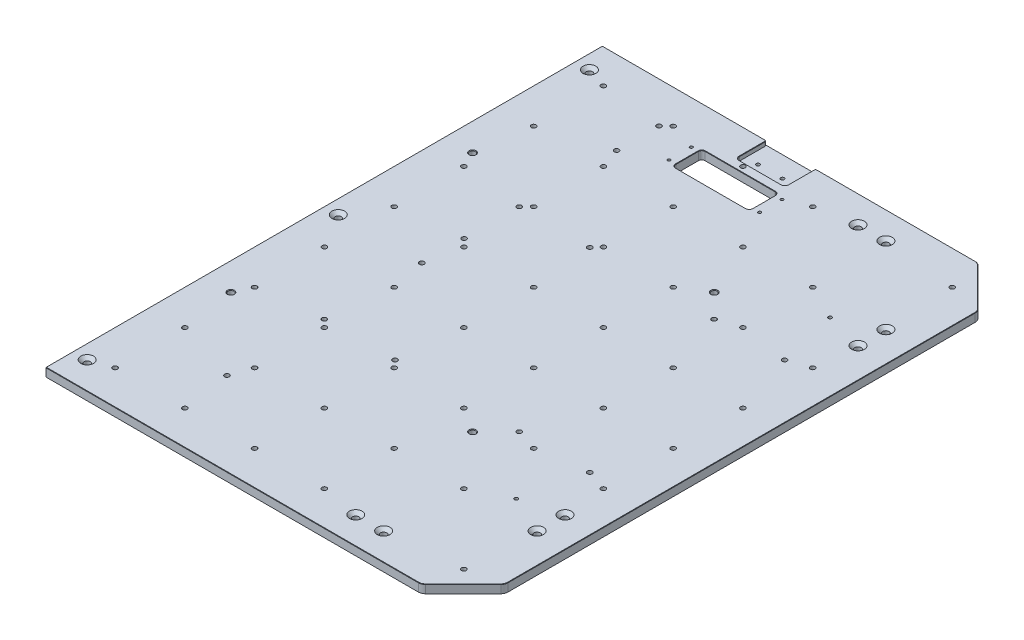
ISO-10303-21;
HEADER;
FILE_DESCRIPTION(('STEP AP214'),'2;1');
FILE_NAME('part.step','',(''),(''),'','','');
FILE_SCHEMA(('AUTOMOTIVE_DESIGN { 1 0 10303 214 1 1 1 1 }'));
ENDSEC;
DATA;
#1=APPLICATION_CONTEXT('core data for automotive mechanical design processes');
#2=APPLICATION_PROTOCOL_DEFINITION('international standard','automotive_design',2000,#1);
#3=PRODUCT_CONTEXT('',#1,'mechanical');
#4=PRODUCT('Part','Part','',(#3));
#5=PRODUCT_RELATED_PRODUCT_CATEGORY('part','',(#4));
#6=PRODUCT_DEFINITION_FORMATION('','',#4);
#7=PRODUCT_DEFINITION_CONTEXT('part definition',#1,'design');
#8=PRODUCT_DEFINITION('design','',#6,#7);
#9=PRODUCT_DEFINITION_SHAPE('','',#8);
#10=(LENGTH_UNIT() NAMED_UNIT(*) SI_UNIT(.MILLI.,.METRE.));
#11=(NAMED_UNIT(*) PLANE_ANGLE_UNIT() SI_UNIT($,.RADIAN.));
#12=(NAMED_UNIT(*) SI_UNIT($,.STERADIAN.) SOLID_ANGLE_UNIT());
#13=UNCERTAINTY_MEASURE_WITH_UNIT(LENGTH_MEASURE(1.E-05),#10,'distance_accuracy_value','');
#14=(GEOMETRIC_REPRESENTATION_CONTEXT(3) GLOBAL_UNCERTAINTY_ASSIGNED_CONTEXT((#13)) GLOBAL_UNIT_ASSIGNED_CONTEXT((#10,
#11,#12)) REPRESENTATION_CONTEXT('',''));
#15=CARTESIAN_POINT('',(0.,0.,0.));
#16=DIRECTION('',(0.,0.,1.));
#17=DIRECTION('',(1.,0.,0.));
#18=AXIS2_PLACEMENT_3D('',#15,#16,#17);
#19=CARTESIAN_POINT('',(0.,0.,0.));
#20=DIRECTION('',(1.,0.,0.));
#21=DIRECTION('',(0.,0.,-1.));
#22=AXIS2_PLACEMENT_3D('',#19,#20,#21);
#23=PLANE('',#22);
#24=DIRECTION('',(0.,0.707106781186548,-0.707106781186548));
#25=VECTOR('',#24,1.);
#26=CARTESIAN_POINT('',(0.,12.,398.5));
#27=LINE('',#26,#25);
#28=CARTESIAN_POINT('',(0.,11.4999999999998,399.));
#29=VERTEX_POINT('',#28);
#30=CARTESIAN_POINT('',(0.,12.,398.5));
#31=VERTEX_POINT('',#30);
#32=EDGE_CURVE('E1131',#29,#31,#27,.T.);
#33=ORIENTED_EDGE('',*,*,#32,.T.);
#34=DIRECTION('',(0.,0.,-1.));
#35=VECTOR('',#34,1.);
#36=CARTESIAN_POINT('',(0.,12.,0.));
#37=LINE('',#36,#35);
#38=CARTESIAN_POINT('',(0.,12.,-398.5));
#39=VERTEX_POINT('',#38);
#40=EDGE_CURVE('E1132',#31,#39,#37,.T.);
#41=ORIENTED_EDGE('',*,*,#40,.T.);
#42=DIRECTION('',(0.,-0.707106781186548,-0.707106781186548));
#43=VECTOR('',#42,1.);
#44=CARTESIAN_POINT('',(0.,12.,-398.5));
#45=LINE('',#44,#43);
#46=CARTESIAN_POINT('',(0.,11.4999999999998,-399.));
#47=VERTEX_POINT('',#46);
#48=EDGE_CURVE('E366',#39,#47,#45,.T.);
#49=ORIENTED_EDGE('',*,*,#48,.T.);
#50=DIRECTION('',(0.,1.,0.));
#51=VECTOR('',#50,1.);
#52=CARTESIAN_POINT('',(0.,12.,-399.));
#53=LINE('',#52,#51);
#54=CARTESIAN_POINT('',(0.,0.,-399.));
#55=VERTEX_POINT('',#54);
#56=EDGE_CURVE('E1135',#55,#47,#53,.T.);
#57=ORIENTED_EDGE('',*,*,#56,.F.);
#58=DIRECTION('',(0.,0.,-1.));
#59=VECTOR('',#58,1.);
#60=CARTESIAN_POINT('',(0.,0.,0.));
#61=LINE('',#60,#59);
#62=CARTESIAN_POINT('',(0.,0.,399.));
#63=VERTEX_POINT('',#62);
#64=EDGE_CURVE('E1060',#63,#55,#61,.T.);
#65=ORIENTED_EDGE('',*,*,#64,.F.);
#66=DIRECTION('',(0.,-1.,0.));
#67=VECTOR('',#66,1.);
#68=CARTESIAN_POINT('',(0.,12.,399.));
#69=LINE('',#68,#67);
#70=EDGE_CURVE('E1137',#29,#63,#69,.T.);
#71=ORIENTED_EDGE('',*,*,#70,.F.);
#72=EDGE_LOOP('',(#33,#41,#49,#57,#65,#71));
#73=FACE_BOUND('',#72,.T.);
#74=ADVANCED_FACE('F37',(#73),#23,.F.);
#75=CARTESIAN_POINT('',(598.,12.,-339.));
#76=DIRECTION('',(-0.707106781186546,0.,0.707106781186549));
#77=DIRECTION('',(0.707106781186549,0.,0.707106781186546));
#78=AXIS2_PLACEMENT_3D('',#75,#76,#77);
#79=PLANE('',#78);
#80=DIRECTION('',(0.,-1.,0.));
#81=VECTOR('',#80,1.);
#82=CARTESIAN_POINT('',(540.928932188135,12.,-396.071067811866));
#83=LINE('',#82,#81);
#84=CARTESIAN_POINT('',(540.928932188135,0.,-396.071067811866));
#85=VERTEX_POINT('',#84);
#86=CARTESIAN_POINT('',(540.928932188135,11.4999999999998,-396.071067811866));
#87=VERTEX_POINT('',#86);
#88=EDGE_CURVE('E936',#85,#87,#83,.F.);
#89=ORIENTED_EDGE('',*,*,#88,.T.);
#90=DIRECTION('',(0.707106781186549,0.,0.707106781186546));
#91=VECTOR('',#90,1.);
#92=CARTESIAN_POINT('',(595.071067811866,11.4999999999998,-341.928932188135));
#93=LINE('',#92,#91);
#94=CARTESIAN_POINT('',(595.071067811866,11.4999999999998,-341.928932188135));
#95=VERTEX_POINT('',#94);
#96=EDGE_CURVE('E1028',#87,#95,#93,.T.);
#97=ORIENTED_EDGE('',*,*,#96,.T.);
#98=DIRECTION('',(0.,-1.,0.));
#99=VECTOR('',#98,1.);
#100=CARTESIAN_POINT('',(595.071067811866,12.,-341.928932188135));
#101=LINE('',#100,#99);
#102=CARTESIAN_POINT('',(595.071067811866,0.,-341.928932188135));
#103=VERTEX_POINT('',#102);
#104=EDGE_CURVE('E939',#95,#103,#101,.T.);
#105=ORIENTED_EDGE('',*,*,#104,.T.);
#106=DIRECTION('',(-0.707106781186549,0.,-0.707106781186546));
#107=VECTOR('',#106,1.);
#108=CARTESIAN_POINT('',(598.,0.,-339.));
#109=LINE('',#108,#107);
#110=EDGE_CURVE('E898',#103,#85,#109,.T.);
#111=ORIENTED_EDGE('',*,*,#110,.T.);
#112=EDGE_LOOP('',(#89,#97,#105,#111));
#113=FACE_BOUND('',#112,.T.);
#114=ADVANCED_FACE('F1316',(#113),#79,.F.);
#115=CARTESIAN_POINT('',(-538.,12.,-399.));
#116=DIRECTION('',(0.,0.,1.));
#117=DIRECTION('',(1.,0.,0.));
#118=AXIS2_PLACEMENT_3D('',#115,#116,#117);
#119=PLANE('',#118);
#120=DIRECTION('',(-1.,0.,0.));
#121=VECTOR('',#120,1.);
#122=CARTESIAN_POINT('',(-538.,0.,-399.));
#123=LINE('',#122,#121);
#124=CARTESIAN_POINT('',(533.857864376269,0.,-399.));
#125=VERTEX_POINT('',#124);
#126=EDGE_CURVE('E901',#125,#55,#123,.T.);
#127=ORIENTED_EDGE('',*,*,#126,.T.);
#128=ORIENTED_EDGE('',*,*,#56,.T.);
#129=DIRECTION('',(1.,0.,0.));
#130=VECTOR('',#129,1.);
#131=CARTESIAN_POINT('',(232.9,11.4999999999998,-399.));
#132=LINE('',#131,#130);
#133=CARTESIAN_POINT('',(232.9,11.4999999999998,-399.));
#134=VERTEX_POINT('',#133);
#135=EDGE_CURVE('E1010',#47,#134,#132,.T.);
#136=ORIENTED_EDGE('',*,*,#135,.T.);
#137=DIRECTION('',(0.,1.,0.));
#138=VECTOR('',#137,1.);
#139=CARTESIAN_POINT('',(232.9,12.,-399.));
#140=LINE('',#139,#138);
#141=CARTESIAN_POINT('',(232.9,6.,-399.));
#142=VERTEX_POINT('',#141);
#143=EDGE_CURVE('E941',#134,#142,#140,.F.);
#144=ORIENTED_EDGE('',*,*,#143,.T.);
#145=DIRECTION('',(-1.,0.,0.));
#146=VECTOR('',#145,1.);
#147=CARTESIAN_POINT('',(305.1,6.,-399.));
#148=LINE('',#147,#146);
#149=CARTESIAN_POINT('',(307.1,6.,-399.));
#150=VERTEX_POINT('',#149);
#151=EDGE_CURVE('E416',#150,#142,#148,.T.);
#152=ORIENTED_EDGE('',*,*,#151,.F.);
#153=DIRECTION('',(0.,1.,0.));
#154=VECTOR('',#153,1.);
#155=CARTESIAN_POINT('',(307.1,12.,-399.));
#156=LINE('',#155,#154);
#157=CARTESIAN_POINT('',(307.1,11.4999999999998,-399.));
#158=VERTEX_POINT('',#157);
#159=EDGE_CURVE('E943',#150,#158,#156,.T.);
#160=ORIENTED_EDGE('',*,*,#159,.T.);
#161=DIRECTION('',(1.,0.,0.));
#162=VECTOR('',#161,1.);
#163=CARTESIAN_POINT('',(533.857864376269,11.4999999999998,-399.));
#164=LINE('',#163,#162);
#165=CARTESIAN_POINT('',(533.857864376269,11.4999999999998,-399.));
#166=VERTEX_POINT('',#165);
#167=EDGE_CURVE('E1008',#158,#166,#164,.T.);
#168=ORIENTED_EDGE('',*,*,#167,.T.);
#169=DIRECTION('',(0.,-1.,0.));
#170=VECTOR('',#169,1.);
#171=CARTESIAN_POINT('',(533.857864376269,12.,-399.));
#172=LINE('',#171,#170);
#173=EDGE_CURVE('E934',#166,#125,#172,.T.);
#174=ORIENTED_EDGE('',*,*,#173,.T.);
#175=EDGE_LOOP('',(#127,#128,#136,#144,#152,#160,#168,#174));
#176=FACE_BOUND('',#175,.T.);
#177=ADVANCED_FACE('F1309',(#176),#119,.F.);
#178=CARTESIAN_POINT('',(-538.,12.,399.));
#179=DIRECTION('',(0.,0.,-1.));
#180=DIRECTION('',(-1.,0.,0.));
#181=AXIS2_PLACEMENT_3D('',#178,#179,#180);
#182=PLANE('',#181);
#183=DIRECTION('',(-1.,0.,0.));
#184=VECTOR('',#183,1.);
#185=CARTESIAN_POINT('',(-533.857864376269,11.4999999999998,399.));
#186=LINE('',#185,#184);
#187=CARTESIAN_POINT('',(533.857864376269,11.4999999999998,399.));
#188=VERTEX_POINT('',#187);
#189=EDGE_CURVE('E1040',#188,#29,#186,.T.);
#190=ORIENTED_EDGE('',*,*,#189,.T.);
#191=ORIENTED_EDGE('',*,*,#70,.T.);
#192=DIRECTION('',(1.,0.,0.));
#193=VECTOR('',#192,1.);
#194=CARTESIAN_POINT('',(-538.,0.,399.));
#195=LINE('',#194,#193);
#196=CARTESIAN_POINT('',(533.857864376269,0.,399.));
#197=VERTEX_POINT('',#196);
#198=EDGE_CURVE('E904',#63,#197,#195,.T.);
#199=ORIENTED_EDGE('',*,*,#198,.T.);
#200=DIRECTION('',(0.,-1.,0.));
#201=VECTOR('',#200,1.);
#202=CARTESIAN_POINT('',(533.857864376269,12.,399.));
#203=LINE('',#202,#201);
#204=EDGE_CURVE('E931',#197,#188,#203,.F.);
#205=ORIENTED_EDGE('',*,*,#204,.T.);
#206=EDGE_LOOP('',(#190,#191,#199,#205));
#207=FACE_BOUND('',#206,.T.);
#208=ADVANCED_FACE('F1303',(#207),#182,.F.);
#209=CARTESIAN_POINT('',(538.,12.,399.));
#210=DIRECTION('',(-0.707106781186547,0.,-0.707106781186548));
#211=DIRECTION('',(-0.707106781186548,0.,0.707106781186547));
#212=AXIS2_PLACEMENT_3D('',#209,#210,#211);
#213=PLANE('',#212);
#214=DIRECTION('',(0.,-1.,0.));
#215=VECTOR('',#214,1.);
#216=CARTESIAN_POINT('',(595.071067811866,12.,341.928932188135));
#217=LINE('',#216,#215);
#218=CARTESIAN_POINT('',(595.071067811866,0.,341.928932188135));
#219=VERTEX_POINT('',#218);
#220=CARTESIAN_POINT('',(595.071067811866,11.4999999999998,341.928932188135));
#221=VERTEX_POINT('',#220);
#222=EDGE_CURVE('E928',#219,#221,#217,.F.);
#223=ORIENTED_EDGE('',*,*,#222,.T.);
#224=DIRECTION('',(-0.707106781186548,0.,0.707106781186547));
#225=VECTOR('',#224,1.);
#226=CARTESIAN_POINT('',(540.928932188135,11.4999999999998,396.071067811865));
#227=LINE('',#226,#225);
#228=CARTESIAN_POINT('',(540.928932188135,11.4999999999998,396.071067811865));
#229=VERTEX_POINT('',#228);
#230=EDGE_CURVE('E1036',#221,#229,#227,.T.);
#231=ORIENTED_EDGE('',*,*,#230,.T.);
#232=DIRECTION('',(0.,-1.,0.));
#233=VECTOR('',#232,1.);
#234=CARTESIAN_POINT('',(540.928932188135,12.,396.071067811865));
#235=LINE('',#234,#233);
#236=CARTESIAN_POINT('',(540.928932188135,0.,396.071067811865));
#237=VERTEX_POINT('',#236);
#238=EDGE_CURVE('E926',#229,#237,#235,.T.);
#239=ORIENTED_EDGE('',*,*,#238,.T.);
#240=DIRECTION('',(0.707106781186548,0.,-0.707106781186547));
#241=VECTOR('',#240,1.);
#242=CARTESIAN_POINT('',(538.,0.,399.));
#243=LINE('',#242,#241);
#244=EDGE_CURVE('E906',#237,#219,#243,.T.);
#245=ORIENTED_EDGE('',*,*,#244,.T.);
#246=EDGE_LOOP('',(#223,#231,#239,#245));
#247=FACE_BOUND('',#246,.T.);
#248=ADVANCED_FACE('F1372',(#247),#213,.F.);
#249=CARTESIAN_POINT('',(598.,12.,339.));
#250=DIRECTION('',(-1.,0.,0.));
#251=DIRECTION('',(0.,0.,1.));
#252=AXIS2_PLACEMENT_3D('',#249,#250,#251);
#253=PLANE('',#252);
#254=DIRECTION('',(0.,-1.,0.));
#255=VECTOR('',#254,1.);
#256=CARTESIAN_POINT('',(598.,12.,-334.857864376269));
#257=LINE('',#256,#255);
#258=CARTESIAN_POINT('',(598.,0.,-334.857864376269));
#259=VERTEX_POINT('',#258);
#260=CARTESIAN_POINT('',(598.,11.4999999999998,-334.857864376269));
#261=VERTEX_POINT('',#260);
#262=EDGE_CURVE('E912',#259,#261,#257,.F.);
#263=ORIENTED_EDGE('',*,*,#262,.T.);
#264=DIRECTION('',(0.,0.,1.));
#265=VECTOR('',#264,1.);
#266=CARTESIAN_POINT('',(598.,11.4999999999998,334.857864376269));
#267=LINE('',#266,#265);
#268=CARTESIAN_POINT('',(598.,11.4999999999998,334.857864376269));
#269=VERTEX_POINT('',#268);
#270=EDGE_CURVE('E1032',#261,#269,#267,.T.);
#271=ORIENTED_EDGE('',*,*,#270,.T.);
#272=DIRECTION('',(0.,-1.,0.));
#273=VECTOR('',#272,1.);
#274=CARTESIAN_POINT('',(598.,12.,334.857864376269));
#275=LINE('',#274,#273);
#276=CARTESIAN_POINT('',(598.,0.,334.857864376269));
#277=VERTEX_POINT('',#276);
#278=EDGE_CURVE('E915',#269,#277,#275,.T.);
#279=ORIENTED_EDGE('',*,*,#278,.T.);
#280=DIRECTION('',(0.,0.,-1.));
#281=VECTOR('',#280,1.);
#282=CARTESIAN_POINT('',(598.,0.,339.));
#283=LINE('',#282,#281);
#284=EDGE_CURVE('E909',#277,#259,#283,.T.);
#285=ORIENTED_EDGE('',*,*,#284,.T.);
#286=EDGE_LOOP('',(#263,#271,#279,#285));
#287=FACE_BOUND('',#286,.T.);
#288=ADVANCED_FACE('F1355',(#287),#253,.F.);
#289=CARTESIAN_POINT('',(0.,12.,0.));
#290=DIRECTION('',(0.,1.,0.));
#291=DIRECTION('',(0.,0.,1.));
#292=AXIS2_PLACEMENT_3D('',#289,#290,#291);
#293=PLANE('',#292);
#294=CARTESIAN_POINT('',(39.2588386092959,12.,173.241161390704));
#295=DIRECTION('',(0.,1.,0.));
#296=DIRECTION('',(0.,0.,1.));
#297=AXIS2_PLACEMENT_3D('',#294,#295,#296);
#298=CIRCLE('',#297,5.025);
#299=CARTESIAN_POINT('',(39.2588386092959,12.,178.266161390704));
#300=VERTEX_POINT('',#299);
#301=EDGE_CURVE('E3140',#300,#300,#298,.T.);
#302=ORIENTED_EDGE('',*,*,#301,.F.);
#303=EDGE_LOOP('',(#302));
#304=FACE_BOUND('',#303,.T.);
#305=CARTESIAN_POINT('',(39.2588386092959,12.,-173.241161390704));
#306=DIRECTION('',(0.,1.,0.));
#307=DIRECTION('',(0.,0.,1.));
#308=AXIS2_PLACEMENT_3D('',#305,#306,#307);
#309=CIRCLE('',#308,5.025);
#310=CARTESIAN_POINT('',(39.2588386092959,12.,-168.216161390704));
#311=VERTEX_POINT('',#310);
#312=EDGE_CURVE('E3147',#311,#311,#309,.T.);
#313=ORIENTED_EDGE('',*,*,#312,.F.);
#314=EDGE_LOOP('',(#313));
#315=FACE_BOUND('',#314,.T.);
#316=CARTESIAN_POINT('',(385.741161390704,12.,-173.241161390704));
#317=DIRECTION('',(0.,1.,0.));
#318=DIRECTION('',(0.,0.,1.));
#319=AXIS2_PLACEMENT_3D('',#316,#317,#318);
#320=CIRCLE('',#319,5.025);
#321=CARTESIAN_POINT('',(385.741161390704,12.,-168.216161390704));
#322=VERTEX_POINT('',#321);
#323=EDGE_CURVE('E3156',#322,#322,#320,.T.);
#324=ORIENTED_EDGE('',*,*,#323,.F.);
#325=EDGE_LOOP('',(#324));
#326=FACE_BOUND('',#325,.T.);
#327=CARTESIAN_POINT('',(385.741161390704,12.,173.241161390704));
#328=DIRECTION('',(0.,1.,0.));
#329=DIRECTION('',(0.,0.,1.));
#330=AXIS2_PLACEMENT_3D('',#327,#328,#329);
#331=CIRCLE('',#330,5.025);
#332=CARTESIAN_POINT('',(385.741161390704,12.,178.266161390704));
#333=VERTEX_POINT('',#332);
#334=EDGE_CURVE('E3165',#333,#333,#331,.T.);
#335=ORIENTED_EDGE('',*,*,#334,.F.);
#336=EDGE_LOOP('',(#335));
#337=FACE_BOUND('',#336,.T.);
#338=CARTESIAN_POINT('',(139.653589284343,12.,-60.6928214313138));
#339=DIRECTION('',(0.,1.,0.));
#340=DIRECTION('',(0.,0.,1.));
#341=AXIS2_PLACEMENT_3D('',#338,#339,#340);
#342=CIRCLE('',#341,3.39999999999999);
#343=CARTESIAN_POINT('',(139.653589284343,12.,-57.2928214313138));
#344=VERTEX_POINT('',#343);
#345=EDGE_CURVE('E3174',#344,#344,#342,.T.);
#346=ORIENTED_EDGE('',*,*,#345,.F.);
#347=EDGE_LOOP('',(#346));
#348=FACE_BOUND('',#347,.T.);
#349=CARTESIAN_POINT('',(139.653589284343,12.,-340.));
#350=DIRECTION('',(0.,1.,0.));
#351=DIRECTION('',(0.,0.,1.));
#352=AXIS2_PLACEMENT_3D('',#349,#350,#351);
#353=CIRCLE('',#352,3.39999999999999);
#354=CARTESIAN_POINT('',(139.653589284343,12.,-336.6));
#355=VERTEX_POINT('',#354);
#356=EDGE_CURVE('E3180',#355,#355,#353,.T.);
#357=ORIENTED_EDGE('',*,*,#356,.F.);
#358=EDGE_LOOP('',(#357));
#359=FACE_BOUND('',#358,.T.);
#360=CARTESIAN_POINT('',(139.653589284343,12.,-0.00282143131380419));
#361=DIRECTION('',(0.,1.,0.));
#362=DIRECTION('',(0.,0.,1.));
#363=AXIS2_PLACEMENT_3D('',#360,#361,#362);
#364=CIRCLE('',#363,3.39999999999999);
#365=CARTESIAN_POINT('',(143.053588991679,12.,-0.00141071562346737));
#366=VERTEX_POINT('',#365);
#367=CARTESIAN_POINT('',(136.253589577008,12.,-0.00141071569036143));
#368=VERTEX_POINT('',#367);
#369=EDGE_CURVE('E332',#366,#368,#364,.T.);
#370=ORIENTED_EDGE('',*,*,#369,.F.);
#371=CARTESIAN_POINT('',(139.653589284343,12.,0.));
#372=DIRECTION('',(0.,1.,0.));
#373=DIRECTION('',(0.,0.,1.));
#374=AXIS2_PLACEMENT_3D('',#371,#372,#373);
#375=CIRCLE('',#374,3.39999999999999);
#376=EDGE_CURVE('E339',#368,#366,#375,.T.);
#377=ORIENTED_EDGE('',*,*,#376,.F.);
#378=EDGE_LOOP('',(#370,#377));
#379=FACE_BOUND('',#378,.T.);
#380=CARTESIAN_POINT('',(139.653589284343,12.,-279.31));
#381=DIRECTION('',(0.,1.,0.));
#382=DIRECTION('',(0.,0.,1.));
#383=AXIS2_PLACEMENT_3D('',#380,#381,#382);
#384=CIRCLE('',#383,3.39999999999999);
#385=CARTESIAN_POINT('',(139.653589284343,12.,-275.91));
#386=VERTEX_POINT('',#385);
#387=EDGE_CURVE('E331',#386,#386,#384,.T.);
#388=ORIENTED_EDGE('',*,*,#387,.F.);
#389=EDGE_LOOP('',(#388));
#390=FACE_BOUND('',#389,.T.);
#391=CARTESIAN_POINT('',(139.653589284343,12.,279.307178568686));
#392=DIRECTION('',(0.,1.,0.));
#393=DIRECTION('',(0.,0.,1.));
#394=AXIS2_PLACEMENT_3D('',#391,#392,#393);
#395=CIRCLE('',#394,3.39999999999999);
#396=CARTESIAN_POINT('',(139.653589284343,12.,282.707178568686));
#397=VERTEX_POINT('',#396);
#398=EDGE_CURVE('E3192',#397,#397,#395,.T.);
#399=ORIENTED_EDGE('',*,*,#398,.F.);
#400=EDGE_LOOP('',(#399));
#401=FACE_BOUND('',#400,.T.);
#402=CARTESIAN_POINT('',(418.963589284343,12.,139.653589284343));
#403=DIRECTION('',(0.,1.,0.));
#404=DIRECTION('',(0.,0.,1.));
#405=AXIS2_PLACEMENT_3D('',#402,#403,#404);
#406=CIRCLE('',#405,3.40000000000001);
#407=CARTESIAN_POINT('',(418.963589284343,12.,143.053589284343));
#408=VERTEX_POINT('',#407);
#409=EDGE_CURVE('E343',#408,#408,#406,.T.);
#410=ORIENTED_EDGE('',*,*,#409,.F.);
#411=EDGE_LOOP('',(#410));
#412=FACE_BOUND('',#411,.T.);
#413=CARTESIAN_POINT('',(139.656410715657,12.,-139.653589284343));
#414=DIRECTION('',(0.,1.,0.));
#415=DIRECTION('',(0.,0.,1.));
#416=AXIS2_PLACEMENT_3D('',#413,#414,#415);
#417=CIRCLE('',#416,3.39999999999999);
#418=CARTESIAN_POINT('',(139.655,12.,-136.253589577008));
#419=VERTEX_POINT('',#418);
#420=CARTESIAN_POINT('',(139.655,12.,-143.053588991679));
#421=VERTEX_POINT('',#420);
#422=EDGE_CURVE('E340',#419,#421,#417,.T.);
#423=ORIENTED_EDGE('',*,*,#422,.F.);
#424=CARTESIAN_POINT('',(139.653589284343,12.,-139.653589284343));
#425=DIRECTION('',(0.,1.,0.));
#426=DIRECTION('',(0.,0.,1.));
#427=AXIS2_PLACEMENT_3D('',#424,#425,#426);
#428=CIRCLE('',#427,3.39999999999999);
#429=EDGE_CURVE('E378',#421,#419,#428,.T.);
#430=ORIENTED_EDGE('',*,*,#429,.F.);
#431=EDGE_LOOP('',(#423,#430));
#432=FACE_BOUND('',#431,.T.);
#433=CARTESIAN_POINT('',(139.656410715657,12.,139.653589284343));
#434=DIRECTION('',(0.,1.,0.));
#435=DIRECTION('',(0.,0.,1.));
#436=AXIS2_PLACEMENT_3D('',#433,#434,#435);
#437=CIRCLE('',#436,3.39999999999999);
#438=CARTESIAN_POINT('',(139.655000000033,12.,143.053588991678));
#439=VERTEX_POINT('',#438);
#440=CARTESIAN_POINT('',(139.654999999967,12.,136.253589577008));
#441=VERTEX_POINT('',#440);
#442=EDGE_CURVE('E360',#439,#441,#437,.T.);
#443=ORIENTED_EDGE('',*,*,#442,.F.);
#444=CARTESIAN_POINT('',(139.653589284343,12.,139.653589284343));
#445=DIRECTION('',(0.,1.,0.));
#446=DIRECTION('',(0.,0.,1.));
#447=AXIS2_PLACEMENT_3D('',#444,#445,#446);
#448=CIRCLE('',#447,3.39999999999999);
#449=EDGE_CURVE('E372',#441,#439,#448,.T.);
#450=ORIENTED_EDGE('',*,*,#449,.F.);
#451=EDGE_LOOP('',(#443,#450));
#452=FACE_BOUND('',#451,.T.);
#453=CARTESIAN_POINT('',(418.963589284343,12.,-139.653589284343));
#454=DIRECTION('',(0.,1.,0.));
#455=DIRECTION('',(0.,0.,1.));
#456=AXIS2_PLACEMENT_3D('',#453,#454,#455);
#457=CIRCLE('',#456,3.40000000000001);
#458=CARTESIAN_POINT('',(418.963589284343,12.,-136.253589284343));
#459=VERTEX_POINT('',#458);
#460=EDGE_CURVE('E354',#459,#459,#457,.T.);
#461=ORIENTED_EDGE('',*,*,#460,.F.);
#462=EDGE_LOOP('',(#461));
#463=FACE_BOUND('',#462,.T.);
#464=ORIENTED_EDGE('',*,*,#40,.F.);
#465=DIRECTION('',(1.,0.,0.));
#466=VECTOR('',#465,1.);
#467=CARTESIAN_POINT('',(533.857864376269,12.,398.5));
#468=LINE('',#467,#466);
#469=CARTESIAN_POINT('',(533.857864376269,12.,398.5));
#470=VERTEX_POINT('',#469);
#471=EDGE_CURVE('E973',#31,#470,#468,.T.);
#472=ORIENTED_EDGE('',*,*,#471,.T.);
#473=CARTESIAN_POINT('',(533.857864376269,12.,389.));
#474=DIRECTION('',(0.,1.,0.));
#475=DIRECTION('',(0.,0.,1.));
#476=AXIS2_PLACEMENT_3D('',#473,#474,#475);
#477=CIRCLE('',#476,9.49999999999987);
#478=CARTESIAN_POINT('',(540.575378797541,12.,395.717514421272));
#479=VERTEX_POINT('',#478);
#480=EDGE_CURVE('E975',#470,#479,#477,.T.);
#481=ORIENTED_EDGE('',*,*,#480,.T.);
#482=DIRECTION('',(0.707106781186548,0.,-0.707106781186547));
#483=VECTOR('',#482,1.);
#484=CARTESIAN_POINT('',(594.717514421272,12.,341.575378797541));
#485=LINE('',#484,#483);
#486=CARTESIAN_POINT('',(594.717514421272,12.,341.575378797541));
#487=VERTEX_POINT('',#486);
#488=EDGE_CURVE('E977',#479,#487,#485,.T.);
#489=ORIENTED_EDGE('',*,*,#488,.T.);
#490=CARTESIAN_POINT('',(588.,12.,334.857864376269));
#491=DIRECTION('',(0.,1.,0.));
#492=DIRECTION('',(0.,0.,1.));
#493=AXIS2_PLACEMENT_3D('',#490,#491,#492);
#494=CIRCLE('',#493,9.49999999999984);
#495=CARTESIAN_POINT('',(597.5,12.,334.857864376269));
#496=VERTEX_POINT('',#495);
#497=EDGE_CURVE('E979',#487,#496,#494,.T.);
#498=ORIENTED_EDGE('',*,*,#497,.T.);
#499=DIRECTION('',(0.,0.,-1.));
#500=VECTOR('',#499,1.);
#501=CARTESIAN_POINT('',(597.5,12.,-334.857864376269));
#502=LINE('',#501,#500);
#503=CARTESIAN_POINT('',(597.5,12.,-334.857864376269));
#504=VERTEX_POINT('',#503);
#505=EDGE_CURVE('E981',#496,#504,#502,.T.);
#506=ORIENTED_EDGE('',*,*,#505,.T.);
#507=CARTESIAN_POINT('',(588.,12.,-334.857864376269));
#508=DIRECTION('',(0.,1.,0.));
#509=DIRECTION('',(0.,0.,1.));
#510=AXIS2_PLACEMENT_3D('',#507,#508,#509);
#511=CIRCLE('',#510,9.49999999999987);
#512=CARTESIAN_POINT('',(594.717514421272,12.,-341.575378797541));
#513=VERTEX_POINT('',#512);
#514=EDGE_CURVE('E983',#504,#513,#511,.T.);
#515=ORIENTED_EDGE('',*,*,#514,.T.);
#516=DIRECTION('',(-0.707106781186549,0.,-0.707106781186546));
#517=VECTOR('',#516,1.);
#518=CARTESIAN_POINT('',(540.575378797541,12.,-395.717514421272));
#519=LINE('',#518,#517);
#520=CARTESIAN_POINT('',(540.575378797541,12.,-395.717514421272));
#521=VERTEX_POINT('',#520);
#522=EDGE_CURVE('E985',#513,#521,#519,.T.);
#523=ORIENTED_EDGE('',*,*,#522,.T.);
#524=CARTESIAN_POINT('',(533.857864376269,12.,-389.));
#525=DIRECTION('',(0.,1.,0.));
#526=DIRECTION('',(0.,0.,1.));
#527=AXIS2_PLACEMENT_3D('',#524,#525,#526);
#528=CIRCLE('',#527,9.49999999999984);
#529=CARTESIAN_POINT('',(533.857864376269,12.,-398.5));
#530=VERTEX_POINT('',#529);
#531=EDGE_CURVE('E987',#521,#530,#528,.T.);
#532=ORIENTED_EDGE('',*,*,#531,.T.);
#533=DIRECTION('',(-1.,0.,0.));
#534=VECTOR('',#533,1.);
#535=CARTESIAN_POINT('',(307.1,12.,-398.5));
#536=LINE('',#535,#534);
#537=CARTESIAN_POINT('',(307.1,12.,-398.5));
#538=VERTEX_POINT('',#537);
#539=EDGE_CURVE('E989',#530,#538,#536,.T.);
#540=ORIENTED_EDGE('',*,*,#539,.T.);
#541=CARTESIAN_POINT('',(307.1,12.,-397.));
#542=DIRECTION('',(0.,1.,0.));
#543=DIRECTION('',(0.,0.,1.));
#544=AXIS2_PLACEMENT_3D('',#541,#542,#543);
#545=CIRCLE('',#544,1.49999999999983);
#546=CARTESIAN_POINT('',(305.6,12.,-397.));
#547=VERTEX_POINT('',#546);
#548=EDGE_CURVE('E991',#538,#547,#545,.T.);
#549=ORIENTED_EDGE('',*,*,#548,.T.);
#550=DIRECTION('',(0.,0.,1.));
#551=VECTOR('',#550,1.);
#552=CARTESIAN_POINT('',(305.6,12.,-360.));
#553=LINE('',#552,#551);
#554=CARTESIAN_POINT('',(305.6,12.,-360.));
#555=VERTEX_POINT('',#554);
#556=EDGE_CURVE('E993',#547,#555,#553,.T.);
#557=ORIENTED_EDGE('',*,*,#556,.T.);
#558=CARTESIAN_POINT('',(300.1,12.,-360.));
#559=DIRECTION('',(0.,1.,0.));
#560=DIRECTION('',(0.,0.,1.));
#561=AXIS2_PLACEMENT_3D('',#558,#559,#560);
#562=CIRCLE('',#561,5.50000000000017);
#563=CARTESIAN_POINT('',(300.1,12.,-354.5));
#564=VERTEX_POINT('',#563);
#565=EDGE_CURVE('E995',#555,#564,#562,.F.);
#566=ORIENTED_EDGE('',*,*,#565,.T.);
#567=DIRECTION('',(-1.,0.,0.));
#568=VECTOR('',#567,1.);
#569=CARTESIAN_POINT('',(239.9,12.,-354.5));
#570=LINE('',#569,#568);
#571=CARTESIAN_POINT('',(239.9,12.,-354.5));
#572=VERTEX_POINT('',#571);
#573=EDGE_CURVE('E997',#564,#572,#570,.T.);
#574=ORIENTED_EDGE('',*,*,#573,.T.);
#575=CARTESIAN_POINT('',(239.9,12.,-360.));
#576=DIRECTION('',(0.,1.,0.));
#577=DIRECTION('',(0.,0.,1.));
#578=AXIS2_PLACEMENT_3D('',#575,#576,#577);
#579=CIRCLE('',#578,5.50000000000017);
#580=CARTESIAN_POINT('',(234.4,12.,-360.));
#581=VERTEX_POINT('',#580);
#582=EDGE_CURVE('E999',#572,#581,#579,.F.);
#583=ORIENTED_EDGE('',*,*,#582,.T.);
#584=DIRECTION('',(0.,0.,-1.));
#585=VECTOR('',#584,1.);
#586=CARTESIAN_POINT('',(234.4,12.,-397.));
#587=LINE('',#586,#585);
#588=CARTESIAN_POINT('',(234.4,12.,-397.));
#589=VERTEX_POINT('',#588);
#590=EDGE_CURVE('E1001',#581,#589,#587,.T.);
#591=ORIENTED_EDGE('',*,*,#590,.T.);
#592=CARTESIAN_POINT('',(232.9,12.,-397.));
#593=DIRECTION('',(0.,1.,0.));
#594=DIRECTION('',(0.,0.,1.));
#595=AXIS2_PLACEMENT_3D('',#592,#593,#594);
#596=CIRCLE('',#595,1.49999999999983);
#597=CARTESIAN_POINT('',(232.9,12.,-398.5));
#598=VERTEX_POINT('',#597);
#599=EDGE_CURVE('E1003',#589,#598,#596,.T.);
#600=ORIENTED_EDGE('',*,*,#599,.T.);
#601=DIRECTION('',(-1.,0.,0.));
#602=VECTOR('',#601,1.);
#603=CARTESIAN_POINT('',(-232.9,12.,-398.5));
#604=LINE('',#603,#602);
#605=EDGE_CURVE('E1005',#598,#39,#604,.T.);
#606=ORIENTED_EDGE('',*,*,#605,.T.);
#607=EDGE_LOOP('',(#464,#472,#481,#489,#498,#506,#515,#523,#532,#540,#549,#557,#566,#574,#583,
#591,#600,#606));
#608=FACE_BOUND('',#607,.T.);
#609=CARTESIAN_POINT('',(304.,12.,-305.));
#610=DIRECTION('',(0.,1.,0.));
#611=DIRECTION('',(0.,0.,1.));
#612=AXIS2_PLACEMENT_3D('',#609,#610,#611);
#613=CIRCLE('',#612,5.49999999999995);
#614=CARTESIAN_POINT('',(309.5,12.,-305.));
#615=VERTEX_POINT('',#614);
#616=CARTESIAN_POINT('',(304.,12.,-299.5));
#617=VERTEX_POINT('',#616);
#618=EDGE_CURVE('E968',#615,#617,#613,.F.);
#619=ORIENTED_EDGE('',*,*,#618,.T.);
#620=DIRECTION('',(-1.,0.,0.));
#621=VECTOR('',#620,1.);
#622=CARTESIAN_POINT('',(204.,12.,-299.5));
#623=LINE('',#622,#621);
#624=CARTESIAN_POINT('',(204.,12.,-299.5));
#625=VERTEX_POINT('',#624);
#626=EDGE_CURVE('E970',#617,#625,#623,.T.);
#627=ORIENTED_EDGE('',*,*,#626,.T.);
#628=CARTESIAN_POINT('',(204.,12.,-305.));
#629=DIRECTION('',(0.,1.,0.));
#630=DIRECTION('',(0.,0.,1.));
#631=AXIS2_PLACEMENT_3D('',#628,#629,#630);
#632=CIRCLE('',#631,5.49999999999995);
#633=CARTESIAN_POINT('',(198.5,12.,-305.));
#634=VERTEX_POINT('',#633);
#635=EDGE_CURVE('E966',#625,#634,#632,.F.);
#636=ORIENTED_EDGE('',*,*,#635,.T.);
#637=DIRECTION('',(0.,0.,-1.));
#638=VECTOR('',#637,1.);
#639=CARTESIAN_POINT('',(198.5,12.,-337.));
#640=LINE('',#639,#638);
#641=CARTESIAN_POINT('',(198.5,12.,-337.));
#642=VERTEX_POINT('',#641);
#643=EDGE_CURVE('E962',#634,#642,#640,.T.);
#644=ORIENTED_EDGE('',*,*,#643,.T.);
#645=CARTESIAN_POINT('',(204.,12.,-337.));
#646=DIRECTION('',(0.,1.,0.));
#647=DIRECTION('',(0.,0.,1.));
#648=AXIS2_PLACEMENT_3D('',#645,#646,#647);
#649=CIRCLE('',#648,5.49999999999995);
#650=CARTESIAN_POINT('',(204.,12.,-342.5));
#651=VERTEX_POINT('',#650);
#652=EDGE_CURVE('E958',#642,#651,#649,.F.);
#653=ORIENTED_EDGE('',*,*,#652,.T.);
#654=DIRECTION('',(1.,0.,0.));
#655=VECTOR('',#654,1.);
#656=CARTESIAN_POINT('',(304.,12.,-342.5));
#657=LINE('',#656,#655);
#658=CARTESIAN_POINT('',(304.,12.,-342.5));
#659=VERTEX_POINT('',#658);
#660=EDGE_CURVE('E956',#651,#659,#657,.T.);
#661=ORIENTED_EDGE('',*,*,#660,.T.);
#662=CARTESIAN_POINT('',(304.,12.,-337.));
#663=DIRECTION('',(0.,1.,0.));
#664=DIRECTION('',(0.,0.,1.));
#665=AXIS2_PLACEMENT_3D('',#662,#663,#664);
#666=CIRCLE('',#665,5.49999999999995);
#667=CARTESIAN_POINT('',(309.5,12.,-337.));
#668=VERTEX_POINT('',#667);
#669=EDGE_CURVE('E960',#659,#668,#666,.F.);
#670=ORIENTED_EDGE('',*,*,#669,.T.);
#671=DIRECTION('',(0.,0.,1.));
#672=VECTOR('',#671,1.);
#673=CARTESIAN_POINT('',(309.5,12.,-305.));
#674=LINE('',#673,#672);
#675=EDGE_CURVE('E964',#668,#615,#674,.T.);
#676=ORIENTED_EDGE('',*,*,#675,.T.);
#677=EDGE_LOOP('',(#619,#627,#636,#644,#653,#661,#670,#676));
#678=FACE_BOUND('',#677,.T.);
#679=CARTESIAN_POINT('',(500.,12.,-225.));
#680=DIRECTION('',(0.,1.,0.));
#681=DIRECTION('',(0.,0.,1.));
#682=AXIS2_PLACEMENT_3D('',#679,#680,#681);
#683=CIRCLE('',#682,2.5);
#684=CARTESIAN_POINT('',(500.,12.,-222.5));
#685=VERTEX_POINT('',#684);
#686=EDGE_CURVE('E385',#685,#685,#683,.T.);
#687=ORIENTED_EDGE('',*,*,#686,.F.);
#688=EDGE_LOOP('',(#687));
#689=FACE_BOUND('',#688,.T.);
#690=CARTESIAN_POINT('',(500.,12.,225.));
#691=DIRECTION('',(0.,1.,0.));
#692=DIRECTION('',(0.,0.,1.));
#693=AXIS2_PLACEMENT_3D('',#690,#691,#692);
#694=CIRCLE('',#693,2.5);
#695=CARTESIAN_POINT('',(500.,12.,227.5));
#696=VERTEX_POINT('',#695);
#697=EDGE_CURVE('E392',#696,#696,#694,.T.);
#698=ORIENTED_EDGE('',*,*,#697,.F.);
#699=EDGE_LOOP('',(#698));
#700=FACE_BOUND('',#699,.T.);
#701=CARTESIAN_POINT('',(189.,12.,-337.));
#702=DIRECTION('',(0.,1.,0.));
#703=DIRECTION('',(0.,0.,1.));
#704=AXIS2_PLACEMENT_3D('',#701,#702,#703);
#705=CIRCLE('',#704,2.09999999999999);
#706=CARTESIAN_POINT('',(189.,12.,-334.9));
#707=VERTEX_POINT('',#706);
#708=EDGE_CURVE('E431',#707,#707,#705,.T.);
#709=ORIENTED_EDGE('',*,*,#708,.F.);
#710=EDGE_LOOP('',(#709));
#711=FACE_BOUND('',#710,.T.);
#712=CARTESIAN_POINT('',(189.,12.,-305.));
#713=DIRECTION('',(0.,1.,0.));
#714=DIRECTION('',(0.,0.,1.));
#715=AXIS2_PLACEMENT_3D('',#712,#713,#714);
#716=CIRCLE('',#715,2.09999999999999);
#717=CARTESIAN_POINT('',(189.,12.,-302.9));
#718=VERTEX_POINT('',#717);
#719=EDGE_CURVE('E445',#718,#718,#716,.T.);
#720=ORIENTED_EDGE('',*,*,#719,.F.);
#721=EDGE_LOOP('',(#720));
#722=FACE_BOUND('',#721,.T.);
#723=CARTESIAN_POINT('',(319.,12.,-305.));
#724=DIRECTION('',(0.,1.,0.));
#725=DIRECTION('',(0.,0.,1.));
#726=AXIS2_PLACEMENT_3D('',#723,#724,#725);
#727=CIRCLE('',#726,2.09999999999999);
#728=CARTESIAN_POINT('',(319.,12.,-302.9));
#729=VERTEX_POINT('',#728);
#730=EDGE_CURVE('E451',#729,#729,#727,.T.);
#731=ORIENTED_EDGE('',*,*,#730,.F.);
#732=EDGE_LOOP('',(#731));
#733=FACE_BOUND('',#732,.T.);
#734=CARTESIAN_POINT('',(319.,12.,-337.));
#735=DIRECTION('',(0.,1.,0.));
#736=DIRECTION('',(0.,0.,1.));
#737=AXIS2_PLACEMENT_3D('',#734,#735,#736);
#738=CIRCLE('',#737,2.09999999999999);
#739=CARTESIAN_POINT('',(319.,12.,-334.9));
#740=VERTEX_POINT('',#739);
#741=EDGE_CURVE('E457',#740,#740,#738,.T.);
#742=ORIENTED_EDGE('',*,*,#741,.F.);
#743=EDGE_LOOP('',(#742));
#744=FACE_BOUND('',#743,.T.);
#745=CARTESIAN_POINT('',(445.,12.,360.));
#746=DIRECTION('',(0.,1.,0.));
#747=DIRECTION('',(0.,0.,1.));
#748=AXIS2_PLACEMENT_3D('',#745,#746,#747);
#749=CIRCLE('',#748,9.12499999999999);
#750=CARTESIAN_POINT('',(445.,12.,369.125));
#751=VERTEX_POINT('',#750);
#752=EDGE_CURVE('E491',#751,#751,#749,.T.);
#753=ORIENTED_EDGE('',*,*,#752,.F.);
#754=EDGE_LOOP('',(#753));
#755=FACE_BOUND('',#754,.T.);
#756=CARTESIAN_POINT('',(445.,12.,-360.));
#757=DIRECTION('',(0.,1.,0.));
#758=DIRECTION('',(0.,0.,1.));
#759=AXIS2_PLACEMENT_3D('',#756,#757,#758);
#760=CIRCLE('',#759,9.12499999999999);
#761=CARTESIAN_POINT('',(445.,12.,-350.875));
#762=VERTEX_POINT('',#761);
#763=EDGE_CURVE('E520',#762,#762,#760,.T.);
#764=ORIENTED_EDGE('',*,*,#763,.F.);
#765=EDGE_LOOP('',(#764));
#766=FACE_BOUND('',#765,.T.);
#767=CARTESIAN_POINT('',(555.,12.,-210.));
#768=DIRECTION('',(0.,1.,0.));
#769=DIRECTION('',(0.,0.,1.));
#770=AXIS2_PLACEMENT_3D('',#767,#768,#769);
#771=CIRCLE('',#770,9.12500000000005);
#772=CARTESIAN_POINT('',(555.,12.,-200.875));
#773=VERTEX_POINT('',#772);
#774=EDGE_CURVE('E529',#773,#773,#771,.T.);
#775=ORIENTED_EDGE('',*,*,#774,.F.);
#776=EDGE_LOOP('',(#775));
#777=FACE_BOUND('',#776,.T.);
#778=CARTESIAN_POINT('',(555.,12.,210.));
#779=DIRECTION('',(0.,1.,0.));
#780=DIRECTION('',(0.,0.,1.));
#781=AXIS2_PLACEMENT_3D('',#778,#779,#780);
#782=CIRCLE('',#781,9.12500000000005);
#783=CARTESIAN_POINT('',(555.,12.,219.125));
#784=VERTEX_POINT('',#783);
#785=EDGE_CURVE('E538',#784,#784,#782,.T.);
#786=ORIENTED_EDGE('',*,*,#785,.F.);
#787=EDGE_LOOP('',(#786));
#788=FACE_BOUND('',#787,.T.);
#789=CARTESIAN_POINT('',(20.,12.,-360.));
#790=DIRECTION('',(0.,1.,0.));
#791=DIRECTION('',(0.,0.,1.));
#792=AXIS2_PLACEMENT_3D('',#789,#790,#791);
#793=CIRCLE('',#792,9.125);
#794=CARTESIAN_POINT('',(20.,12.,-350.875));
#795=VERTEX_POINT('',#794);
#796=EDGE_CURVE('E547',#795,#795,#793,.T.);
#797=ORIENTED_EDGE('',*,*,#796,.F.);
#798=EDGE_LOOP('',(#797));
#799=FACE_BOUND('',#798,.T.);
#800=CARTESIAN_POINT('',(20.,12.,360.));
#801=DIRECTION('',(0.,1.,0.));
#802=DIRECTION('',(0.,0.,1.));
#803=AXIS2_PLACEMENT_3D('',#800,#801,#802);
#804=CIRCLE('',#803,9.125);
#805=CARTESIAN_POINT('',(20.,12.,369.125));
#806=VERTEX_POINT('',#805);
#807=EDGE_CURVE('E556',#806,#806,#804,.T.);
#808=ORIENTED_EDGE('',*,*,#807,.F.);
#809=EDGE_LOOP('',(#808));
#810=FACE_BOUND('',#809,.T.);
#811=CARTESIAN_POINT('',(20.,12.,0.));
#812=DIRECTION('',(0.,1.,0.));
#813=DIRECTION('',(0.,0.,1.));
#814=AXIS2_PLACEMENT_3D('',#811,#812,#813);
#815=CIRCLE('',#814,9.125);
#816=CARTESIAN_POINT('',(20.,12.,9.125));
#817=VERTEX_POINT('',#816);
#818=EDGE_CURVE('E565',#817,#817,#815,.T.);
#819=ORIENTED_EDGE('',*,*,#818,.F.);
#820=EDGE_LOOP('',(#819));
#821=FACE_BOUND('',#820,.T.);
#822=CARTESIAN_POINT('',(555.,12.,250.));
#823=DIRECTION('',(0.,1.,0.));
#824=DIRECTION('',(0.,0.,1.));
#825=AXIS2_PLACEMENT_3D('',#822,#823,#824);
#826=CIRCLE('',#825,9.12500000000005);
#827=CARTESIAN_POINT('',(555.,12.,259.125));
#828=VERTEX_POINT('',#827);
#829=EDGE_CURVE('E574',#828,#828,#826,.T.);
#830=ORIENTED_EDGE('',*,*,#829,.F.);
#831=EDGE_LOOP('',(#830));
#832=FACE_BOUND('',#831,.T.);
#833=CARTESIAN_POINT('',(555.,12.,-250.));
#834=DIRECTION('',(0.,1.,0.));
#835=DIRECTION('',(0.,0.,1.));
#836=AXIS2_PLACEMENT_3D('',#833,#834,#835);
#837=CIRCLE('',#836,9.12500000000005);
#838=CARTESIAN_POINT('',(555.,12.,-240.875));
#839=VERTEX_POINT('',#838);
#840=EDGE_CURVE('E583',#839,#839,#837,.T.);
#841=ORIENTED_EDGE('',*,*,#840,.F.);
#842=EDGE_LOOP('',(#841));
#843=FACE_BOUND('',#842,.T.);
#844=CARTESIAN_POINT('',(405.,12.,-360.));
#845=DIRECTION('',(0.,1.,0.));
#846=DIRECTION('',(0.,0.,1.));
#847=AXIS2_PLACEMENT_3D('',#844,#845,#846);
#848=CIRCLE('',#847,9.12499999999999);
#849=CARTESIAN_POINT('',(405.,12.,-350.875));
#850=VERTEX_POINT('',#849);
#851=EDGE_CURVE('E592',#850,#850,#848,.T.);
#852=ORIENTED_EDGE('',*,*,#851,.F.);
#853=EDGE_LOOP('',(#852));
#854=FACE_BOUND('',#853,.T.);
#855=CARTESIAN_POINT('',(405.,12.,360.));
#856=DIRECTION('',(0.,1.,0.));
#857=DIRECTION('',(0.,0.,1.));
#858=AXIS2_PLACEMENT_3D('',#855,#856,#857);
#859=CIRCLE('',#858,9.12499999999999);
#860=CARTESIAN_POINT('',(405.,12.,369.125));
#861=VERTEX_POINT('',#860);
#862=EDGE_CURVE('E601',#861,#861,#859,.T.);
#863=ORIENTED_EDGE('',*,*,#862,.F.);
#864=EDGE_LOOP('',(#863));
#865=FACE_BOUND('',#864,.T.);
#866=CARTESIAN_POINT('',(550.,12.,-350.));
#867=DIRECTION('',(0.,1.,0.));
#868=DIRECTION('',(0.,0.,1.));
#869=AXIS2_PLACEMENT_3D('',#866,#867,#868);
#870=CIRCLE('',#869,3.39999999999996);
#871=CARTESIAN_POINT('',(550.,12.,-346.6));
#872=VERTEX_POINT('',#871);
#873=EDGE_CURVE('E610',#872,#872,#870,.T.);
#874=ORIENTED_EDGE('',*,*,#873,.F.);
#875=EDGE_LOOP('',(#874));
#876=FACE_BOUND('',#875,.T.);
#877=CARTESIAN_POINT('',(550.,12.,-150.));
#878=DIRECTION('',(0.,1.,0.));
#879=DIRECTION('',(0.,0.,1.));
#880=AXIS2_PLACEMENT_3D('',#877,#878,#879);
#881=CIRCLE('',#880,3.39999999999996);
#882=CARTESIAN_POINT('',(550.,12.,-146.6));
#883=VERTEX_POINT('',#882);
#884=EDGE_CURVE('E616',#883,#883,#881,.T.);
#885=ORIENTED_EDGE('',*,*,#884,.F.);
#886=EDGE_LOOP('',(#885));
#887=FACE_BOUND('',#886,.T.);
#888=CARTESIAN_POINT('',(550.,12.,-50.));
#889=DIRECTION('',(0.,1.,0.));
#890=DIRECTION('',(0.,0.,1.));
#891=AXIS2_PLACEMENT_3D('',#888,#889,#890);
#892=CIRCLE('',#891,3.39999999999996);
#893=CARTESIAN_POINT('',(550.,12.,-46.6000000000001));
#894=VERTEX_POINT('',#893);
#895=EDGE_CURVE('E622',#894,#894,#892,.T.);
#896=ORIENTED_EDGE('',*,*,#895,.F.);
#897=EDGE_LOOP('',(#896));
#898=FACE_BOUND('',#897,.T.);
#899=CARTESIAN_POINT('',(550.,12.,49.9999999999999));
#900=DIRECTION('',(0.,1.,0.));
#901=DIRECTION('',(0.,0.,1.));
#902=AXIS2_PLACEMENT_3D('',#899,#900,#901);
#903=CIRCLE('',#902,3.39999999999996);
#904=CARTESIAN_POINT('',(550.,12.,53.3999999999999));
#905=VERTEX_POINT('',#904);
#906=EDGE_CURVE('E628',#905,#905,#903,.T.);
#907=ORIENTED_EDGE('',*,*,#906,.F.);
#908=EDGE_LOOP('',(#907));
#909=FACE_BOUND('',#908,.T.);
#910=CARTESIAN_POINT('',(550.,12.,150.));
#911=DIRECTION('',(0.,1.,0.));
#912=DIRECTION('',(0.,0.,1.));
#913=AXIS2_PLACEMENT_3D('',#910,#911,#912);
#914=CIRCLE('',#913,3.39999999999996);
#915=CARTESIAN_POINT('',(550.,12.,153.4));
#916=VERTEX_POINT('',#915);
#917=EDGE_CURVE('E634',#916,#916,#914,.T.);
#918=ORIENTED_EDGE('',*,*,#917,.F.);
#919=EDGE_LOOP('',(#918));
#920=FACE_BOUND('',#919,.T.);
#921=CARTESIAN_POINT('',(550.,12.,350.));
#922=DIRECTION('',(0.,1.,0.));
#923=DIRECTION('',(0.,0.,1.));
#924=AXIS2_PLACEMENT_3D('',#921,#922,#923);
#925=CIRCLE('',#924,3.39999999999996);
#926=CARTESIAN_POINT('',(550.,12.,353.4));
#927=VERTEX_POINT('',#926);
#928=EDGE_CURVE('E640',#927,#927,#925,.T.);
#929=ORIENTED_EDGE('',*,*,#928,.F.);
#930=EDGE_LOOP('',(#929));
#931=FACE_BOUND('',#930,.T.);
#932=CARTESIAN_POINT('',(450.,12.,-250.));
#933=DIRECTION('',(0.,1.,0.));
#934=DIRECTION('',(0.,0.,1.));
#935=AXIS2_PLACEMENT_3D('',#932,#933,#934);
#936=CIRCLE('',#935,3.40000000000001);
#937=CARTESIAN_POINT('',(450.,12.,-246.6));
#938=VERTEX_POINT('',#937);
#939=EDGE_CURVE('E646',#938,#938,#936,.T.);
#940=ORIENTED_EDGE('',*,*,#939,.F.);
#941=EDGE_LOOP('',(#940));
#942=FACE_BOUND('',#941,.T.);
#943=CARTESIAN_POINT('',(450.,12.,-150.));
#944=DIRECTION('',(0.,1.,0.));
#945=DIRECTION('',(0.,0.,1.));
#946=AXIS2_PLACEMENT_3D('',#943,#944,#945);
#947=CIRCLE('',#946,3.40000000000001);
#948=CARTESIAN_POINT('',(450.,12.,-146.6));
#949=VERTEX_POINT('',#948);
#950=EDGE_CURVE('E652',#949,#949,#947,.T.);
#951=ORIENTED_EDGE('',*,*,#950,.F.);
#952=EDGE_LOOP('',(#951));
#953=FACE_BOUND('',#952,.T.);
#954=CARTESIAN_POINT('',(450.,12.,-50.));
#955=DIRECTION('',(0.,1.,0.));
#956=DIRECTION('',(0.,0.,1.));
#957=AXIS2_PLACEMENT_3D('',#954,#955,#956);
#958=CIRCLE('',#957,3.40000000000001);
#959=CARTESIAN_POINT('',(450.,12.,-46.6));
#960=VERTEX_POINT('',#959);
#961=EDGE_CURVE('E658',#960,#960,#958,.T.);
#962=ORIENTED_EDGE('',*,*,#961,.F.);
#963=EDGE_LOOP('',(#962));
#964=FACE_BOUND('',#963,.T.);
#965=CARTESIAN_POINT('',(450.,12.,49.9999999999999));
#966=DIRECTION('',(0.,1.,0.));
#967=DIRECTION('',(0.,0.,1.));
#968=AXIS2_PLACEMENT_3D('',#965,#966,#967);
#969=CIRCLE('',#968,3.40000000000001);
#970=CARTESIAN_POINT('',(450.,12.,53.3999999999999));
#971=VERTEX_POINT('',#970);
#972=EDGE_CURVE('E664',#971,#971,#969,.T.);
#973=ORIENTED_EDGE('',*,*,#972,.F.);
#974=EDGE_LOOP('',(#973));
#975=FACE_BOUND('',#974,.T.);
#976=CARTESIAN_POINT('',(450.,12.,150.));
#977=DIRECTION('',(0.,1.,0.));
#978=DIRECTION('',(0.,0.,1.));
#979=AXIS2_PLACEMENT_3D('',#976,#977,#978);
#980=CIRCLE('',#979,3.40000000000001);
#981=CARTESIAN_POINT('',(450.,12.,153.4));
#982=VERTEX_POINT('',#981);
#983=EDGE_CURVE('E670',#982,#982,#980,.T.);
#984=ORIENTED_EDGE('',*,*,#983,.F.);
#985=EDGE_LOOP('',(#984));
#986=FACE_BOUND('',#985,.T.);
#987=CARTESIAN_POINT('',(450.,12.,250.));
#988=DIRECTION('',(0.,1.,0.));
#989=DIRECTION('',(0.,0.,1.));
#990=AXIS2_PLACEMENT_3D('',#987,#988,#989);
#991=CIRCLE('',#990,3.40000000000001);
#992=CARTESIAN_POINT('',(450.,12.,253.4));
#993=VERTEX_POINT('',#992);
#994=EDGE_CURVE('E676',#993,#993,#991,.T.);
#995=ORIENTED_EDGE('',*,*,#994,.F.);
#996=EDGE_LOOP('',(#995));
#997=FACE_BOUND('',#996,.T.);
#998=CARTESIAN_POINT('',(350.,12.,-350.));
#999=DIRECTION('',(0.,1.,0.));
#1000=DIRECTION('',(0.,0.,1.));
#1001=AXIS2_PLACEMENT_3D('',#998,#999,#1000);
#1002=CIRCLE('',#1001,3.40000000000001);
#1003=CARTESIAN_POINT('',(350.,12.,-346.6));
#1004=VERTEX_POINT('',#1003);
#1005=EDGE_CURVE('E682',#1004,#1004,#1002,.T.);
#1006=ORIENTED_EDGE('',*,*,#1005,.F.);
#1007=EDGE_LOOP('',(#1006));
#1008=FACE_BOUND('',#1007,.T.);
#1009=CARTESIAN_POINT('',(350.,12.,-250.));
#1010=DIRECTION('',(0.,1.,0.));
#1011=DIRECTION('',(0.,0.,1.));
#1012=AXIS2_PLACEMENT_3D('',#1009,#1010,#1011);
#1013=CIRCLE('',#1012,3.40000000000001);
#1014=CARTESIAN_POINT('',(350.,12.,-246.6));
#1015=VERTEX_POINT('',#1014);
#1016=EDGE_CURVE('E688',#1015,#1015,#1013,.T.);
#1017=ORIENTED_EDGE('',*,*,#1016,.F.);
#1018=EDGE_LOOP('',(#1017));
#1019=FACE_BOUND('',#1018,.T.);
#1020=CARTESIAN_POINT('',(350.,12.,-150.));
#1021=DIRECTION('',(0.,1.,0.));
#1022=DIRECTION('',(0.,0.,1.));
#1023=AXIS2_PLACEMENT_3D('',#1020,#1021,#1022);
#1024=CIRCLE('',#1023,3.40000000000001);
#1025=CARTESIAN_POINT('',(350.,12.,-146.6));
#1026=VERTEX_POINT('',#1025);
#1027=EDGE_CURVE('E694',#1026,#1026,#1024,.T.);
#1028=ORIENTED_EDGE('',*,*,#1027,.F.);
#1029=EDGE_LOOP('',(#1028));
#1030=FACE_BOUND('',#1029,.T.);
#1031=CARTESIAN_POINT('',(350.,12.,-50.));
#1032=DIRECTION('',(0.,1.,0.));
#1033=DIRECTION('',(0.,0.,1.));
#1034=AXIS2_PLACEMENT_3D('',#1031,#1032,#1033);
#1035=CIRCLE('',#1034,3.40000000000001);
#1036=CARTESIAN_POINT('',(350.,12.,-46.6));
#1037=VERTEX_POINT('',#1036);
#1038=EDGE_CURVE('E700',#1037,#1037,#1035,.T.);
#1039=ORIENTED_EDGE('',*,*,#1038,.F.);
#1040=EDGE_LOOP('',(#1039));
#1041=FACE_BOUND('',#1040,.T.);
#1042=CARTESIAN_POINT('',(350.,12.,49.9999999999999));
#1043=DIRECTION('',(0.,1.,0.));
#1044=DIRECTION('',(0.,0.,1.));
#1045=AXIS2_PLACEMENT_3D('',#1042,#1043,#1044);
#1046=CIRCLE('',#1045,3.40000000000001);
#1047=CARTESIAN_POINT('',(350.,12.,53.3999999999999));
#1048=VERTEX_POINT('',#1047);
#1049=EDGE_CURVE('E706',#1048,#1048,#1046,.T.);
#1050=ORIENTED_EDGE('',*,*,#1049,.F.);
#1051=EDGE_LOOP('',(#1050));
#1052=FACE_BOUND('',#1051,.T.);
#1053=CARTESIAN_POINT('',(350.,12.,150.));
#1054=DIRECTION('',(0.,1.,0.));
#1055=DIRECTION('',(0.,0.,1.));
#1056=AXIS2_PLACEMENT_3D('',#1053,#1054,#1055);
#1057=CIRCLE('',#1056,3.40000000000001);
#1058=CARTESIAN_POINT('',(350.,12.,153.4));
#1059=VERTEX_POINT('',#1058);
#1060=EDGE_CURVE('E712',#1059,#1059,#1057,.T.);
#1061=ORIENTED_EDGE('',*,*,#1060,.F.);
#1062=EDGE_LOOP('',(#1061));
#1063=FACE_BOUND('',#1062,.T.);
#1064=CARTESIAN_POINT('',(350.,12.,250.));
#1065=DIRECTION('',(0.,1.,0.));
#1066=DIRECTION('',(0.,0.,1.));
#1067=AXIS2_PLACEMENT_3D('',#1064,#1065,#1066);
#1068=CIRCLE('',#1067,3.40000000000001);
#1069=CARTESIAN_POINT('',(350.,12.,253.4));
#1070=VERTEX_POINT('',#1069);
#1071=EDGE_CURVE('E718',#1070,#1070,#1068,.T.);
#1072=ORIENTED_EDGE('',*,*,#1071,.F.);
#1073=EDGE_LOOP('',(#1072));
#1074=FACE_BOUND('',#1073,.T.);
#1075=CARTESIAN_POINT('',(350.,12.,350.));
#1076=DIRECTION('',(0.,1.,0.));
#1077=DIRECTION('',(0.,0.,1.));
#1078=AXIS2_PLACEMENT_3D('',#1075,#1076,#1077);
#1079=CIRCLE('',#1078,3.40000000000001);
#1080=CARTESIAN_POINT('',(350.,12.,353.4));
#1081=VERTEX_POINT('',#1080);
#1082=EDGE_CURVE('E724',#1081,#1081,#1079,.T.);
#1083=ORIENTED_EDGE('',*,*,#1082,.F.);
#1084=EDGE_LOOP('',(#1083));
#1085=FACE_BOUND('',#1084,.T.);
#1086=CARTESIAN_POINT('',(250.,12.,-350.));
#1087=DIRECTION('',(0.,1.,0.));
#1088=DIRECTION('',(0.,0.,1.));
#1089=AXIS2_PLACEMENT_3D('',#1086,#1087,#1088);
#1090=CIRCLE('',#1089,3.40000000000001);
#1091=CARTESIAN_POINT('',(250.,12.,-346.6));
#1092=VERTEX_POINT('',#1091);
#1093=EDGE_CURVE('E730',#1092,#1092,#1090,.T.);
#1094=ORIENTED_EDGE('',*,*,#1093,.F.);
#1095=EDGE_LOOP('',(#1094));
#1096=FACE_BOUND('',#1095,.T.);
#1097=CARTESIAN_POINT('',(250.,12.,-250.));
#1098=DIRECTION('',(0.,1.,0.));
#1099=DIRECTION('',(0.,0.,1.));
#1100=AXIS2_PLACEMENT_3D('',#1097,#1098,#1099);
#1101=CIRCLE('',#1100,3.40000000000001);
#1102=CARTESIAN_POINT('',(250.,12.,-246.6));
#1103=VERTEX_POINT('',#1102);
#1104=EDGE_CURVE('E736',#1103,#1103,#1101,.T.);
#1105=ORIENTED_EDGE('',*,*,#1104,.F.);
#1106=EDGE_LOOP('',(#1105));
#1107=FACE_BOUND('',#1106,.T.);
#1108=CARTESIAN_POINT('',(250.,12.,-150.));
#1109=DIRECTION('',(0.,1.,0.));
#1110=DIRECTION('',(0.,0.,1.));
#1111=AXIS2_PLACEMENT_3D('',#1108,#1109,#1110);
#1112=CIRCLE('',#1111,3.40000000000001);
#1113=CARTESIAN_POINT('',(250.,12.,-146.6));
#1114=VERTEX_POINT('',#1113);
#1115=EDGE_CURVE('E742',#1114,#1114,#1112,.T.);
#1116=ORIENTED_EDGE('',*,*,#1115,.F.);
#1117=EDGE_LOOP('',(#1116));
#1118=FACE_BOUND('',#1117,.T.);
#1119=CARTESIAN_POINT('',(250.,12.,-50.));
#1120=DIRECTION('',(0.,1.,0.));
#1121=DIRECTION('',(0.,0.,1.));
#1122=AXIS2_PLACEMENT_3D('',#1119,#1120,#1121);
#1123=CIRCLE('',#1122,3.40000000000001);
#1124=CARTESIAN_POINT('',(250.,12.,-46.6));
#1125=VERTEX_POINT('',#1124);
#1126=EDGE_CURVE('E748',#1125,#1125,#1123,.T.);
#1127=ORIENTED_EDGE('',*,*,#1126,.F.);
#1128=EDGE_LOOP('',(#1127));
#1129=FACE_BOUND('',#1128,.T.);
#1130=CARTESIAN_POINT('',(250.,12.,49.9999999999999));
#1131=DIRECTION('',(0.,1.,0.));
#1132=DIRECTION('',(0.,0.,1.));
#1133=AXIS2_PLACEMENT_3D('',#1130,#1131,#1132);
#1134=CIRCLE('',#1133,3.40000000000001);
#1135=CARTESIAN_POINT('',(250.,12.,53.3999999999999));
#1136=VERTEX_POINT('',#1135);
#1137=EDGE_CURVE('E754',#1136,#1136,#1134,.T.);
#1138=ORIENTED_EDGE('',*,*,#1137,.F.);
#1139=EDGE_LOOP('',(#1138));
#1140=FACE_BOUND('',#1139,.T.);
#1141=CARTESIAN_POINT('',(250.,12.,150.));
#1142=DIRECTION('',(0.,1.,0.));
#1143=DIRECTION('',(0.,0.,1.));
#1144=AXIS2_PLACEMENT_3D('',#1141,#1142,#1143);
#1145=CIRCLE('',#1144,3.40000000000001);
#1146=CARTESIAN_POINT('',(250.,12.,153.4));
#1147=VERTEX_POINT('',#1146);
#1148=EDGE_CURVE('E760',#1147,#1147,#1145,.T.);
#1149=ORIENTED_EDGE('',*,*,#1148,.F.);
#1150=EDGE_LOOP('',(#1149));
#1151=FACE_BOUND('',#1150,.T.);
#1152=CARTESIAN_POINT('',(250.,12.,250.));
#1153=DIRECTION('',(0.,1.,0.));
#1154=DIRECTION('',(0.,0.,1.));
#1155=AXIS2_PLACEMENT_3D('',#1152,#1153,#1154);
#1156=CIRCLE('',#1155,3.40000000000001);
#1157=CARTESIAN_POINT('',(250.,12.,253.4));
#1158=VERTEX_POINT('',#1157);
#1159=EDGE_CURVE('E766',#1158,#1158,#1156,.T.);
#1160=ORIENTED_EDGE('',*,*,#1159,.F.);
#1161=EDGE_LOOP('',(#1160));
#1162=FACE_BOUND('',#1161,.T.);
#1163=CARTESIAN_POINT('',(250.,12.,350.));
#1164=DIRECTION('',(0.,1.,0.));
#1165=DIRECTION('',(0.,0.,1.));
#1166=AXIS2_PLACEMENT_3D('',#1163,#1164,#1165);
#1167=CIRCLE('',#1166,3.40000000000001);
#1168=CARTESIAN_POINT('',(250.,12.,353.4));
#1169=VERTEX_POINT('',#1168);
#1170=EDGE_CURVE('E772',#1169,#1169,#1167,.T.);
#1171=ORIENTED_EDGE('',*,*,#1170,.F.);
#1172=EDGE_LOOP('',(#1171));
#1173=FACE_BOUND('',#1172,.T.);
#1174=CARTESIAN_POINT('',(150.,12.,-350.));
#1175=DIRECTION('',(0.,1.,0.));
#1176=DIRECTION('',(0.,0.,1.));
#1177=AXIS2_PLACEMENT_3D('',#1174,#1175,#1176);
#1178=CIRCLE('',#1177,3.39999999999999);
#1179=CARTESIAN_POINT('',(150.,12.,-346.6));
#1180=VERTEX_POINT('',#1179);
#1181=EDGE_CURVE('E778',#1180,#1180,#1178,.T.);
#1182=ORIENTED_EDGE('',*,*,#1181,.F.);
#1183=EDGE_LOOP('',(#1182));
#1184=FACE_BOUND('',#1183,.T.);
#1185=CARTESIAN_POINT('',(150.,12.,-250.));
#1186=DIRECTION('',(0.,1.,0.));
#1187=DIRECTION('',(0.,0.,1.));
#1188=AXIS2_PLACEMENT_3D('',#1185,#1186,#1187);
#1189=CIRCLE('',#1188,3.39999999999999);
#1190=CARTESIAN_POINT('',(150.,12.,-246.6));
#1191=VERTEX_POINT('',#1190);
#1192=EDGE_CURVE('E784',#1191,#1191,#1189,.T.);
#1193=ORIENTED_EDGE('',*,*,#1192,.F.);
#1194=EDGE_LOOP('',(#1193));
#1195=FACE_BOUND('',#1194,.T.);
#1196=CARTESIAN_POINT('',(150.,12.,-150.));
#1197=DIRECTION('',(0.,1.,0.));
#1198=DIRECTION('',(0.,0.,1.));
#1199=AXIS2_PLACEMENT_3D('',#1196,#1197,#1198);
#1200=CIRCLE('',#1199,3.39999999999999);
#1201=CARTESIAN_POINT('',(150.,12.,-146.6));
#1202=VERTEX_POINT('',#1201);
#1203=EDGE_CURVE('E790',#1202,#1202,#1200,.T.);
#1204=ORIENTED_EDGE('',*,*,#1203,.F.);
#1205=EDGE_LOOP('',(#1204));
#1206=FACE_BOUND('',#1205,.T.);
#1207=CARTESIAN_POINT('',(150.,12.,-50.));
#1208=DIRECTION('',(0.,1.,0.));
#1209=DIRECTION('',(0.,0.,1.));
#1210=AXIS2_PLACEMENT_3D('',#1207,#1208,#1209);
#1211=CIRCLE('',#1210,3.39999999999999);
#1212=CARTESIAN_POINT('',(150.,12.,-46.6000000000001));
#1213=VERTEX_POINT('',#1212);
#1214=EDGE_CURVE('E796',#1213,#1213,#1211,.T.);
#1215=ORIENTED_EDGE('',*,*,#1214,.F.);
#1216=EDGE_LOOP('',(#1215));
#1217=FACE_BOUND('',#1216,.T.);
#1218=CARTESIAN_POINT('',(150.,12.,49.9999999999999));
#1219=DIRECTION('',(0.,1.,0.));
#1220=DIRECTION('',(0.,0.,1.));
#1221=AXIS2_PLACEMENT_3D('',#1218,#1219,#1220);
#1222=CIRCLE('',#1221,3.39999999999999);
#1223=CARTESIAN_POINT('',(150.,12.,53.3999999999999));
#1224=VERTEX_POINT('',#1223);
#1225=EDGE_CURVE('E802',#1224,#1224,#1222,.T.);
#1226=ORIENTED_EDGE('',*,*,#1225,.F.);
#1227=EDGE_LOOP('',(#1226));
#1228=FACE_BOUND('',#1227,.T.);
#1229=CARTESIAN_POINT('',(150.,12.,150.));
#1230=DIRECTION('',(0.,1.,0.));
#1231=DIRECTION('',(0.,0.,1.));
#1232=AXIS2_PLACEMENT_3D('',#1229,#1230,#1231);
#1233=CIRCLE('',#1232,3.39999999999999);
#1234=CARTESIAN_POINT('',(150.,12.,153.4));
#1235=VERTEX_POINT('',#1234);
#1236=EDGE_CURVE('E808',#1235,#1235,#1233,.T.);
#1237=ORIENTED_EDGE('',*,*,#1236,.F.);
#1238=EDGE_LOOP('',(#1237));
#1239=FACE_BOUND('',#1238,.T.);
#1240=CARTESIAN_POINT('',(150.,12.,250.));
#1241=DIRECTION('',(0.,1.,0.));
#1242=DIRECTION('',(0.,0.,1.));
#1243=AXIS2_PLACEMENT_3D('',#1240,#1241,#1242);
#1244=CIRCLE('',#1243,3.39999999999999);
#1245=CARTESIAN_POINT('',(150.,12.,253.4));
#1246=VERTEX_POINT('',#1245);
#1247=EDGE_CURVE('E814',#1246,#1246,#1244,.T.);
#1248=ORIENTED_EDGE('',*,*,#1247,.F.);
#1249=EDGE_LOOP('',(#1248));
#1250=FACE_BOUND('',#1249,.T.);
#1251=CARTESIAN_POINT('',(150.,12.,350.));
#1252=DIRECTION('',(0.,1.,0.));
#1253=DIRECTION('',(0.,0.,1.));
#1254=AXIS2_PLACEMENT_3D('',#1251,#1252,#1253);
#1255=CIRCLE('',#1254,3.39999999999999);
#1256=CARTESIAN_POINT('',(150.,12.,353.4));
#1257=VERTEX_POINT('',#1256);
#1258=EDGE_CURVE('E820',#1257,#1257,#1255,.T.);
#1259=ORIENTED_EDGE('',*,*,#1258,.F.);
#1260=EDGE_LOOP('',(#1259));
#1261=FACE_BOUND('',#1260,.T.);
#1262=CARTESIAN_POINT('',(50.,12.,-350.));
#1263=DIRECTION('',(0.,1.,0.));
#1264=DIRECTION('',(0.,0.,1.));
#1265=AXIS2_PLACEMENT_3D('',#1262,#1263,#1264);
#1266=CIRCLE('',#1265,3.4);
#1267=CARTESIAN_POINT('',(50.,12.,-346.6));
#1268=VERTEX_POINT('',#1267);
#1269=EDGE_CURVE('E826',#1268,#1268,#1266,.T.);
#1270=ORIENTED_EDGE('',*,*,#1269,.F.);
#1271=EDGE_LOOP('',(#1270));
#1272=FACE_BOUND('',#1271,.T.);
#1273=CARTESIAN_POINT('',(50.,12.,-250.));
#1274=DIRECTION('',(0.,1.,0.));
#1275=DIRECTION('',(0.,0.,1.));
#1276=AXIS2_PLACEMENT_3D('',#1273,#1274,#1275);
#1277=CIRCLE('',#1276,3.4);
#1278=CARTESIAN_POINT('',(50.,12.,-246.6));
#1279=VERTEX_POINT('',#1278);
#1280=EDGE_CURVE('E832',#1279,#1279,#1277,.T.);
#1281=ORIENTED_EDGE('',*,*,#1280,.F.);
#1282=EDGE_LOOP('',(#1281));
#1283=FACE_BOUND('',#1282,.T.);
#1284=CARTESIAN_POINT('',(50.,12.,-150.));
#1285=DIRECTION('',(0.,1.,0.));
#1286=DIRECTION('',(0.,0.,1.));
#1287=AXIS2_PLACEMENT_3D('',#1284,#1285,#1286);
#1288=CIRCLE('',#1287,3.4);
#1289=CARTESIAN_POINT('',(50.,12.,-146.6));
#1290=VERTEX_POINT('',#1289);
#1291=EDGE_CURVE('E838',#1290,#1290,#1288,.T.);
#1292=ORIENTED_EDGE('',*,*,#1291,.F.);
#1293=EDGE_LOOP('',(#1292));
#1294=FACE_BOUND('',#1293,.T.);
#1295=CARTESIAN_POINT('',(50.,12.,-50.));
#1296=DIRECTION('',(0.,1.,0.));
#1297=DIRECTION('',(0.,0.,1.));
#1298=AXIS2_PLACEMENT_3D('',#1295,#1296,#1297);
#1299=CIRCLE('',#1298,3.4);
#1300=CARTESIAN_POINT('',(50.,12.,-46.6));
#1301=VERTEX_POINT('',#1300);
#1302=EDGE_CURVE('E844',#1301,#1301,#1299,.T.);
#1303=ORIENTED_EDGE('',*,*,#1302,.F.);
#1304=EDGE_LOOP('',(#1303));
#1305=FACE_BOUND('',#1304,.T.);
#1306=CARTESIAN_POINT('',(50.,12.,49.9999999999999));
#1307=DIRECTION('',(0.,1.,0.));
#1308=DIRECTION('',(0.,0.,1.));
#1309=AXIS2_PLACEMENT_3D('',#1306,#1307,#1308);
#1310=CIRCLE('',#1309,3.4);
#1311=CARTESIAN_POINT('',(50.,12.,53.3999999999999));
#1312=VERTEX_POINT('',#1311);
#1313=EDGE_CURVE('E850',#1312,#1312,#1310,.T.);
#1314=ORIENTED_EDGE('',*,*,#1313,.F.);
#1315=EDGE_LOOP('',(#1314));
#1316=FACE_BOUND('',#1315,.T.);
#1317=CARTESIAN_POINT('',(50.,12.,150.));
#1318=DIRECTION('',(0.,1.,0.));
#1319=DIRECTION('',(0.,0.,1.));
#1320=AXIS2_PLACEMENT_3D('',#1317,#1318,#1319);
#1321=CIRCLE('',#1320,3.4);
#1322=CARTESIAN_POINT('',(50.,12.,153.4));
#1323=VERTEX_POINT('',#1322);
#1324=EDGE_CURVE('E856',#1323,#1323,#1321,.T.);
#1325=ORIENTED_EDGE('',*,*,#1324,.F.);
#1326=EDGE_LOOP('',(#1325));
#1327=FACE_BOUND('',#1326,.T.);
#1328=CARTESIAN_POINT('',(50.,12.,250.));
#1329=DIRECTION('',(0.,1.,0.));
#1330=DIRECTION('',(0.,0.,1.));
#1331=AXIS2_PLACEMENT_3D('',#1328,#1329,#1330);
#1332=CIRCLE('',#1331,3.4);
#1333=CARTESIAN_POINT('',(50.,12.,253.4));
#1334=VERTEX_POINT('',#1333);
#1335=EDGE_CURVE('E862',#1334,#1334,#1332,.T.);
#1336=ORIENTED_EDGE('',*,*,#1335,.F.);
#1337=EDGE_LOOP('',(#1336));
#1338=FACE_BOUND('',#1337,.T.);
#1339=CARTESIAN_POINT('',(50.,12.,350.));
#1340=DIRECTION('',(0.,1.,0.));
#1341=DIRECTION('',(0.,0.,1.));
#1342=AXIS2_PLACEMENT_3D('',#1339,#1340,#1341);
#1343=CIRCLE('',#1342,3.4);
#1344=CARTESIAN_POINT('',(50.,12.,353.4));
#1345=VERTEX_POINT('',#1344);
#1346=EDGE_CURVE('E868',#1345,#1345,#1343,.T.);
#1347=ORIENTED_EDGE('',*,*,#1346,.F.);
#1348=EDGE_LOOP('',(#1347));
#1349=FACE_BOUND('',#1348,.T.);
#1350=CARTESIAN_POINT('',(520.153589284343,12.,-139.653589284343));
#1351=DIRECTION('',(0.,1.,0.));
#1352=DIRECTION('',(0.,0.,1.));
#1353=AXIS2_PLACEMENT_3D('',#1350,#1351,#1352);
#1354=CIRCLE('',#1353,3.39999999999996);
#1355=CARTESIAN_POINT('',(520.153589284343,12.,-136.253589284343));
#1356=VERTEX_POINT('',#1355);
#1357=EDGE_CURVE('E874',#1356,#1356,#1354,.T.);
#1358=ORIENTED_EDGE('',*,*,#1357,.F.);
#1359=EDGE_LOOP('',(#1358));
#1360=FACE_BOUND('',#1359,.T.);
#1361=CARTESIAN_POINT('',(240.846410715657,12.,139.653589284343));
#1362=DIRECTION('',(0.,1.,0.));
#1363=DIRECTION('',(0.,0.,1.));
#1364=AXIS2_PLACEMENT_3D('',#1361,#1362,#1363);
#1365=CIRCLE('',#1364,3.39999999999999);
#1366=CARTESIAN_POINT('',(240.846410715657,12.,143.053589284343));
#1367=VERTEX_POINT('',#1366);
#1368=EDGE_CURVE('E880',#1367,#1367,#1365,.T.);
#1369=ORIENTED_EDGE('',*,*,#1368,.F.);
#1370=EDGE_LOOP('',(#1369));
#1371=FACE_BOUND('',#1370,.T.);
#1372=CARTESIAN_POINT('',(240.846410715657,12.,-139.653589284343));
#1373=DIRECTION('',(0.,1.,0.));
#1374=DIRECTION('',(0.,0.,1.));
#1375=AXIS2_PLACEMENT_3D('',#1372,#1373,#1374);
#1376=CIRCLE('',#1375,3.39999999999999);
#1377=CARTESIAN_POINT('',(240.846410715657,12.,-136.253589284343));
#1378=VERTEX_POINT('',#1377);
#1379=EDGE_CURVE('E886',#1378,#1378,#1376,.T.);
#1380=ORIENTED_EDGE('',*,*,#1379,.F.);
#1381=EDGE_LOOP('',(#1380));
#1382=FACE_BOUND('',#1381,.T.);
#1383=CARTESIAN_POINT('',(520.153589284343,12.,139.653589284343));
#1384=DIRECTION('',(0.,1.,0.));
#1385=DIRECTION('',(0.,0.,1.));
#1386=AXIS2_PLACEMENT_3D('',#1383,#1384,#1385);
#1387=CIRCLE('',#1386,3.39999999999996);
#1388=CARTESIAN_POINT('',(520.153589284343,12.,143.053589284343));
#1389=VERTEX_POINT('',#1388);
#1390=EDGE_CURVE('E892',#1389,#1389,#1387,.T.);
#1391=ORIENTED_EDGE('',*,*,#1390,.F.);
#1392=EDGE_LOOP('',(#1391));
#1393=FACE_BOUND('',#1392,.T.);
#1394=ADVANCED_FACE('F1154',(#304,#315,#326,#337,#348,#359,#379,#390,#401,#412,#432,#452,#463,
#608,#678,#689,#700,#711,#722,#733,#744,#755,#766,#777,#788,#799,#810,#821,#832,#843,#854,#865,
#876,#887,#898,#909,#920,#931,#942,#953,#964,#975,#986,#997,#1008,#1019,#1030,#1041,#1052,#1063,
#1074,#1085,#1096,#1107,#1118,#1129,#1140,#1151,#1162,#1173,#1184,#1195,#1206,#1217,#1228,#1239,
#1250,#1261,#1272,#1283,#1294,#1305,#1316,#1327,#1338,#1349,#1360,#1371,#1382,#1393),#293,.T.);
#1395=CARTESIAN_POINT('',(0.,0.,0.));
#1396=DIRECTION('',(0.,1.,0.));
#1397=DIRECTION('',(0.,0.,1.));
#1398=AXIS2_PLACEMENT_3D('',#1395,#1396,#1397);
#1399=PLANE('',#1398);
#1400=CARTESIAN_POINT('',(39.2588386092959,0.,173.241161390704));
#1401=DIRECTION('',(0.,1.,0.));
#1402=DIRECTION('',(0.,0.,1.));
#1403=AXIS2_PLACEMENT_3D('',#1400,#1401,#1402);
#1404=CIRCLE('',#1403,4.25);
#1405=CARTESIAN_POINT('',(39.2588386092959,0.,177.491161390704));
#1406=VERTEX_POINT('',#1405);
#1407=EDGE_CURVE('E3142',#1406,#1406,#1404,.T.);
#1408=ORIENTED_EDGE('',*,*,#1407,.T.);
#1409=EDGE_LOOP('',(#1408));
#1410=FACE_BOUND('',#1409,.T.);
#1411=CARTESIAN_POINT('',(39.2588386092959,0.,-173.241161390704));
#1412=DIRECTION('',(0.,1.,0.));
#1413=DIRECTION('',(0.,0.,1.));
#1414=AXIS2_PLACEMENT_3D('',#1411,#1412,#1413);
#1415=CIRCLE('',#1414,4.25);
#1416=CARTESIAN_POINT('',(39.2588386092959,0.,-168.991161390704));
#1417=VERTEX_POINT('',#1416);
#1418=EDGE_CURVE('E3153',#1417,#1417,#1415,.T.);
#1419=ORIENTED_EDGE('',*,*,#1418,.T.);
#1420=EDGE_LOOP('',(#1419));
#1421=FACE_BOUND('',#1420,.T.);
#1422=CARTESIAN_POINT('',(385.741161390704,0.,-173.241161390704));
#1423=DIRECTION('',(0.,1.,0.));
#1424=DIRECTION('',(0.,0.,1.));
#1425=AXIS2_PLACEMENT_3D('',#1422,#1423,#1424);
#1426=CIRCLE('',#1425,4.24999999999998);
#1427=CARTESIAN_POINT('',(385.741161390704,0.,-168.991161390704));
#1428=VERTEX_POINT('',#1427);
#1429=EDGE_CURVE('E3162',#1428,#1428,#1426,.T.);
#1430=ORIENTED_EDGE('',*,*,#1429,.T.);
#1431=EDGE_LOOP('',(#1430));
#1432=FACE_BOUND('',#1431,.T.);
#1433=CARTESIAN_POINT('',(385.741161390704,0.,173.241161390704));
#1434=DIRECTION('',(0.,1.,0.));
#1435=DIRECTION('',(0.,0.,1.));
#1436=AXIS2_PLACEMENT_3D('',#1433,#1434,#1435);
#1437=CIRCLE('',#1436,4.24999999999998);
#1438=CARTESIAN_POINT('',(385.741161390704,0.,177.491161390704));
#1439=VERTEX_POINT('',#1438);
#1440=EDGE_CURVE('E3171',#1439,#1439,#1437,.T.);
#1441=ORIENTED_EDGE('',*,*,#1440,.T.);
#1442=EDGE_LOOP('',(#1441));
#1443=FACE_BOUND('',#1442,.T.);
#1444=CARTESIAN_POINT('',(139.653589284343,0.,-60.6928214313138));
#1445=DIRECTION('',(0.,1.,0.));
#1446=DIRECTION('',(0.,0.,1.));
#1447=AXIS2_PLACEMENT_3D('',#1444,#1445,#1446);
#1448=CIRCLE('',#1447,3.39999999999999);
#1449=CARTESIAN_POINT('',(139.653589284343,0.,-57.2928214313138));
#1450=VERTEX_POINT('',#1449);
#1451=EDGE_CURVE('E3177',#1450,#1450,#1448,.T.);
#1452=ORIENTED_EDGE('',*,*,#1451,.T.);
#1453=EDGE_LOOP('',(#1452));
#1454=FACE_BOUND('',#1453,.T.);
#1455=CARTESIAN_POINT('',(139.653589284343,0.,-340.));
#1456=DIRECTION('',(0.,1.,0.));
#1457=DIRECTION('',(0.,0.,1.));
#1458=AXIS2_PLACEMENT_3D('',#1455,#1456,#1457);
#1459=CIRCLE('',#1458,3.39999999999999);
#1460=CARTESIAN_POINT('',(139.653589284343,0.,-336.6));
#1461=VERTEX_POINT('',#1460);
#1462=EDGE_CURVE('E3183',#1461,#1461,#1459,.T.);
#1463=ORIENTED_EDGE('',*,*,#1462,.T.);
#1464=EDGE_LOOP('',(#1463));
#1465=FACE_BOUND('',#1464,.T.);
#1466=CARTESIAN_POINT('',(139.653589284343,0.,-279.31));
#1467=DIRECTION('',(0.,1.,0.));
#1468=DIRECTION('',(0.,0.,1.));
#1469=AXIS2_PLACEMENT_3D('',#1466,#1467,#1468);
#1470=CIRCLE('',#1469,3.39999999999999);
#1471=CARTESIAN_POINT('',(139.653589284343,0.,-275.91));
#1472=VERTEX_POINT('',#1471);
#1473=EDGE_CURVE('E3189',#1472,#1472,#1470,.T.);
#1474=ORIENTED_EDGE('',*,*,#1473,.T.);
#1475=EDGE_LOOP('',(#1474));
#1476=FACE_BOUND('',#1475,.T.);
#1477=CARTESIAN_POINT('',(139.653589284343,0.,279.307178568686));
#1478=DIRECTION('',(0.,1.,0.));
#1479=DIRECTION('',(0.,0.,1.));
#1480=AXIS2_PLACEMENT_3D('',#1477,#1478,#1479);
#1481=CIRCLE('',#1480,3.39999999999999);
#1482=CARTESIAN_POINT('',(139.653589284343,0.,282.707178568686));
#1483=VERTEX_POINT('',#1482);
#1484=EDGE_CURVE('E348',#1483,#1483,#1481,.T.);
#1485=ORIENTED_EDGE('',*,*,#1484,.T.);
#1486=EDGE_LOOP('',(#1485));
#1487=FACE_BOUND('',#1486,.T.);
#1488=CARTESIAN_POINT('',(139.653589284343,0.,0.));
#1489=DIRECTION('',(0.,1.,0.));
#1490=DIRECTION('',(0.,0.,1.));
#1491=AXIS2_PLACEMENT_3D('',#1488,#1489,#1490);
#1492=CIRCLE('',#1491,3.39999999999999);
#1493=CARTESIAN_POINT('',(136.253589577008,0.,-0.00141071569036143));
#1494=VERTEX_POINT('',#1493);
#1495=CARTESIAN_POINT('',(143.053588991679,0.,-0.00141071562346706));
#1496=VERTEX_POINT('',#1495);
#1497=EDGE_CURVE('E337',#1494,#1496,#1492,.T.);
#1498=ORIENTED_EDGE('',*,*,#1497,.T.);
#1499=CARTESIAN_POINT('',(139.653589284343,0.,-0.00282143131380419));
#1500=DIRECTION('',(0.,1.,0.));
#1501=DIRECTION('',(0.,0.,1.));
#1502=AXIS2_PLACEMENT_3D('',#1499,#1500,#1501);
#1503=CIRCLE('',#1502,3.39999999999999);
#1504=EDGE_CURVE('E324',#1496,#1494,#1503,.T.);
#1505=ORIENTED_EDGE('',*,*,#1504,.T.);
#1506=EDGE_LOOP('',(#1498,#1505));
#1507=FACE_BOUND('',#1506,.T.);
#1508=CARTESIAN_POINT('',(418.963589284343,0.,139.653589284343));
#1509=DIRECTION('',(0.,1.,0.));
#1510=DIRECTION('',(0.,0.,1.));
#1511=AXIS2_PLACEMENT_3D('',#1508,#1509,#1510);
#1512=CIRCLE('',#1511,3.39999999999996);
#1513=CARTESIAN_POINT('',(418.963589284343,0.,143.053589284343));
#1514=VERTEX_POINT('',#1513);
#1515=EDGE_CURVE('E346',#1514,#1514,#1512,.T.);
#1516=ORIENTED_EDGE('',*,*,#1515,.T.);
#1517=EDGE_LOOP('',(#1516));
#1518=FACE_BOUND('',#1517,.T.);
#1519=CARTESIAN_POINT('',(418.963589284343,0.,-139.653589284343));
#1520=DIRECTION('',(0.,1.,0.));
#1521=DIRECTION('',(0.,0.,1.));
#1522=AXIS2_PLACEMENT_3D('',#1519,#1520,#1521);
#1523=CIRCLE('',#1522,3.39999999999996);
#1524=CARTESIAN_POINT('',(418.963589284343,0.,-136.253589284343));
#1525=VERTEX_POINT('',#1524);
#1526=EDGE_CURVE('E369',#1525,#1525,#1523,.T.);
#1527=ORIENTED_EDGE('',*,*,#1526,.T.);
#1528=EDGE_LOOP('',(#1527));
#1529=FACE_BOUND('',#1528,.T.);
#1530=CARTESIAN_POINT('',(139.653589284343,0.,139.653589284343));
#1531=DIRECTION('',(0.,1.,0.));
#1532=DIRECTION('',(0.,0.,1.));
#1533=AXIS2_PLACEMENT_3D('',#1530,#1531,#1532);
#1534=CIRCLE('',#1533,3.39999999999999);
#1535=CARTESIAN_POINT('',(139.654999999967,0.,136.253589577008));
#1536=VERTEX_POINT('',#1535);
#1537=CARTESIAN_POINT('',(139.655000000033,0.,143.053588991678));
#1538=VERTEX_POINT('',#1537);
#1539=EDGE_CURVE('E375',#1536,#1538,#1534,.T.);
#1540=ORIENTED_EDGE('',*,*,#1539,.T.);
#1541=CARTESIAN_POINT('',(139.656410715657,0.,139.653589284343));
#1542=DIRECTION('',(0.,1.,0.));
#1543=DIRECTION('',(0.,0.,1.));
#1544=AXIS2_PLACEMENT_3D('',#1541,#1542,#1543);
#1545=CIRCLE('',#1544,3.39999999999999);
#1546=EDGE_CURVE('E363',#1538,#1536,#1545,.T.);
#1547=ORIENTED_EDGE('',*,*,#1546,.T.);
#1548=EDGE_LOOP('',(#1540,#1547));
#1549=FACE_BOUND('',#1548,.T.);
#1550=CARTESIAN_POINT('',(139.653589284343,0.,-139.653589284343));
#1551=DIRECTION('',(0.,1.,0.));
#1552=DIRECTION('',(0.,0.,1.));
#1553=AXIS2_PLACEMENT_3D('',#1550,#1551,#1552);
#1554=CIRCLE('',#1553,3.39999999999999);
#1555=CARTESIAN_POINT('',(139.655,0.,-143.053588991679));
#1556=VERTEX_POINT('',#1555);
#1557=CARTESIAN_POINT('',(139.655,0.,-136.253589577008));
#1558=VERTEX_POINT('',#1557);
#1559=EDGE_CURVE('E381',#1556,#1558,#1554,.T.);
#1560=ORIENTED_EDGE('',*,*,#1559,.T.);
#1561=CARTESIAN_POINT('',(139.656410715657,0.,-139.653589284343));
#1562=DIRECTION('',(0.,1.,0.));
#1563=DIRECTION('',(0.,0.,1.));
#1564=AXIS2_PLACEMENT_3D('',#1561,#1562,#1563);
#1565=CIRCLE('',#1564,3.39999999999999);
#1566=EDGE_CURVE('E356',#1558,#1556,#1565,.T.);
#1567=ORIENTED_EDGE('',*,*,#1566,.T.);
#1568=EDGE_LOOP('',(#1560,#1567));
#1569=FACE_BOUND('',#1568,.T.);
#1570=CARTESIAN_POINT('',(287.5,0.,-369.2));
#1571=DIRECTION('',(0.,1.,0.));
#1572=DIRECTION('',(0.,0.,1.));
#1573=AXIS2_PLACEMENT_3D('',#1570,#1571,#1572);
#1574=CIRCLE('',#1573,2.5);
#1575=CARTESIAN_POINT('',(287.5,0.,-366.7));
#1576=VERTEX_POINT('',#1575);
#1577=EDGE_CURVE('E401',#1576,#1576,#1574,.T.);
#1578=ORIENTED_EDGE('',*,*,#1577,.T.);
#1579=EDGE_LOOP('',(#1578));
#1580=FACE_BOUND('',#1579,.T.);
#1581=CARTESIAN_POINT('',(252.5,0.,-369.2));
#1582=DIRECTION('',(0.,1.,0.));
#1583=DIRECTION('',(0.,0.,1.));
#1584=AXIS2_PLACEMENT_3D('',#1581,#1582,#1583);
#1585=CIRCLE('',#1584,2.5);
#1586=CARTESIAN_POINT('',(252.5,0.,-366.7));
#1587=VERTEX_POINT('',#1586);
#1588=EDGE_CURVE('E407',#1587,#1587,#1585,.T.);
#1589=ORIENTED_EDGE('',*,*,#1588,.T.);
#1590=EDGE_LOOP('',(#1589));
#1591=FACE_BOUND('',#1590,.T.);
#1592=CARTESIAN_POINT('',(189.,0.,-337.));
#1593=DIRECTION('',(0.,1.,0.));
#1594=DIRECTION('',(0.,0.,1.));
#1595=AXIS2_PLACEMENT_3D('',#1592,#1593,#1594);
#1596=CIRCLE('',#1595,2.09999999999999);
#1597=CARTESIAN_POINT('',(189.,0.,-334.9));
#1598=VERTEX_POINT('',#1597);
#1599=EDGE_CURVE('E442',#1598,#1598,#1596,.T.);
#1600=ORIENTED_EDGE('',*,*,#1599,.T.);
#1601=EDGE_LOOP('',(#1600));
#1602=FACE_BOUND('',#1601,.T.);
#1603=CARTESIAN_POINT('',(189.,0.,-305.));
#1604=DIRECTION('',(0.,1.,0.));
#1605=DIRECTION('',(0.,0.,1.));
#1606=AXIS2_PLACEMENT_3D('',#1603,#1604,#1605);
#1607=CIRCLE('',#1606,2.09999999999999);
#1608=CARTESIAN_POINT('',(189.,0.,-302.9));
#1609=VERTEX_POINT('',#1608);
#1610=EDGE_CURVE('E448',#1609,#1609,#1607,.T.);
#1611=ORIENTED_EDGE('',*,*,#1610,.T.);
#1612=EDGE_LOOP('',(#1611));
#1613=FACE_BOUND('',#1612,.T.);
#1614=CARTESIAN_POINT('',(319.,0.,-305.));
#1615=DIRECTION('',(0.,1.,0.));
#1616=DIRECTION('',(0.,0.,1.));
#1617=AXIS2_PLACEMENT_3D('',#1614,#1615,#1616);
#1618=CIRCLE('',#1617,2.09999999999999);
#1619=CARTESIAN_POINT('',(319.,0.,-302.9));
#1620=VERTEX_POINT('',#1619);
#1621=EDGE_CURVE('E454',#1620,#1620,#1618,.T.);
#1622=ORIENTED_EDGE('',*,*,#1621,.T.);
#1623=EDGE_LOOP('',(#1622));
#1624=FACE_BOUND('',#1623,.T.);
#1625=CARTESIAN_POINT('',(319.,0.,-337.));
#1626=DIRECTION('',(0.,1.,0.));
#1627=DIRECTION('',(0.,0.,1.));
#1628=AXIS2_PLACEMENT_3D('',#1625,#1626,#1627);
#1629=CIRCLE('',#1628,2.09999999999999);
#1630=CARTESIAN_POINT('',(319.,0.,-334.9));
#1631=VERTEX_POINT('',#1630);
#1632=EDGE_CURVE('E460',#1631,#1631,#1629,.T.);
#1633=ORIENTED_EDGE('',*,*,#1632,.T.);
#1634=EDGE_LOOP('',(#1633));
#1635=FACE_BOUND('',#1634,.T.);
#1636=DIRECTION('',(0.,0.,1.));
#1637=VECTOR('',#1636,1.);
#1638=CARTESIAN_POINT('',(199.,0.,-305.));
#1639=LINE('',#1638,#1637);
#1640=CARTESIAN_POINT('',(199.,0.,-337.));
#1641=VERTEX_POINT('',#1640);
#1642=CARTESIAN_POINT('',(199.,0.,-305.));
#1643=VERTEX_POINT('',#1642);
#1644=EDGE_CURVE('E484',#1641,#1643,#1639,.T.);
#1645=ORIENTED_EDGE('',*,*,#1644,.T.);
#1646=CARTESIAN_POINT('',(204.,0.,-305.));
#1647=DIRECTION('',(0.,1.,0.));
#1648=DIRECTION('',(0.,0.,1.));
#1649=AXIS2_PLACEMENT_3D('',#1646,#1647,#1648);
#1650=CIRCLE('',#1649,5.);
#1651=CARTESIAN_POINT('',(204.,0.,-300.));
#1652=VERTEX_POINT('',#1651);
#1653=EDGE_CURVE('E463',#1643,#1652,#1650,.T.);
#1654=ORIENTED_EDGE('',*,*,#1653,.T.);
#1655=DIRECTION('',(1.,0.,0.));
#1656=VECTOR('',#1655,1.);
#1657=CARTESIAN_POINT('',(204.,0.,-300.));
#1658=LINE('',#1657,#1656);
#1659=CARTESIAN_POINT('',(304.,0.,-300.));
#1660=VERTEX_POINT('',#1659);
#1661=EDGE_CURVE('E466',#1652,#1660,#1658,.T.);
#1662=ORIENTED_EDGE('',*,*,#1661,.T.);
#1663=CARTESIAN_POINT('',(304.,0.,-305.));
#1664=DIRECTION('',(0.,1.,0.));
#1665=DIRECTION('',(0.,0.,1.));
#1666=AXIS2_PLACEMENT_3D('',#1663,#1664,#1665);
#1667=CIRCLE('',#1666,5.);
#1668=CARTESIAN_POINT('',(309.,0.,-305.));
#1669=VERTEX_POINT('',#1668);
#1670=EDGE_CURVE('E469',#1660,#1669,#1667,.T.);
#1671=ORIENTED_EDGE('',*,*,#1670,.T.);
#1672=DIRECTION('',(0.,0.,-1.));
#1673=VECTOR('',#1672,1.);
#1674=CARTESIAN_POINT('',(309.,0.,-305.));
#1675=LINE('',#1674,#1673);
#1676=CARTESIAN_POINT('',(309.,0.,-337.));
#1677=VERTEX_POINT('',#1676);
#1678=EDGE_CURVE('E472',#1669,#1677,#1675,.T.);
#1679=ORIENTED_EDGE('',*,*,#1678,.T.);
#1680=CARTESIAN_POINT('',(304.,0.,-337.));
#1681=DIRECTION('',(0.,1.,0.));
#1682=DIRECTION('',(0.,0.,1.));
#1683=AXIS2_PLACEMENT_3D('',#1680,#1681,#1682);
#1684=CIRCLE('',#1683,5.);
#1685=CARTESIAN_POINT('',(304.,0.,-342.));
#1686=VERTEX_POINT('',#1685);
#1687=EDGE_CURVE('E475',#1677,#1686,#1684,.T.);
#1688=ORIENTED_EDGE('',*,*,#1687,.T.);
#1689=DIRECTION('',(-1.,0.,0.));
#1690=VECTOR('',#1689,1.);
#1691=CARTESIAN_POINT('',(204.,0.,-342.));
#1692=LINE('',#1691,#1690);
#1693=CARTESIAN_POINT('',(204.,0.,-342.));
#1694=VERTEX_POINT('',#1693);
#1695=EDGE_CURVE('E478',#1686,#1694,#1692,.T.);
#1696=ORIENTED_EDGE('',*,*,#1695,.T.);
#1697=CARTESIAN_POINT('',(204.,0.,-337.));
#1698=DIRECTION('',(0.,1.,0.));
#1699=DIRECTION('',(0.,0.,1.));
#1700=AXIS2_PLACEMENT_3D('',#1697,#1698,#1699);
#1701=CIRCLE('',#1700,5.);
#1702=EDGE_CURVE('E481',#1694,#1641,#1701,.T.);
#1703=ORIENTED_EDGE('',*,*,#1702,.T.);
#1704=EDGE_LOOP('',(#1645,#1654,#1662,#1671,#1679,#1688,#1696,#1703));
#1705=FACE_BOUND('',#1704,.T.);
#1706=CARTESIAN_POINT('',(445.,0.,360.));
#1707=DIRECTION('',(0.,1.,0.));
#1708=DIRECTION('',(0.,0.,1.));
#1709=AXIS2_PLACEMENT_3D('',#1706,#1707,#1708);
#1710=CIRCLE('',#1709,4.5);
#1711=CARTESIAN_POINT('',(445.,0.,364.5));
#1712=VERTEX_POINT('',#1711);
#1713=EDGE_CURVE('E517',#1712,#1712,#1710,.T.);
#1714=ORIENTED_EDGE('',*,*,#1713,.T.);
#1715=EDGE_LOOP('',(#1714));
#1716=FACE_BOUND('',#1715,.T.);
#1717=CARTESIAN_POINT('',(445.,0.,-360.));
#1718=DIRECTION('',(0.,1.,0.));
#1719=DIRECTION('',(0.,0.,1.));
#1720=AXIS2_PLACEMENT_3D('',#1717,#1718,#1719);
#1721=CIRCLE('',#1720,4.5);
#1722=CARTESIAN_POINT('',(445.,0.,-355.5));
#1723=VERTEX_POINT('',#1722);
#1724=EDGE_CURVE('E526',#1723,#1723,#1721,.T.);
#1725=ORIENTED_EDGE('',*,*,#1724,.T.);
#1726=EDGE_LOOP('',(#1725));
#1727=FACE_BOUND('',#1726,.T.);
#1728=CARTESIAN_POINT('',(555.,0.,-210.));
#1729=DIRECTION('',(0.,1.,0.));
#1730=DIRECTION('',(0.,0.,1.));
#1731=AXIS2_PLACEMENT_3D('',#1728,#1729,#1730);
#1732=CIRCLE('',#1731,4.49999999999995);
#1733=CARTESIAN_POINT('',(555.,0.,-205.5));
#1734=VERTEX_POINT('',#1733);
#1735=EDGE_CURVE('E535',#1734,#1734,#1732,.T.);
#1736=ORIENTED_EDGE('',*,*,#1735,.T.);
#1737=EDGE_LOOP('',(#1736));
#1738=FACE_BOUND('',#1737,.T.);
#1739=CARTESIAN_POINT('',(555.,0.,210.));
#1740=DIRECTION('',(0.,1.,0.));
#1741=DIRECTION('',(0.,0.,1.));
#1742=AXIS2_PLACEMENT_3D('',#1739,#1740,#1741);
#1743=CIRCLE('',#1742,4.49999999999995);
#1744=CARTESIAN_POINT('',(555.,0.,214.5));
#1745=VERTEX_POINT('',#1744);
#1746=EDGE_CURVE('E544',#1745,#1745,#1743,.T.);
#1747=ORIENTED_EDGE('',*,*,#1746,.T.);
#1748=EDGE_LOOP('',(#1747));
#1749=FACE_BOUND('',#1748,.T.);
#1750=CARTESIAN_POINT('',(20.,0.,-360.));
#1751=DIRECTION('',(0.,1.,0.));
#1752=DIRECTION('',(0.,0.,1.));
#1753=AXIS2_PLACEMENT_3D('',#1750,#1751,#1752);
#1754=CIRCLE('',#1753,4.5);
#1755=CARTESIAN_POINT('',(20.,0.,-355.5));
#1756=VERTEX_POINT('',#1755);
#1757=EDGE_CURVE('E553',#1756,#1756,#1754,.T.);
#1758=ORIENTED_EDGE('',*,*,#1757,.T.);
#1759=EDGE_LOOP('',(#1758));
#1760=FACE_BOUND('',#1759,.T.);
#1761=CARTESIAN_POINT('',(20.,0.,360.));
#1762=DIRECTION('',(0.,1.,0.));
#1763=DIRECTION('',(0.,0.,1.));
#1764=AXIS2_PLACEMENT_3D('',#1761,#1762,#1763);
#1765=CIRCLE('',#1764,4.5);
#1766=CARTESIAN_POINT('',(20.,0.,364.5));
#1767=VERTEX_POINT('',#1766);
#1768=EDGE_CURVE('E562',#1767,#1767,#1765,.T.);
#1769=ORIENTED_EDGE('',*,*,#1768,.T.);
#1770=EDGE_LOOP('',(#1769));
#1771=FACE_BOUND('',#1770,.T.);
#1772=CARTESIAN_POINT('',(20.,0.,0.));
#1773=DIRECTION('',(0.,1.,0.));
#1774=DIRECTION('',(0.,0.,1.));
#1775=AXIS2_PLACEMENT_3D('',#1772,#1773,#1774);
#1776=CIRCLE('',#1775,4.5);
#1777=CARTESIAN_POINT('',(20.,0.,4.5));
#1778=VERTEX_POINT('',#1777);
#1779=EDGE_CURVE('E571',#1778,#1778,#1776,.T.);
#1780=ORIENTED_EDGE('',*,*,#1779,.T.);
#1781=EDGE_LOOP('',(#1780));
#1782=FACE_BOUND('',#1781,.T.);
#1783=CARTESIAN_POINT('',(555.,0.,250.));
#1784=DIRECTION('',(0.,1.,0.));
#1785=DIRECTION('',(0.,0.,1.));
#1786=AXIS2_PLACEMENT_3D('',#1783,#1784,#1785);
#1787=CIRCLE('',#1786,4.49999999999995);
#1788=CARTESIAN_POINT('',(555.,0.,254.5));
#1789=VERTEX_POINT('',#1788);
#1790=EDGE_CURVE('E580',#1789,#1789,#1787,.T.);
#1791=ORIENTED_EDGE('',*,*,#1790,.T.);
#1792=EDGE_LOOP('',(#1791));
#1793=FACE_BOUND('',#1792,.T.);
#1794=CARTESIAN_POINT('',(555.,0.,-250.));
#1795=DIRECTION('',(0.,1.,0.));
#1796=DIRECTION('',(0.,0.,1.));
#1797=AXIS2_PLACEMENT_3D('',#1794,#1795,#1796);
#1798=CIRCLE('',#1797,4.49999999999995);
#1799=CARTESIAN_POINT('',(555.,0.,-245.5));
#1800=VERTEX_POINT('',#1799);
#1801=EDGE_CURVE('E589',#1800,#1800,#1798,.T.);
#1802=ORIENTED_EDGE('',*,*,#1801,.T.);
#1803=EDGE_LOOP('',(#1802));
#1804=FACE_BOUND('',#1803,.T.);
#1805=CARTESIAN_POINT('',(405.,0.,-360.));
#1806=DIRECTION('',(0.,1.,0.));
#1807=DIRECTION('',(0.,0.,1.));
#1808=AXIS2_PLACEMENT_3D('',#1805,#1806,#1807);
#1809=CIRCLE('',#1808,4.5);
#1810=CARTESIAN_POINT('',(405.,0.,-355.5));
#1811=VERTEX_POINT('',#1810);
#1812=EDGE_CURVE('E598',#1811,#1811,#1809,.T.);
#1813=ORIENTED_EDGE('',*,*,#1812,.T.);
#1814=EDGE_LOOP('',(#1813));
#1815=FACE_BOUND('',#1814,.T.);
#1816=CARTESIAN_POINT('',(405.,0.,360.));
#1817=DIRECTION('',(0.,1.,0.));
#1818=DIRECTION('',(0.,0.,1.));
#1819=AXIS2_PLACEMENT_3D('',#1816,#1817,#1818);
#1820=CIRCLE('',#1819,4.5);
#1821=CARTESIAN_POINT('',(405.,0.,364.5));
#1822=VERTEX_POINT('',#1821);
#1823=EDGE_CURVE('E607',#1822,#1822,#1820,.T.);
#1824=ORIENTED_EDGE('',*,*,#1823,.T.);
#1825=EDGE_LOOP('',(#1824));
#1826=FACE_BOUND('',#1825,.T.);
#1827=CARTESIAN_POINT('',(550.,0.,-350.));
#1828=DIRECTION('',(0.,1.,0.));
#1829=DIRECTION('',(0.,0.,1.));
#1830=AXIS2_PLACEMENT_3D('',#1827,#1828,#1829);
#1831=CIRCLE('',#1830,3.39999999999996);
#1832=CARTESIAN_POINT('',(550.,0.,-346.6));
#1833=VERTEX_POINT('',#1832);
#1834=EDGE_CURVE('E613',#1833,#1833,#1831,.T.);
#1835=ORIENTED_EDGE('',*,*,#1834,.T.);
#1836=EDGE_LOOP('',(#1835));
#1837=FACE_BOUND('',#1836,.T.);
#1838=CARTESIAN_POINT('',(550.,0.,-150.));
#1839=DIRECTION('',(0.,1.,0.));
#1840=DIRECTION('',(0.,0.,1.));
#1841=AXIS2_PLACEMENT_3D('',#1838,#1839,#1840);
#1842=CIRCLE('',#1841,3.39999999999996);
#1843=CARTESIAN_POINT('',(550.,0.,-146.6));
#1844=VERTEX_POINT('',#1843);
#1845=EDGE_CURVE('E619',#1844,#1844,#1842,.T.);
#1846=ORIENTED_EDGE('',*,*,#1845,.T.);
#1847=EDGE_LOOP('',(#1846));
#1848=FACE_BOUND('',#1847,.T.);
#1849=CARTESIAN_POINT('',(550.,0.,-50.));
#1850=DIRECTION('',(0.,1.,0.));
#1851=DIRECTION('',(0.,0.,1.));
#1852=AXIS2_PLACEMENT_3D('',#1849,#1850,#1851);
#1853=CIRCLE('',#1852,3.39999999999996);
#1854=CARTESIAN_POINT('',(550.,0.,-46.6000000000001));
#1855=VERTEX_POINT('',#1854);
#1856=EDGE_CURVE('E625',#1855,#1855,#1853,.T.);
#1857=ORIENTED_EDGE('',*,*,#1856,.T.);
#1858=EDGE_LOOP('',(#1857));
#1859=FACE_BOUND('',#1858,.T.);
#1860=CARTESIAN_POINT('',(550.,0.,49.9999999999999));
#1861=DIRECTION('',(0.,1.,0.));
#1862=DIRECTION('',(0.,0.,1.));
#1863=AXIS2_PLACEMENT_3D('',#1860,#1861,#1862);
#1864=CIRCLE('',#1863,3.39999999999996);
#1865=CARTESIAN_POINT('',(550.,0.,53.3999999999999));
#1866=VERTEX_POINT('',#1865);
#1867=EDGE_CURVE('E631',#1866,#1866,#1864,.T.);
#1868=ORIENTED_EDGE('',*,*,#1867,.T.);
#1869=EDGE_LOOP('',(#1868));
#1870=FACE_BOUND('',#1869,.T.);
#1871=CARTESIAN_POINT('',(550.,0.,150.));
#1872=DIRECTION('',(0.,1.,0.));
#1873=DIRECTION('',(0.,0.,1.));
#1874=AXIS2_PLACEMENT_3D('',#1871,#1872,#1873);
#1875=CIRCLE('',#1874,3.39999999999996);
#1876=CARTESIAN_POINT('',(550.,0.,153.4));
#1877=VERTEX_POINT('',#1876);
#1878=EDGE_CURVE('E637',#1877,#1877,#1875,.T.);
#1879=ORIENTED_EDGE('',*,*,#1878,.T.);
#1880=EDGE_LOOP('',(#1879));
#1881=FACE_BOUND('',#1880,.T.);
#1882=CARTESIAN_POINT('',(550.,0.,350.));
#1883=DIRECTION('',(0.,1.,0.));
#1884=DIRECTION('',(0.,0.,1.));
#1885=AXIS2_PLACEMENT_3D('',#1882,#1883,#1884);
#1886=CIRCLE('',#1885,3.39999999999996);
#1887=CARTESIAN_POINT('',(550.,0.,353.4));
#1888=VERTEX_POINT('',#1887);
#1889=EDGE_CURVE('E643',#1888,#1888,#1886,.T.);
#1890=ORIENTED_EDGE('',*,*,#1889,.T.);
#1891=EDGE_LOOP('',(#1890));
#1892=FACE_BOUND('',#1891,.T.);
#1893=CARTESIAN_POINT('',(450.,0.,-250.));
#1894=DIRECTION('',(0.,1.,0.));
#1895=DIRECTION('',(0.,0.,1.));
#1896=AXIS2_PLACEMENT_3D('',#1893,#1894,#1895);
#1897=CIRCLE('',#1896,3.40000000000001);
#1898=CARTESIAN_POINT('',(450.,0.,-246.6));
#1899=VERTEX_POINT('',#1898);
#1900=EDGE_CURVE('E649',#1899,#1899,#1897,.T.);
#1901=ORIENTED_EDGE('',*,*,#1900,.T.);
#1902=EDGE_LOOP('',(#1901));
#1903=FACE_BOUND('',#1902,.T.);
#1904=CARTESIAN_POINT('',(450.,0.,-150.));
#1905=DIRECTION('',(0.,1.,0.));
#1906=DIRECTION('',(0.,0.,1.));
#1907=AXIS2_PLACEMENT_3D('',#1904,#1905,#1906);
#1908=CIRCLE('',#1907,3.40000000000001);
#1909=CARTESIAN_POINT('',(450.,0.,-146.6));
#1910=VERTEX_POINT('',#1909);
#1911=EDGE_CURVE('E655',#1910,#1910,#1908,.T.);
#1912=ORIENTED_EDGE('',*,*,#1911,.T.);
#1913=EDGE_LOOP('',(#1912));
#1914=FACE_BOUND('',#1913,.T.);
#1915=CARTESIAN_POINT('',(450.,0.,-50.));
#1916=DIRECTION('',(0.,1.,0.));
#1917=DIRECTION('',(0.,0.,1.));
#1918=AXIS2_PLACEMENT_3D('',#1915,#1916,#1917);
#1919=CIRCLE('',#1918,3.40000000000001);
#1920=CARTESIAN_POINT('',(450.,0.,-46.6));
#1921=VERTEX_POINT('',#1920);
#1922=EDGE_CURVE('E661',#1921,#1921,#1919,.T.);
#1923=ORIENTED_EDGE('',*,*,#1922,.T.);
#1924=EDGE_LOOP('',(#1923));
#1925=FACE_BOUND('',#1924,.T.);
#1926=CARTESIAN_POINT('',(450.,0.,49.9999999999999));
#1927=DIRECTION('',(0.,1.,0.));
#1928=DIRECTION('',(0.,0.,1.));
#1929=AXIS2_PLACEMENT_3D('',#1926,#1927,#1928);
#1930=CIRCLE('',#1929,3.40000000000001);
#1931=CARTESIAN_POINT('',(450.,0.,53.3999999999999));
#1932=VERTEX_POINT('',#1931);
#1933=EDGE_CURVE('E667',#1932,#1932,#1930,.T.);
#1934=ORIENTED_EDGE('',*,*,#1933,.T.);
#1935=EDGE_LOOP('',(#1934));
#1936=FACE_BOUND('',#1935,.T.);
#1937=CARTESIAN_POINT('',(450.,0.,150.));
#1938=DIRECTION('',(0.,1.,0.));
#1939=DIRECTION('',(0.,0.,1.));
#1940=AXIS2_PLACEMENT_3D('',#1937,#1938,#1939);
#1941=CIRCLE('',#1940,3.40000000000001);
#1942=CARTESIAN_POINT('',(450.,0.,153.4));
#1943=VERTEX_POINT('',#1942);
#1944=EDGE_CURVE('E673',#1943,#1943,#1941,.T.);
#1945=ORIENTED_EDGE('',*,*,#1944,.T.);
#1946=EDGE_LOOP('',(#1945));
#1947=FACE_BOUND('',#1946,.T.);
#1948=CARTESIAN_POINT('',(450.,0.,250.));
#1949=DIRECTION('',(0.,1.,0.));
#1950=DIRECTION('',(0.,0.,1.));
#1951=AXIS2_PLACEMENT_3D('',#1948,#1949,#1950);
#1952=CIRCLE('',#1951,3.40000000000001);
#1953=CARTESIAN_POINT('',(450.,0.,253.4));
#1954=VERTEX_POINT('',#1953);
#1955=EDGE_CURVE('E679',#1954,#1954,#1952,.T.);
#1956=ORIENTED_EDGE('',*,*,#1955,.T.);
#1957=EDGE_LOOP('',(#1956));
#1958=FACE_BOUND('',#1957,.T.);
#1959=CARTESIAN_POINT('',(350.,0.,-350.));
#1960=DIRECTION('',(0.,1.,0.));
#1961=DIRECTION('',(0.,0.,1.));
#1962=AXIS2_PLACEMENT_3D('',#1959,#1960,#1961);
#1963=CIRCLE('',#1962,3.40000000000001);
#1964=CARTESIAN_POINT('',(350.,0.,-346.6));
#1965=VERTEX_POINT('',#1964);
#1966=EDGE_CURVE('E685',#1965,#1965,#1963,.T.);
#1967=ORIENTED_EDGE('',*,*,#1966,.T.);
#1968=EDGE_LOOP('',(#1967));
#1969=FACE_BOUND('',#1968,.T.);
#1970=CARTESIAN_POINT('',(350.,0.,-250.));
#1971=DIRECTION('',(0.,1.,0.));
#1972=DIRECTION('',(0.,0.,1.));
#1973=AXIS2_PLACEMENT_3D('',#1970,#1971,#1972);
#1974=CIRCLE('',#1973,3.40000000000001);
#1975=CARTESIAN_POINT('',(350.,0.,-246.6));
#1976=VERTEX_POINT('',#1975);
#1977=EDGE_CURVE('E691',#1976,#1976,#1974,.T.);
#1978=ORIENTED_EDGE('',*,*,#1977,.T.);
#1979=EDGE_LOOP('',(#1978));
#1980=FACE_BOUND('',#1979,.T.);
#1981=CARTESIAN_POINT('',(350.,0.,-150.));
#1982=DIRECTION('',(0.,1.,0.));
#1983=DIRECTION('',(0.,0.,1.));
#1984=AXIS2_PLACEMENT_3D('',#1981,#1982,#1983);
#1985=CIRCLE('',#1984,3.40000000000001);
#1986=CARTESIAN_POINT('',(350.,0.,-146.6));
#1987=VERTEX_POINT('',#1986);
#1988=EDGE_CURVE('E697',#1987,#1987,#1985,.T.);
#1989=ORIENTED_EDGE('',*,*,#1988,.T.);
#1990=EDGE_LOOP('',(#1989));
#1991=FACE_BOUND('',#1990,.T.);
#1992=CARTESIAN_POINT('',(350.,0.,-50.));
#1993=DIRECTION('',(0.,1.,0.));
#1994=DIRECTION('',(0.,0.,1.));
#1995=AXIS2_PLACEMENT_3D('',#1992,#1993,#1994);
#1996=CIRCLE('',#1995,3.40000000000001);
#1997=CARTESIAN_POINT('',(350.,0.,-46.6));
#1998=VERTEX_POINT('',#1997);
#1999=EDGE_CURVE('E703',#1998,#1998,#1996,.T.);
#2000=ORIENTED_EDGE('',*,*,#1999,.T.);
#2001=EDGE_LOOP('',(#2000));
#2002=FACE_BOUND('',#2001,.T.);
#2003=CARTESIAN_POINT('',(350.,0.,49.9999999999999));
#2004=DIRECTION('',(0.,1.,0.));
#2005=DIRECTION('',(0.,0.,1.));
#2006=AXIS2_PLACEMENT_3D('',#2003,#2004,#2005);
#2007=CIRCLE('',#2006,3.40000000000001);
#2008=CARTESIAN_POINT('',(350.,0.,53.3999999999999));
#2009=VERTEX_POINT('',#2008);
#2010=EDGE_CURVE('E709',#2009,#2009,#2007,.T.);
#2011=ORIENTED_EDGE('',*,*,#2010,.T.);
#2012=EDGE_LOOP('',(#2011));
#2013=FACE_BOUND('',#2012,.T.);
#2014=CARTESIAN_POINT('',(350.,0.,150.));
#2015=DIRECTION('',(0.,1.,0.));
#2016=DIRECTION('',(0.,0.,1.));
#2017=AXIS2_PLACEMENT_3D('',#2014,#2015,#2016);
#2018=CIRCLE('',#2017,3.40000000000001);
#2019=CARTESIAN_POINT('',(350.,0.,153.4));
#2020=VERTEX_POINT('',#2019);
#2021=EDGE_CURVE('E715',#2020,#2020,#2018,.T.);
#2022=ORIENTED_EDGE('',*,*,#2021,.T.);
#2023=EDGE_LOOP('',(#2022));
#2024=FACE_BOUND('',#2023,.T.);
#2025=CARTESIAN_POINT('',(350.,0.,250.));
#2026=DIRECTION('',(0.,1.,0.));
#2027=DIRECTION('',(0.,0.,1.));
#2028=AXIS2_PLACEMENT_3D('',#2025,#2026,#2027);
#2029=CIRCLE('',#2028,3.40000000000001);
#2030=CARTESIAN_POINT('',(350.,0.,253.4));
#2031=VERTEX_POINT('',#2030);
#2032=EDGE_CURVE('E721',#2031,#2031,#2029,.T.);
#2033=ORIENTED_EDGE('',*,*,#2032,.T.);
#2034=EDGE_LOOP('',(#2033));
#2035=FACE_BOUND('',#2034,.T.);
#2036=CARTESIAN_POINT('',(350.,0.,350.));
#2037=DIRECTION('',(0.,1.,0.));
#2038=DIRECTION('',(0.,0.,1.));
#2039=AXIS2_PLACEMENT_3D('',#2036,#2037,#2038);
#2040=CIRCLE('',#2039,3.40000000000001);
#2041=CARTESIAN_POINT('',(350.,0.,353.4));
#2042=VERTEX_POINT('',#2041);
#2043=EDGE_CURVE('E727',#2042,#2042,#2040,.T.);
#2044=ORIENTED_EDGE('',*,*,#2043,.T.);
#2045=EDGE_LOOP('',(#2044));
#2046=FACE_BOUND('',#2045,.T.);
#2047=CARTESIAN_POINT('',(250.,0.,-350.));
#2048=DIRECTION('',(0.,1.,0.));
#2049=DIRECTION('',(0.,0.,1.));
#2050=AXIS2_PLACEMENT_3D('',#2047,#2048,#2049);
#2051=CIRCLE('',#2050,3.40000000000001);
#2052=CARTESIAN_POINT('',(250.,0.,-346.6));
#2053=VERTEX_POINT('',#2052);
#2054=EDGE_CURVE('E733',#2053,#2053,#2051,.T.);
#2055=ORIENTED_EDGE('',*,*,#2054,.T.);
#2056=EDGE_LOOP('',(#2055));
#2057=FACE_BOUND('',#2056,.T.);
#2058=CARTESIAN_POINT('',(250.,0.,-250.));
#2059=DIRECTION('',(0.,1.,0.));
#2060=DIRECTION('',(0.,0.,1.));
#2061=AXIS2_PLACEMENT_3D('',#2058,#2059,#2060);
#2062=CIRCLE('',#2061,3.40000000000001);
#2063=CARTESIAN_POINT('',(250.,0.,-246.6));
#2064=VERTEX_POINT('',#2063);
#2065=EDGE_CURVE('E739',#2064,#2064,#2062,.T.);
#2066=ORIENTED_EDGE('',*,*,#2065,.T.);
#2067=EDGE_LOOP('',(#2066));
#2068=FACE_BOUND('',#2067,.T.);
#2069=CARTESIAN_POINT('',(250.,0.,-150.));
#2070=DIRECTION('',(0.,1.,0.));
#2071=DIRECTION('',(0.,0.,1.));
#2072=AXIS2_PLACEMENT_3D('',#2069,#2070,#2071);
#2073=CIRCLE('',#2072,3.40000000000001);
#2074=CARTESIAN_POINT('',(250.,0.,-146.6));
#2075=VERTEX_POINT('',#2074);
#2076=EDGE_CURVE('E745',#2075,#2075,#2073,.T.);
#2077=ORIENTED_EDGE('',*,*,#2076,.T.);
#2078=EDGE_LOOP('',(#2077));
#2079=FACE_BOUND('',#2078,.T.);
#2080=CARTESIAN_POINT('',(250.,0.,-50.));
#2081=DIRECTION('',(0.,1.,0.));
#2082=DIRECTION('',(0.,0.,1.));
#2083=AXIS2_PLACEMENT_3D('',#2080,#2081,#2082);
#2084=CIRCLE('',#2083,3.40000000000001);
#2085=CARTESIAN_POINT('',(250.,0.,-46.6));
#2086=VERTEX_POINT('',#2085);
#2087=EDGE_CURVE('E751',#2086,#2086,#2084,.T.);
#2088=ORIENTED_EDGE('',*,*,#2087,.T.);
#2089=EDGE_LOOP('',(#2088));
#2090=FACE_BOUND('',#2089,.T.);
#2091=CARTESIAN_POINT('',(250.,0.,49.9999999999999));
#2092=DIRECTION('',(0.,1.,0.));
#2093=DIRECTION('',(0.,0.,1.));
#2094=AXIS2_PLACEMENT_3D('',#2091,#2092,#2093);
#2095=CIRCLE('',#2094,3.40000000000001);
#2096=CARTESIAN_POINT('',(250.,0.,53.3999999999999));
#2097=VERTEX_POINT('',#2096);
#2098=EDGE_CURVE('E757',#2097,#2097,#2095,.T.);
#2099=ORIENTED_EDGE('',*,*,#2098,.T.);
#2100=EDGE_LOOP('',(#2099));
#2101=FACE_BOUND('',#2100,.T.);
#2102=CARTESIAN_POINT('',(250.,0.,150.));
#2103=DIRECTION('',(0.,1.,0.));
#2104=DIRECTION('',(0.,0.,1.));
#2105=AXIS2_PLACEMENT_3D('',#2102,#2103,#2104);
#2106=CIRCLE('',#2105,3.40000000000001);
#2107=CARTESIAN_POINT('',(250.,0.,153.4));
#2108=VERTEX_POINT('',#2107);
#2109=EDGE_CURVE('E763',#2108,#2108,#2106,.T.);
#2110=ORIENTED_EDGE('',*,*,#2109,.T.);
#2111=EDGE_LOOP('',(#2110));
#2112=FACE_BOUND('',#2111,.T.);
#2113=CARTESIAN_POINT('',(250.,0.,250.));
#2114=DIRECTION('',(0.,1.,0.));
#2115=DIRECTION('',(0.,0.,1.));
#2116=AXIS2_PLACEMENT_3D('',#2113,#2114,#2115);
#2117=CIRCLE('',#2116,3.40000000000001);
#2118=CARTESIAN_POINT('',(250.,0.,253.4));
#2119=VERTEX_POINT('',#2118);
#2120=EDGE_CURVE('E769',#2119,#2119,#2117,.T.);
#2121=ORIENTED_EDGE('',*,*,#2120,.T.);
#2122=EDGE_LOOP('',(#2121));
#2123=FACE_BOUND('',#2122,.T.);
#2124=CARTESIAN_POINT('',(250.,0.,350.));
#2125=DIRECTION('',(0.,1.,0.));
#2126=DIRECTION('',(0.,0.,1.));
#2127=AXIS2_PLACEMENT_3D('',#2124,#2125,#2126);
#2128=CIRCLE('',#2127,3.40000000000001);
#2129=CARTESIAN_POINT('',(250.,0.,353.4));
#2130=VERTEX_POINT('',#2129);
#2131=EDGE_CURVE('E775',#2130,#2130,#2128,.T.);
#2132=ORIENTED_EDGE('',*,*,#2131,.T.);
#2133=EDGE_LOOP('',(#2132));
#2134=FACE_BOUND('',#2133,.T.);
#2135=CARTESIAN_POINT('',(150.,0.,-350.));
#2136=DIRECTION('',(0.,1.,0.));
#2137=DIRECTION('',(0.,0.,1.));
#2138=AXIS2_PLACEMENT_3D('',#2135,#2136,#2137);
#2139=CIRCLE('',#2138,3.39999999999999);
#2140=CARTESIAN_POINT('',(150.,0.,-346.6));
#2141=VERTEX_POINT('',#2140);
#2142=EDGE_CURVE('E781',#2141,#2141,#2139,.T.);
#2143=ORIENTED_EDGE('',*,*,#2142,.T.);
#2144=EDGE_LOOP('',(#2143));
#2145=FACE_BOUND('',#2144,.T.);
#2146=CARTESIAN_POINT('',(150.,0.,-250.));
#2147=DIRECTION('',(0.,1.,0.));
#2148=DIRECTION('',(0.,0.,1.));
#2149=AXIS2_PLACEMENT_3D('',#2146,#2147,#2148);
#2150=CIRCLE('',#2149,3.39999999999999);
#2151=CARTESIAN_POINT('',(150.,0.,-246.6));
#2152=VERTEX_POINT('',#2151);
#2153=EDGE_CURVE('E787',#2152,#2152,#2150,.T.);
#2154=ORIENTED_EDGE('',*,*,#2153,.T.);
#2155=EDGE_LOOP('',(#2154));
#2156=FACE_BOUND('',#2155,.T.);
#2157=CARTESIAN_POINT('',(150.,0.,-150.));
#2158=DIRECTION('',(0.,1.,0.));
#2159=DIRECTION('',(0.,0.,1.));
#2160=AXIS2_PLACEMENT_3D('',#2157,#2158,#2159);
#2161=CIRCLE('',#2160,3.39999999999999);
#2162=CARTESIAN_POINT('',(150.,0.,-146.6));
#2163=VERTEX_POINT('',#2162);
#2164=EDGE_CURVE('E793',#2163,#2163,#2161,.T.);
#2165=ORIENTED_EDGE('',*,*,#2164,.T.);
#2166=EDGE_LOOP('',(#2165));
#2167=FACE_BOUND('',#2166,.T.);
#2168=CARTESIAN_POINT('',(150.,0.,-50.));
#2169=DIRECTION('',(0.,1.,0.));
#2170=DIRECTION('',(0.,0.,1.));
#2171=AXIS2_PLACEMENT_3D('',#2168,#2169,#2170);
#2172=CIRCLE('',#2171,3.39999999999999);
#2173=CARTESIAN_POINT('',(150.,0.,-46.6000000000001));
#2174=VERTEX_POINT('',#2173);
#2175=EDGE_CURVE('E799',#2174,#2174,#2172,.T.);
#2176=ORIENTED_EDGE('',*,*,#2175,.T.);
#2177=EDGE_LOOP('',(#2176));
#2178=FACE_BOUND('',#2177,.T.);
#2179=CARTESIAN_POINT('',(150.,0.,49.9999999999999));
#2180=DIRECTION('',(0.,1.,0.));
#2181=DIRECTION('',(0.,0.,1.));
#2182=AXIS2_PLACEMENT_3D('',#2179,#2180,#2181);
#2183=CIRCLE('',#2182,3.39999999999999);
#2184=CARTESIAN_POINT('',(150.,0.,53.3999999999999));
#2185=VERTEX_POINT('',#2184);
#2186=EDGE_CURVE('E805',#2185,#2185,#2183,.T.);
#2187=ORIENTED_EDGE('',*,*,#2186,.T.);
#2188=EDGE_LOOP('',(#2187));
#2189=FACE_BOUND('',#2188,.T.);
#2190=CARTESIAN_POINT('',(150.,0.,150.));
#2191=DIRECTION('',(0.,1.,0.));
#2192=DIRECTION('',(0.,0.,1.));
#2193=AXIS2_PLACEMENT_3D('',#2190,#2191,#2192);
#2194=CIRCLE('',#2193,3.39999999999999);
#2195=CARTESIAN_POINT('',(150.,0.,153.4));
#2196=VERTEX_POINT('',#2195);
#2197=EDGE_CURVE('E811',#2196,#2196,#2194,.T.);
#2198=ORIENTED_EDGE('',*,*,#2197,.T.);
#2199=EDGE_LOOP('',(#2198));
#2200=FACE_BOUND('',#2199,.T.);
#2201=CARTESIAN_POINT('',(150.,0.,250.));
#2202=DIRECTION('',(0.,1.,0.));
#2203=DIRECTION('',(0.,0.,1.));
#2204=AXIS2_PLACEMENT_3D('',#2201,#2202,#2203);
#2205=CIRCLE('',#2204,3.39999999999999);
#2206=CARTESIAN_POINT('',(150.,0.,253.4));
#2207=VERTEX_POINT('',#2206);
#2208=EDGE_CURVE('E817',#2207,#2207,#2205,.T.);
#2209=ORIENTED_EDGE('',*,*,#2208,.T.);
#2210=EDGE_LOOP('',(#2209));
#2211=FACE_BOUND('',#2210,.T.);
#2212=CARTESIAN_POINT('',(150.,0.,350.));
#2213=DIRECTION('',(0.,1.,0.));
#2214=DIRECTION('',(0.,0.,1.));
#2215=AXIS2_PLACEMENT_3D('',#2212,#2213,#2214);
#2216=CIRCLE('',#2215,3.39999999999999);
#2217=CARTESIAN_POINT('',(150.,0.,353.4));
#2218=VERTEX_POINT('',#2217);
#2219=EDGE_CURVE('E823',#2218,#2218,#2216,.T.);
#2220=ORIENTED_EDGE('',*,*,#2219,.T.);
#2221=EDGE_LOOP('',(#2220));
#2222=FACE_BOUND('',#2221,.T.);
#2223=CARTESIAN_POINT('',(50.,0.,-350.));
#2224=DIRECTION('',(0.,1.,0.));
#2225=DIRECTION('',(0.,0.,1.));
#2226=AXIS2_PLACEMENT_3D('',#2223,#2224,#2225);
#2227=CIRCLE('',#2226,3.4);
#2228=CARTESIAN_POINT('',(50.,0.,-346.6));
#2229=VERTEX_POINT('',#2228);
#2230=EDGE_CURVE('E829',#2229,#2229,#2227,.T.);
#2231=ORIENTED_EDGE('',*,*,#2230,.T.);
#2232=EDGE_LOOP('',(#2231));
#2233=FACE_BOUND('',#2232,.T.);
#2234=CARTESIAN_POINT('',(50.,0.,-250.));
#2235=DIRECTION('',(0.,1.,0.));
#2236=DIRECTION('',(0.,0.,1.));
#2237=AXIS2_PLACEMENT_3D('',#2234,#2235,#2236);
#2238=CIRCLE('',#2237,3.4);
#2239=CARTESIAN_POINT('',(50.,0.,-246.6));
#2240=VERTEX_POINT('',#2239);
#2241=EDGE_CURVE('E835',#2240,#2240,#2238,.T.);
#2242=ORIENTED_EDGE('',*,*,#2241,.T.);
#2243=EDGE_LOOP('',(#2242));
#2244=FACE_BOUND('',#2243,.T.);
#2245=CARTESIAN_POINT('',(50.,0.,-150.));
#2246=DIRECTION('',(0.,1.,0.));
#2247=DIRECTION('',(0.,0.,1.));
#2248=AXIS2_PLACEMENT_3D('',#2245,#2246,#2247);
#2249=CIRCLE('',#2248,3.4);
#2250=CARTESIAN_POINT('',(50.,0.,-146.6));
#2251=VERTEX_POINT('',#2250);
#2252=EDGE_CURVE('E841',#2251,#2251,#2249,.T.);
#2253=ORIENTED_EDGE('',*,*,#2252,.T.);
#2254=EDGE_LOOP('',(#2253));
#2255=FACE_BOUND('',#2254,.T.);
#2256=CARTESIAN_POINT('',(50.,0.,-50.));
#2257=DIRECTION('',(0.,1.,0.));
#2258=DIRECTION('',(0.,0.,1.));
#2259=AXIS2_PLACEMENT_3D('',#2256,#2257,#2258);
#2260=CIRCLE('',#2259,3.4);
#2261=CARTESIAN_POINT('',(50.,0.,-46.6));
#2262=VERTEX_POINT('',#2261);
#2263=EDGE_CURVE('E847',#2262,#2262,#2260,.T.);
#2264=ORIENTED_EDGE('',*,*,#2263,.T.);
#2265=EDGE_LOOP('',(#2264));
#2266=FACE_BOUND('',#2265,.T.);
#2267=CARTESIAN_POINT('',(50.,0.,49.9999999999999));
#2268=DIRECTION('',(0.,1.,0.));
#2269=DIRECTION('',(0.,0.,1.));
#2270=AXIS2_PLACEMENT_3D('',#2267,#2268,#2269);
#2271=CIRCLE('',#2270,3.4);
#2272=CARTESIAN_POINT('',(50.,0.,53.3999999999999));
#2273=VERTEX_POINT('',#2272);
#2274=EDGE_CURVE('E853',#2273,#2273,#2271,.T.);
#2275=ORIENTED_EDGE('',*,*,#2274,.T.);
#2276=EDGE_LOOP('',(#2275));
#2277=FACE_BOUND('',#2276,.T.);
#2278=CARTESIAN_POINT('',(50.,0.,150.));
#2279=DIRECTION('',(0.,1.,0.));
#2280=DIRECTION('',(0.,0.,1.));
#2281=AXIS2_PLACEMENT_3D('',#2278,#2279,#2280);
#2282=CIRCLE('',#2281,3.4);
#2283=CARTESIAN_POINT('',(50.,0.,153.4));
#2284=VERTEX_POINT('',#2283);
#2285=EDGE_CURVE('E859',#2284,#2284,#2282,.T.);
#2286=ORIENTED_EDGE('',*,*,#2285,.T.);
#2287=EDGE_LOOP('',(#2286));
#2288=FACE_BOUND('',#2287,.T.);
#2289=CARTESIAN_POINT('',(50.,0.,250.));
#2290=DIRECTION('',(0.,1.,0.));
#2291=DIRECTION('',(0.,0.,1.));
#2292=AXIS2_PLACEMENT_3D('',#2289,#2290,#2291);
#2293=CIRCLE('',#2292,3.4);
#2294=CARTESIAN_POINT('',(50.,0.,253.4));
#2295=VERTEX_POINT('',#2294);
#2296=EDGE_CURVE('E865',#2295,#2295,#2293,.T.);
#2297=ORIENTED_EDGE('',*,*,#2296,.T.);
#2298=EDGE_LOOP('',(#2297));
#2299=FACE_BOUND('',#2298,.T.);
#2300=CARTESIAN_POINT('',(50.,0.,350.));
#2301=DIRECTION('',(0.,1.,0.));
#2302=DIRECTION('',(0.,0.,1.));
#2303=AXIS2_PLACEMENT_3D('',#2300,#2301,#2302);
#2304=CIRCLE('',#2303,3.4);
#2305=CARTESIAN_POINT('',(50.,0.,353.4));
#2306=VERTEX_POINT('',#2305);
#2307=EDGE_CURVE('E871',#2306,#2306,#2304,.T.);
#2308=ORIENTED_EDGE('',*,*,#2307,.T.);
#2309=EDGE_LOOP('',(#2308));
#2310=FACE_BOUND('',#2309,.T.);
#2311=CARTESIAN_POINT('',(520.153589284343,0.,-139.653589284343));
#2312=DIRECTION('',(0.,1.,0.));
#2313=DIRECTION('',(0.,0.,1.));
#2314=AXIS2_PLACEMENT_3D('',#2311,#2312,#2313);
#2315=CIRCLE('',#2314,3.39999999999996);
#2316=CARTESIAN_POINT('',(520.153589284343,0.,-136.253589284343));
#2317=VERTEX_POINT('',#2316);
#2318=EDGE_CURVE('E877',#2317,#2317,#2315,.T.);
#2319=ORIENTED_EDGE('',*,*,#2318,.T.);
#2320=EDGE_LOOP('',(#2319));
#2321=FACE_BOUND('',#2320,.T.);
#2322=CARTESIAN_POINT('',(240.846410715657,0.,139.653589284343));
#2323=DIRECTION('',(0.,1.,0.));
#2324=DIRECTION('',(0.,0.,1.));
#2325=AXIS2_PLACEMENT_3D('',#2322,#2323,#2324);
#2326=CIRCLE('',#2325,3.39999999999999);
#2327=CARTESIAN_POINT('',(240.846410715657,0.,143.053589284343));
#2328=VERTEX_POINT('',#2327);
#2329=EDGE_CURVE('E883',#2328,#2328,#2326,.T.);
#2330=ORIENTED_EDGE('',*,*,#2329,.T.);
#2331=EDGE_LOOP('',(#2330));
#2332=FACE_BOUND('',#2331,.T.);
#2333=CARTESIAN_POINT('',(240.846410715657,0.,-139.653589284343));
#2334=DIRECTION('',(0.,1.,0.));
#2335=DIRECTION('',(0.,0.,1.));
#2336=AXIS2_PLACEMENT_3D('',#2333,#2334,#2335);
#2337=CIRCLE('',#2336,3.39999999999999);
#2338=CARTESIAN_POINT('',(240.846410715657,0.,-136.253589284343));
#2339=VERTEX_POINT('',#2338);
#2340=EDGE_CURVE('E889',#2339,#2339,#2337,.T.);
#2341=ORIENTED_EDGE('',*,*,#2340,.T.);
#2342=EDGE_LOOP('',(#2341));
#2343=FACE_BOUND('',#2342,.T.);
#2344=CARTESIAN_POINT('',(520.153589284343,0.,139.653589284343));
#2345=DIRECTION('',(0.,1.,0.));
#2346=DIRECTION('',(0.,0.,1.));
#2347=AXIS2_PLACEMENT_3D('',#2344,#2345,#2346);
#2348=CIRCLE('',#2347,3.39999999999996);
#2349=CARTESIAN_POINT('',(520.153589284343,0.,143.053589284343));
#2350=VERTEX_POINT('',#2349);
#2351=EDGE_CURVE('E895',#2350,#2350,#2348,.T.);
#2352=ORIENTED_EDGE('',*,*,#2351,.T.);
#2353=EDGE_LOOP('',(#2352));
#2354=FACE_BOUND('',#2353,.T.);
#2355=ORIENTED_EDGE('',*,*,#198,.F.);
#2356=ORIENTED_EDGE('',*,*,#64,.T.);
#2357=ORIENTED_EDGE('',*,*,#126,.F.);
#2358=CARTESIAN_POINT('',(533.857864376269,0.,-389.));
#2359=DIRECTION('',(0.,1.,0.));
#2360=DIRECTION('',(0.,0.,1.));
#2361=AXIS2_PLACEMENT_3D('',#2358,#2359,#2360);
#2362=CIRCLE('',#2361,10.);
#2363=EDGE_CURVE('E917',#125,#85,#2362,.F.);
#2364=ORIENTED_EDGE('',*,*,#2363,.T.);
#2365=ORIENTED_EDGE('',*,*,#110,.F.);
#2366=CARTESIAN_POINT('',(588.,0.,-334.857864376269));
#2367=DIRECTION('',(0.,1.,0.));
#2368=DIRECTION('',(0.,0.,1.));
#2369=AXIS2_PLACEMENT_3D('',#2366,#2367,#2368);
#2370=CIRCLE('',#2369,10.);
#2371=EDGE_CURVE('E919',#103,#259,#2370,.F.);
#2372=ORIENTED_EDGE('',*,*,#2371,.T.);
#2373=ORIENTED_EDGE('',*,*,#284,.F.);
#2374=CARTESIAN_POINT('',(588.,0.,334.857864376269));
#2375=DIRECTION('',(0.,1.,0.));
#2376=DIRECTION('',(0.,0.,1.));
#2377=AXIS2_PLACEMENT_3D('',#2374,#2375,#2376);
#2378=CIRCLE('',#2377,10.);
#2379=EDGE_CURVE('E924',#277,#219,#2378,.F.);
#2380=ORIENTED_EDGE('',*,*,#2379,.T.);
#2381=ORIENTED_EDGE('',*,*,#244,.F.);
#2382=CARTESIAN_POINT('',(533.857864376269,0.,389.));
#2383=DIRECTION('',(0.,1.,0.));
#2384=DIRECTION('',(0.,0.,1.));
#2385=AXIS2_PLACEMENT_3D('',#2382,#2383,#2384);
#2386=CIRCLE('',#2385,10.);
#2387=EDGE_CURVE('E921',#237,#197,#2386,.F.);
#2388=ORIENTED_EDGE('',*,*,#2387,.T.);
#2389=EDGE_LOOP('',(#2355,#2356,#2357,#2364,#2365,#2372,#2373,#2380,#2381,#2388));
#2390=FACE_BOUND('',#2389,.T.);
#2391=ADVANCED_FACE('F341',(#1410,#1421,#1432,#1443,#1454,#1465,#1476,#1487,#1507,#1518,#1529,
#1549,#1569,#1580,#1591,#1602,#1613,#1624,#1635,#1705,#1716,#1727,#1738,#1749,#1760,#1771,#1782,
#1793,#1804,#1815,#1826,#1837,#1848,#1859,#1870,#1881,#1892,#1903,#1914,#1925,#1936,#1947,#1958,
#1969,#1980,#1991,#2002,#2013,#2024,#2035,#2046,#2057,#2068,#2079,#2090,#2101,#2112,#2123,#2134,
#2145,#2156,#2167,#2178,#2189,#2200,#2211,#2222,#2233,#2244,#2255,#2266,#2277,#2288,#2299,#2310,
#2321,#2332,#2343,#2354,#2390),#1399,.F.);
#2392=CARTESIAN_POINT('',(588.,12.,334.857864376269));
#2393=DIRECTION('',(0.,-1.,0.));
#2394=DIRECTION('',(0.,0.,-1.));
#2395=AXIS2_PLACEMENT_3D('',#2392,#2393,#2394);
#2396=CYLINDRICAL_SURFACE('',#2395,10.);
#2397=ORIENTED_EDGE('',*,*,#278,.F.);
#2398=CARTESIAN_POINT('',(588.,11.4999999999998,334.857864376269));
#2399=DIRECTION('',(0.,1.,0.));
#2400=DIRECTION('',(0.,0.,1.));
#2401=AXIS2_PLACEMENT_3D('',#2398,#2399,#2400);
#2402=CIRCLE('',#2401,10.);
#2403=EDGE_CURVE('E1034',#269,#221,#2402,.F.);
#2404=ORIENTED_EDGE('',*,*,#2403,.T.);
#2405=ORIENTED_EDGE('',*,*,#222,.F.);
#2406=ORIENTED_EDGE('',*,*,#2379,.F.);
#2407=EDGE_LOOP('',(#2397,#2404,#2405,#2406));
#2408=FACE_BOUND('',#2407,.T.);
#2409=ADVANCED_FACE('F1160',(#2408),#2396,.T.);
#2410=CARTESIAN_POINT('',(533.857864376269,12.,389.));
#2411=DIRECTION('',(0.,-1.,0.));
#2412=DIRECTION('',(0.,0.,-1.));
#2413=AXIS2_PLACEMENT_3D('',#2410,#2411,#2412);
#2414=CYLINDRICAL_SURFACE('',#2413,10.);
#2415=ORIENTED_EDGE('',*,*,#238,.F.);
#2416=CARTESIAN_POINT('',(533.857864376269,11.4999999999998,389.));
#2417=DIRECTION('',(0.,1.,0.));
#2418=DIRECTION('',(0.,0.,1.));
#2419=AXIS2_PLACEMENT_3D('',#2416,#2417,#2418);
#2420=CIRCLE('',#2419,10.);
#2421=EDGE_CURVE('E1038',#229,#188,#2420,.F.);
#2422=ORIENTED_EDGE('',*,*,#2421,.T.);
#2423=ORIENTED_EDGE('',*,*,#204,.F.);
#2424=ORIENTED_EDGE('',*,*,#2387,.F.);
#2425=EDGE_LOOP('',(#2415,#2422,#2423,#2424));
#2426=FACE_BOUND('',#2425,.T.);
#2427=ADVANCED_FACE('F1375',(#2426),#2414,.T.);
#2428=CARTESIAN_POINT('',(588.,12.,-334.857864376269));
#2429=DIRECTION('',(0.,-1.,0.));
#2430=DIRECTION('',(0.,0.,-1.));
#2431=AXIS2_PLACEMENT_3D('',#2428,#2429,#2430);
#2432=CYLINDRICAL_SURFACE('',#2431,10.);
#2433=ORIENTED_EDGE('',*,*,#104,.F.);
#2434=CARTESIAN_POINT('',(588.,11.4999999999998,-334.857864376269));
#2435=DIRECTION('',(0.,1.,0.));
#2436=DIRECTION('',(0.,0.,1.));
#2437=AXIS2_PLACEMENT_3D('',#2434,#2435,#2436);
#2438=CIRCLE('',#2437,10.);
#2439=EDGE_CURVE('E1030',#95,#261,#2438,.F.);
#2440=ORIENTED_EDGE('',*,*,#2439,.T.);
#2441=ORIENTED_EDGE('',*,*,#262,.F.);
#2442=ORIENTED_EDGE('',*,*,#2371,.F.);
#2443=EDGE_LOOP('',(#2433,#2440,#2441,#2442));
#2444=FACE_BOUND('',#2443,.T.);
#2445=ADVANCED_FACE('F1343',(#2444),#2432,.T.);
#2446=CARTESIAN_POINT('',(533.857864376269,12.,-389.));
#2447=DIRECTION('',(0.,-1.,0.));
#2448=DIRECTION('',(0.,0.,-1.));
#2449=AXIS2_PLACEMENT_3D('',#2446,#2447,#2448);
#2450=CYLINDRICAL_SURFACE('',#2449,10.);
#2451=ORIENTED_EDGE('',*,*,#173,.F.);
#2452=CARTESIAN_POINT('',(533.857864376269,11.4999999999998,-389.));
#2453=DIRECTION('',(0.,1.,0.));
#2454=DIRECTION('',(0.,0.,1.));
#2455=AXIS2_PLACEMENT_3D('',#2452,#2453,#2454);
#2456=CIRCLE('',#2455,10.);
#2457=EDGE_CURVE('E1026',#166,#87,#2456,.F.);
#2458=ORIENTED_EDGE('',*,*,#2457,.T.);
#2459=ORIENTED_EDGE('',*,*,#88,.F.);
#2460=ORIENTED_EDGE('',*,*,#2363,.F.);
#2461=EDGE_LOOP('',(#2451,#2458,#2459,#2460));
#2462=FACE_BOUND('',#2461,.T.);
#2463=ADVANCED_FACE('F1320',(#2462),#2450,.T.);
#2464=CARTESIAN_POINT('',(520.153589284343,12.,139.653589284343));
#2465=DIRECTION('',(0.,1.,0.));
#2466=DIRECTION('',(0.,0.,1.));
#2467=AXIS2_PLACEMENT_3D('',#2464,#2465,#2466);
#2468=CYLINDRICAL_SURFACE('',#2467,3.39999999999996);
#2469=ORIENTED_EDGE('',*,*,#2351,.F.);
#2470=EDGE_LOOP('',(#2469));
#2471=FACE_BOUND('',#2470,.T.);
#2472=ORIENTED_EDGE('',*,*,#1390,.T.);
#2473=EDGE_LOOP('',(#2472));
#2474=FACE_BOUND('',#2473,.T.);
#2475=ADVANCED_FACE('F1804',(#2471,#2474),#2468,.F.);
#2476=CARTESIAN_POINT('',(240.846410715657,12.,-139.653589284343));
#2477=DIRECTION('',(0.,1.,0.));
#2478=DIRECTION('',(0.,0.,1.));
#2479=AXIS2_PLACEMENT_3D('',#2476,#2477,#2478);
#2480=CYLINDRICAL_SURFACE('',#2479,3.39999999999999);
#2481=ORIENTED_EDGE('',*,*,#2340,.F.);
#2482=EDGE_LOOP('',(#2481));
#2483=FACE_BOUND('',#2482,.T.);
#2484=ORIENTED_EDGE('',*,*,#1379,.T.);
#2485=EDGE_LOOP('',(#2484));
#2486=FACE_BOUND('',#2485,.T.);
#2487=ADVANCED_FACE('F1800',(#2483,#2486),#2480,.F.);
#2488=CARTESIAN_POINT('',(240.846410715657,12.,139.653589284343));
#2489=DIRECTION('',(0.,1.,0.));
#2490=DIRECTION('',(0.,0.,1.));
#2491=AXIS2_PLACEMENT_3D('',#2488,#2489,#2490);
#2492=CYLINDRICAL_SURFACE('',#2491,3.39999999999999);
#2493=ORIENTED_EDGE('',*,*,#2329,.F.);
#2494=EDGE_LOOP('',(#2493));
#2495=FACE_BOUND('',#2494,.T.);
#2496=ORIENTED_EDGE('',*,*,#1368,.T.);
#2497=EDGE_LOOP('',(#2496));
#2498=FACE_BOUND('',#2497,.T.);
#2499=ADVANCED_FACE('F1796',(#2495,#2498),#2492,.F.);
#2500=CARTESIAN_POINT('',(520.153589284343,12.,-139.653589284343));
#2501=DIRECTION('',(0.,1.,0.));
#2502=DIRECTION('',(0.,0.,1.));
#2503=AXIS2_PLACEMENT_3D('',#2500,#2501,#2502);
#2504=CYLINDRICAL_SURFACE('',#2503,3.39999999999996);
#2505=ORIENTED_EDGE('',*,*,#2318,.F.);
#2506=EDGE_LOOP('',(#2505));
#2507=FACE_BOUND('',#2506,.T.);
#2508=ORIENTED_EDGE('',*,*,#1357,.T.);
#2509=EDGE_LOOP('',(#2508));
#2510=FACE_BOUND('',#2509,.T.);
#2511=ADVANCED_FACE('F1792',(#2507,#2510),#2504,.F.);
#2512=CARTESIAN_POINT('',(50.,12.,350.));
#2513=DIRECTION('',(0.,1.,0.));
#2514=DIRECTION('',(0.,0.,1.));
#2515=AXIS2_PLACEMENT_3D('',#2512,#2513,#2514);
#2516=CYLINDRICAL_SURFACE('',#2515,3.4);
#2517=ORIENTED_EDGE('',*,*,#2307,.F.);
#2518=EDGE_LOOP('',(#2517));
#2519=FACE_BOUND('',#2518,.T.);
#2520=ORIENTED_EDGE('',*,*,#1346,.T.);
#2521=EDGE_LOOP('',(#2520));
#2522=FACE_BOUND('',#2521,.T.);
#2523=ADVANCED_FACE('F1788',(#2519,#2522),#2516,.F.);
#2524=CARTESIAN_POINT('',(50.,12.,250.));
#2525=DIRECTION('',(0.,1.,0.));
#2526=DIRECTION('',(0.,0.,1.));
#2527=AXIS2_PLACEMENT_3D('',#2524,#2525,#2526);
#2528=CYLINDRICAL_SURFACE('',#2527,3.4);
#2529=ORIENTED_EDGE('',*,*,#2296,.F.);
#2530=EDGE_LOOP('',(#2529));
#2531=FACE_BOUND('',#2530,.T.);
#2532=ORIENTED_EDGE('',*,*,#1335,.T.);
#2533=EDGE_LOOP('',(#2532));
#2534=FACE_BOUND('',#2533,.T.);
#2535=ADVANCED_FACE('F1784',(#2531,#2534),#2528,.F.);
#2536=CARTESIAN_POINT('',(50.,12.,150.));
#2537=DIRECTION('',(0.,1.,0.));
#2538=DIRECTION('',(0.,0.,1.));
#2539=AXIS2_PLACEMENT_3D('',#2536,#2537,#2538);
#2540=CYLINDRICAL_SURFACE('',#2539,3.4);
#2541=ORIENTED_EDGE('',*,*,#2285,.F.);
#2542=EDGE_LOOP('',(#2541));
#2543=FACE_BOUND('',#2542,.T.);
#2544=ORIENTED_EDGE('',*,*,#1324,.T.);
#2545=EDGE_LOOP('',(#2544));
#2546=FACE_BOUND('',#2545,.T.);
#2547=ADVANCED_FACE('F1780',(#2543,#2546),#2540,.F.);
#2548=CARTESIAN_POINT('',(50.,12.,49.9999999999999));
#2549=DIRECTION('',(0.,1.,0.));
#2550=DIRECTION('',(0.,0.,1.));
#2551=AXIS2_PLACEMENT_3D('',#2548,#2549,#2550);
#2552=CYLINDRICAL_SURFACE('',#2551,3.4);
#2553=ORIENTED_EDGE('',*,*,#2274,.F.);
#2554=EDGE_LOOP('',(#2553));
#2555=FACE_BOUND('',#2554,.T.);
#2556=ORIENTED_EDGE('',*,*,#1313,.T.);
#2557=EDGE_LOOP('',(#2556));
#2558=FACE_BOUND('',#2557,.T.);
#2559=ADVANCED_FACE('F1776',(#2555,#2558),#2552,.F.);
#2560=CARTESIAN_POINT('',(50.,12.,-50.));
#2561=DIRECTION('',(0.,1.,0.));
#2562=DIRECTION('',(0.,0.,1.));
#2563=AXIS2_PLACEMENT_3D('',#2560,#2561,#2562);
#2564=CYLINDRICAL_SURFACE('',#2563,3.4);
#2565=ORIENTED_EDGE('',*,*,#2263,.F.);
#2566=EDGE_LOOP('',(#2565));
#2567=FACE_BOUND('',#2566,.T.);
#2568=ORIENTED_EDGE('',*,*,#1302,.T.);
#2569=EDGE_LOOP('',(#2568));
#2570=FACE_BOUND('',#2569,.T.);
#2571=ADVANCED_FACE('F1772',(#2567,#2570),#2564,.F.);
#2572=CARTESIAN_POINT('',(50.,12.,-150.));
#2573=DIRECTION('',(0.,1.,0.));
#2574=DIRECTION('',(0.,0.,1.));
#2575=AXIS2_PLACEMENT_3D('',#2572,#2573,#2574);
#2576=CYLINDRICAL_SURFACE('',#2575,3.4);
#2577=ORIENTED_EDGE('',*,*,#2252,.F.);
#2578=EDGE_LOOP('',(#2577));
#2579=FACE_BOUND('',#2578,.T.);
#2580=ORIENTED_EDGE('',*,*,#1291,.T.);
#2581=EDGE_LOOP('',(#2580));
#2582=FACE_BOUND('',#2581,.T.);
#2583=ADVANCED_FACE('F1768',(#2579,#2582),#2576,.F.);
#2584=CARTESIAN_POINT('',(50.,12.,-250.));
#2585=DIRECTION('',(0.,1.,0.));
#2586=DIRECTION('',(0.,0.,1.));
#2587=AXIS2_PLACEMENT_3D('',#2584,#2585,#2586);
#2588=CYLINDRICAL_SURFACE('',#2587,3.4);
#2589=ORIENTED_EDGE('',*,*,#2241,.F.);
#2590=EDGE_LOOP('',(#2589));
#2591=FACE_BOUND('',#2590,.T.);
#2592=ORIENTED_EDGE('',*,*,#1280,.T.);
#2593=EDGE_LOOP('',(#2592));
#2594=FACE_BOUND('',#2593,.T.);
#2595=ADVANCED_FACE('F1764',(#2591,#2594),#2588,.F.);
#2596=CARTESIAN_POINT('',(50.,12.,-350.));
#2597=DIRECTION('',(0.,1.,0.));
#2598=DIRECTION('',(0.,0.,1.));
#2599=AXIS2_PLACEMENT_3D('',#2596,#2597,#2598);
#2600=CYLINDRICAL_SURFACE('',#2599,3.4);
#2601=ORIENTED_EDGE('',*,*,#2230,.F.);
#2602=EDGE_LOOP('',(#2601));
#2603=FACE_BOUND('',#2602,.T.);
#2604=ORIENTED_EDGE('',*,*,#1269,.T.);
#2605=EDGE_LOOP('',(#2604));
#2606=FACE_BOUND('',#2605,.T.);
#2607=ADVANCED_FACE('F1760',(#2603,#2606),#2600,.F.);
#2608=CARTESIAN_POINT('',(150.,12.,350.));
#2609=DIRECTION('',(0.,1.,0.));
#2610=DIRECTION('',(0.,0.,1.));
#2611=AXIS2_PLACEMENT_3D('',#2608,#2609,#2610);
#2612=CYLINDRICAL_SURFACE('',#2611,3.39999999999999);
#2613=ORIENTED_EDGE('',*,*,#2219,.F.);
#2614=EDGE_LOOP('',(#2613));
#2615=FACE_BOUND('',#2614,.T.);
#2616=ORIENTED_EDGE('',*,*,#1258,.T.);
#2617=EDGE_LOOP('',(#2616));
#2618=FACE_BOUND('',#2617,.T.);
#2619=ADVANCED_FACE('F1756',(#2615,#2618),#2612,.F.);
#2620=CARTESIAN_POINT('',(150.,12.,250.));
#2621=DIRECTION('',(0.,1.,0.));
#2622=DIRECTION('',(0.,0.,1.));
#2623=AXIS2_PLACEMENT_3D('',#2620,#2621,#2622);
#2624=CYLINDRICAL_SURFACE('',#2623,3.39999999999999);
#2625=ORIENTED_EDGE('',*,*,#2208,.F.);
#2626=EDGE_LOOP('',(#2625));
#2627=FACE_BOUND('',#2626,.T.);
#2628=ORIENTED_EDGE('',*,*,#1247,.T.);
#2629=EDGE_LOOP('',(#2628));
#2630=FACE_BOUND('',#2629,.T.);
#2631=ADVANCED_FACE('F1752',(#2627,#2630),#2624,.F.);
#2632=CARTESIAN_POINT('',(150.,12.,150.));
#2633=DIRECTION('',(0.,1.,0.));
#2634=DIRECTION('',(0.,0.,1.));
#2635=AXIS2_PLACEMENT_3D('',#2632,#2633,#2634);
#2636=CYLINDRICAL_SURFACE('',#2635,3.39999999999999);
#2637=ORIENTED_EDGE('',*,*,#2197,.F.);
#2638=EDGE_LOOP('',(#2637));
#2639=FACE_BOUND('',#2638,.T.);
#2640=ORIENTED_EDGE('',*,*,#1236,.T.);
#2641=EDGE_LOOP('',(#2640));
#2642=FACE_BOUND('',#2641,.T.);
#2643=ADVANCED_FACE('F1748',(#2639,#2642),#2636,.F.);
#2644=CARTESIAN_POINT('',(150.,12.,49.9999999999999));
#2645=DIRECTION('',(0.,1.,0.));
#2646=DIRECTION('',(0.,0.,1.));
#2647=AXIS2_PLACEMENT_3D('',#2644,#2645,#2646);
#2648=CYLINDRICAL_SURFACE('',#2647,3.39999999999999);
#2649=ORIENTED_EDGE('',*,*,#2186,.F.);
#2650=EDGE_LOOP('',(#2649));
#2651=FACE_BOUND('',#2650,.T.);
#2652=ORIENTED_EDGE('',*,*,#1225,.T.);
#2653=EDGE_LOOP('',(#2652));
#2654=FACE_BOUND('',#2653,.T.);
#2655=ADVANCED_FACE('F1744',(#2651,#2654),#2648,.F.);
#2656=CARTESIAN_POINT('',(150.,12.,-50.));
#2657=DIRECTION('',(0.,1.,0.));
#2658=DIRECTION('',(0.,0.,1.));
#2659=AXIS2_PLACEMENT_3D('',#2656,#2657,#2658);
#2660=CYLINDRICAL_SURFACE('',#2659,3.39999999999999);
#2661=ORIENTED_EDGE('',*,*,#2175,.F.);
#2662=EDGE_LOOP('',(#2661));
#2663=FACE_BOUND('',#2662,.T.);
#2664=ORIENTED_EDGE('',*,*,#1214,.T.);
#2665=EDGE_LOOP('',(#2664));
#2666=FACE_BOUND('',#2665,.T.);
#2667=ADVANCED_FACE('F1740',(#2663,#2666),#2660,.F.);
#2668=CARTESIAN_POINT('',(150.,12.,-150.));
#2669=DIRECTION('',(0.,1.,0.));
#2670=DIRECTION('',(0.,0.,1.));
#2671=AXIS2_PLACEMENT_3D('',#2668,#2669,#2670);
#2672=CYLINDRICAL_SURFACE('',#2671,3.39999999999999);
#2673=ORIENTED_EDGE('',*,*,#2164,.F.);
#2674=EDGE_LOOP('',(#2673));
#2675=FACE_BOUND('',#2674,.T.);
#2676=ORIENTED_EDGE('',*,*,#1203,.T.);
#2677=EDGE_LOOP('',(#2676));
#2678=FACE_BOUND('',#2677,.T.);
#2679=ADVANCED_FACE('F1736',(#2675,#2678),#2672,.F.);
#2680=CARTESIAN_POINT('',(150.,12.,-250.));
#2681=DIRECTION('',(0.,1.,0.));
#2682=DIRECTION('',(0.,0.,1.));
#2683=AXIS2_PLACEMENT_3D('',#2680,#2681,#2682);
#2684=CYLINDRICAL_SURFACE('',#2683,3.39999999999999);
#2685=ORIENTED_EDGE('',*,*,#2153,.F.);
#2686=EDGE_LOOP('',(#2685));
#2687=FACE_BOUND('',#2686,.T.);
#2688=ORIENTED_EDGE('',*,*,#1192,.T.);
#2689=EDGE_LOOP('',(#2688));
#2690=FACE_BOUND('',#2689,.T.);
#2691=ADVANCED_FACE('F1732',(#2687,#2690),#2684,.F.);
#2692=CARTESIAN_POINT('',(150.,12.,-350.));
#2693=DIRECTION('',(0.,1.,0.));
#2694=DIRECTION('',(0.,0.,1.));
#2695=AXIS2_PLACEMENT_3D('',#2692,#2693,#2694);
#2696=CYLINDRICAL_SURFACE('',#2695,3.39999999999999);
#2697=ORIENTED_EDGE('',*,*,#2142,.F.);
#2698=EDGE_LOOP('',(#2697));
#2699=FACE_BOUND('',#2698,.T.);
#2700=ORIENTED_EDGE('',*,*,#1181,.T.);
#2701=EDGE_LOOP('',(#2700));
#2702=FACE_BOUND('',#2701,.T.);
#2703=ADVANCED_FACE('F1728',(#2699,#2702),#2696,.F.);
#2704=CARTESIAN_POINT('',(250.,12.,350.));
#2705=DIRECTION('',(0.,1.,0.));
#2706=DIRECTION('',(0.,0.,1.));
#2707=AXIS2_PLACEMENT_3D('',#2704,#2705,#2706);
#2708=CYLINDRICAL_SURFACE('',#2707,3.40000000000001);
#2709=ORIENTED_EDGE('',*,*,#2131,.F.);
#2710=EDGE_LOOP('',(#2709));
#2711=FACE_BOUND('',#2710,.T.);
#2712=ORIENTED_EDGE('',*,*,#1170,.T.);
#2713=EDGE_LOOP('',(#2712));
#2714=FACE_BOUND('',#2713,.T.);
#2715=ADVANCED_FACE('F1724',(#2711,#2714),#2708,.F.);
#2716=CARTESIAN_POINT('',(250.,12.,250.));
#2717=DIRECTION('',(0.,1.,0.));
#2718=DIRECTION('',(0.,0.,1.));
#2719=AXIS2_PLACEMENT_3D('',#2716,#2717,#2718);
#2720=CYLINDRICAL_SURFACE('',#2719,3.40000000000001);
#2721=ORIENTED_EDGE('',*,*,#2120,.F.);
#2722=EDGE_LOOP('',(#2721));
#2723=FACE_BOUND('',#2722,.T.);
#2724=ORIENTED_EDGE('',*,*,#1159,.T.);
#2725=EDGE_LOOP('',(#2724));
#2726=FACE_BOUND('',#2725,.T.);
#2727=ADVANCED_FACE('F1720',(#2723,#2726),#2720,.F.);
#2728=CARTESIAN_POINT('',(250.,12.,150.));
#2729=DIRECTION('',(0.,1.,0.));
#2730=DIRECTION('',(0.,0.,1.));
#2731=AXIS2_PLACEMENT_3D('',#2728,#2729,#2730);
#2732=CYLINDRICAL_SURFACE('',#2731,3.40000000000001);
#2733=ORIENTED_EDGE('',*,*,#2109,.F.);
#2734=EDGE_LOOP('',(#2733));
#2735=FACE_BOUND('',#2734,.T.);
#2736=ORIENTED_EDGE('',*,*,#1148,.T.);
#2737=EDGE_LOOP('',(#2736));
#2738=FACE_BOUND('',#2737,.T.);
#2739=ADVANCED_FACE('F1716',(#2735,#2738),#2732,.F.);
#2740=CARTESIAN_POINT('',(250.,12.,49.9999999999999));
#2741=DIRECTION('',(0.,1.,0.));
#2742=DIRECTION('',(0.,0.,1.));
#2743=AXIS2_PLACEMENT_3D('',#2740,#2741,#2742);
#2744=CYLINDRICAL_SURFACE('',#2743,3.40000000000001);
#2745=ORIENTED_EDGE('',*,*,#2098,.F.);
#2746=EDGE_LOOP('',(#2745));
#2747=FACE_BOUND('',#2746,.T.);
#2748=ORIENTED_EDGE('',*,*,#1137,.T.);
#2749=EDGE_LOOP('',(#2748));
#2750=FACE_BOUND('',#2749,.T.);
#2751=ADVANCED_FACE('F1712',(#2747,#2750),#2744,.F.);
#2752=CARTESIAN_POINT('',(250.,12.,-50.));
#2753=DIRECTION('',(0.,1.,0.));
#2754=DIRECTION('',(0.,0.,1.));
#2755=AXIS2_PLACEMENT_3D('',#2752,#2753,#2754);
#2756=CYLINDRICAL_SURFACE('',#2755,3.40000000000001);
#2757=ORIENTED_EDGE('',*,*,#2087,.F.);
#2758=EDGE_LOOP('',(#2757));
#2759=FACE_BOUND('',#2758,.T.);
#2760=ORIENTED_EDGE('',*,*,#1126,.T.);
#2761=EDGE_LOOP('',(#2760));
#2762=FACE_BOUND('',#2761,.T.);
#2763=ADVANCED_FACE('F1708',(#2759,#2762),#2756,.F.);
#2764=CARTESIAN_POINT('',(250.,12.,-150.));
#2765=DIRECTION('',(0.,1.,0.));
#2766=DIRECTION('',(0.,0.,1.));
#2767=AXIS2_PLACEMENT_3D('',#2764,#2765,#2766);
#2768=CYLINDRICAL_SURFACE('',#2767,3.40000000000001);
#2769=ORIENTED_EDGE('',*,*,#2076,.F.);
#2770=EDGE_LOOP('',(#2769));
#2771=FACE_BOUND('',#2770,.T.);
#2772=ORIENTED_EDGE('',*,*,#1115,.T.);
#2773=EDGE_LOOP('',(#2772));
#2774=FACE_BOUND('',#2773,.T.);
#2775=ADVANCED_FACE('F1704',(#2771,#2774),#2768,.F.);
#2776=CARTESIAN_POINT('',(250.,12.,-250.));
#2777=DIRECTION('',(0.,1.,0.));
#2778=DIRECTION('',(0.,0.,1.));
#2779=AXIS2_PLACEMENT_3D('',#2776,#2777,#2778);
#2780=CYLINDRICAL_SURFACE('',#2779,3.40000000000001);
#2781=ORIENTED_EDGE('',*,*,#2065,.F.);
#2782=EDGE_LOOP('',(#2781));
#2783=FACE_BOUND('',#2782,.T.);
#2784=ORIENTED_EDGE('',*,*,#1104,.T.);
#2785=EDGE_LOOP('',(#2784));
#2786=FACE_BOUND('',#2785,.T.);
#2787=ADVANCED_FACE('F1700',(#2783,#2786),#2780,.F.);
#2788=CARTESIAN_POINT('',(250.,12.,-350.));
#2789=DIRECTION('',(0.,1.,0.));
#2790=DIRECTION('',(0.,0.,1.));
#2791=AXIS2_PLACEMENT_3D('',#2788,#2789,#2790);
#2792=CYLINDRICAL_SURFACE('',#2791,3.40000000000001);
#2793=ORIENTED_EDGE('',*,*,#2054,.F.);
#2794=EDGE_LOOP('',(#2793));
#2795=FACE_BOUND('',#2794,.T.);
#2796=ORIENTED_EDGE('',*,*,#1093,.T.);
#2797=EDGE_LOOP('',(#2796));
#2798=FACE_BOUND('',#2797,.T.);
#2799=ADVANCED_FACE('F1696',(#2795,#2798),#2792,.F.);
#2800=CARTESIAN_POINT('',(350.,12.,350.));
#2801=DIRECTION('',(0.,1.,0.));
#2802=DIRECTION('',(0.,0.,1.));
#2803=AXIS2_PLACEMENT_3D('',#2800,#2801,#2802);
#2804=CYLINDRICAL_SURFACE('',#2803,3.40000000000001);
#2805=ORIENTED_EDGE('',*,*,#2043,.F.);
#2806=EDGE_LOOP('',(#2805));
#2807=FACE_BOUND('',#2806,.T.);
#2808=ORIENTED_EDGE('',*,*,#1082,.T.);
#2809=EDGE_LOOP('',(#2808));
#2810=FACE_BOUND('',#2809,.T.);
#2811=ADVANCED_FACE('F1692',(#2807,#2810),#2804,.F.);
#2812=CARTESIAN_POINT('',(350.,12.,250.));
#2813=DIRECTION('',(0.,1.,0.));
#2814=DIRECTION('',(0.,0.,1.));
#2815=AXIS2_PLACEMENT_3D('',#2812,#2813,#2814);
#2816=CYLINDRICAL_SURFACE('',#2815,3.40000000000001);
#2817=ORIENTED_EDGE('',*,*,#2032,.F.);
#2818=EDGE_LOOP('',(#2817));
#2819=FACE_BOUND('',#2818,.T.);
#2820=ORIENTED_EDGE('',*,*,#1071,.T.);
#2821=EDGE_LOOP('',(#2820));
#2822=FACE_BOUND('',#2821,.T.);
#2823=ADVANCED_FACE('F1688',(#2819,#2822),#2816,.F.);
#2824=CARTESIAN_POINT('',(350.,12.,150.));
#2825=DIRECTION('',(0.,1.,0.));
#2826=DIRECTION('',(0.,0.,1.));
#2827=AXIS2_PLACEMENT_3D('',#2824,#2825,#2826);
#2828=CYLINDRICAL_SURFACE('',#2827,3.40000000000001);
#2829=ORIENTED_EDGE('',*,*,#2021,.F.);
#2830=EDGE_LOOP('',(#2829));
#2831=FACE_BOUND('',#2830,.T.);
#2832=ORIENTED_EDGE('',*,*,#1060,.T.);
#2833=EDGE_LOOP('',(#2832));
#2834=FACE_BOUND('',#2833,.T.);
#2835=ADVANCED_FACE('F1684',(#2831,#2834),#2828,.F.);
#2836=CARTESIAN_POINT('',(350.,12.,49.9999999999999));
#2837=DIRECTION('',(0.,1.,0.));
#2838=DIRECTION('',(0.,0.,1.));
#2839=AXIS2_PLACEMENT_3D('',#2836,#2837,#2838);
#2840=CYLINDRICAL_SURFACE('',#2839,3.40000000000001);
#2841=ORIENTED_EDGE('',*,*,#2010,.F.);
#2842=EDGE_LOOP('',(#2841));
#2843=FACE_BOUND('',#2842,.T.);
#2844=ORIENTED_EDGE('',*,*,#1049,.T.);
#2845=EDGE_LOOP('',(#2844));
#2846=FACE_BOUND('',#2845,.T.);
#2847=ADVANCED_FACE('F1680',(#2843,#2846),#2840,.F.);
#2848=CARTESIAN_POINT('',(350.,12.,-50.));
#2849=DIRECTION('',(0.,1.,0.));
#2850=DIRECTION('',(0.,0.,1.));
#2851=AXIS2_PLACEMENT_3D('',#2848,#2849,#2850);
#2852=CYLINDRICAL_SURFACE('',#2851,3.40000000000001);
#2853=ORIENTED_EDGE('',*,*,#1999,.F.);
#2854=EDGE_LOOP('',(#2853));
#2855=FACE_BOUND('',#2854,.T.);
#2856=ORIENTED_EDGE('',*,*,#1038,.T.);
#2857=EDGE_LOOP('',(#2856));
#2858=FACE_BOUND('',#2857,.T.);
#2859=ADVANCED_FACE('F1676',(#2855,#2858),#2852,.F.);
#2860=CARTESIAN_POINT('',(350.,12.,-150.));
#2861=DIRECTION('',(0.,1.,0.));
#2862=DIRECTION('',(0.,0.,1.));
#2863=AXIS2_PLACEMENT_3D('',#2860,#2861,#2862);
#2864=CYLINDRICAL_SURFACE('',#2863,3.40000000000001);
#2865=ORIENTED_EDGE('',*,*,#1988,.F.);
#2866=EDGE_LOOP('',(#2865));
#2867=FACE_BOUND('',#2866,.T.);
#2868=ORIENTED_EDGE('',*,*,#1027,.T.);
#2869=EDGE_LOOP('',(#2868));
#2870=FACE_BOUND('',#2869,.T.);
#2871=ADVANCED_FACE('F1672',(#2867,#2870),#2864,.F.);
#2872=CARTESIAN_POINT('',(350.,12.,-250.));
#2873=DIRECTION('',(0.,1.,0.));
#2874=DIRECTION('',(0.,0.,1.));
#2875=AXIS2_PLACEMENT_3D('',#2872,#2873,#2874);
#2876=CYLINDRICAL_SURFACE('',#2875,3.40000000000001);
#2877=ORIENTED_EDGE('',*,*,#1977,.F.);
#2878=EDGE_LOOP('',(#2877));
#2879=FACE_BOUND('',#2878,.T.);
#2880=ORIENTED_EDGE('',*,*,#1016,.T.);
#2881=EDGE_LOOP('',(#2880));
#2882=FACE_BOUND('',#2881,.T.);
#2883=ADVANCED_FACE('F1668',(#2879,#2882),#2876,.F.);
#2884=CARTESIAN_POINT('',(350.,12.,-350.));
#2885=DIRECTION('',(0.,1.,0.));
#2886=DIRECTION('',(0.,0.,1.));
#2887=AXIS2_PLACEMENT_3D('',#2884,#2885,#2886);
#2888=CYLINDRICAL_SURFACE('',#2887,3.40000000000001);
#2889=ORIENTED_EDGE('',*,*,#1966,.F.);
#2890=EDGE_LOOP('',(#2889));
#2891=FACE_BOUND('',#2890,.T.);
#2892=ORIENTED_EDGE('',*,*,#1005,.T.);
#2893=EDGE_LOOP('',(#2892));
#2894=FACE_BOUND('',#2893,.T.);
#2895=ADVANCED_FACE('F1664',(#2891,#2894),#2888,.F.);
#2896=CARTESIAN_POINT('',(450.,12.,250.));
#2897=DIRECTION('',(0.,1.,0.));
#2898=DIRECTION('',(0.,0.,1.));
#2899=AXIS2_PLACEMENT_3D('',#2896,#2897,#2898);
#2900=CYLINDRICAL_SURFACE('',#2899,3.40000000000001);
#2901=ORIENTED_EDGE('',*,*,#1955,.F.);
#2902=EDGE_LOOP('',(#2901));
#2903=FACE_BOUND('',#2902,.T.);
#2904=ORIENTED_EDGE('',*,*,#994,.T.);
#2905=EDGE_LOOP('',(#2904));
#2906=FACE_BOUND('',#2905,.T.);
#2907=ADVANCED_FACE('F1660',(#2903,#2906),#2900,.F.);
#2908=CARTESIAN_POINT('',(450.,12.,150.));
#2909=DIRECTION('',(0.,1.,0.));
#2910=DIRECTION('',(0.,0.,1.));
#2911=AXIS2_PLACEMENT_3D('',#2908,#2909,#2910);
#2912=CYLINDRICAL_SURFACE('',#2911,3.40000000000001);
#2913=ORIENTED_EDGE('',*,*,#1944,.F.);
#2914=EDGE_LOOP('',(#2913));
#2915=FACE_BOUND('',#2914,.T.);
#2916=ORIENTED_EDGE('',*,*,#983,.T.);
#2917=EDGE_LOOP('',(#2916));
#2918=FACE_BOUND('',#2917,.T.);
#2919=ADVANCED_FACE('F1656',(#2915,#2918),#2912,.F.);
#2920=CARTESIAN_POINT('',(450.,12.,49.9999999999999));
#2921=DIRECTION('',(0.,1.,0.));
#2922=DIRECTION('',(0.,0.,1.));
#2923=AXIS2_PLACEMENT_3D('',#2920,#2921,#2922);
#2924=CYLINDRICAL_SURFACE('',#2923,3.40000000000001);
#2925=ORIENTED_EDGE('',*,*,#1933,.F.);
#2926=EDGE_LOOP('',(#2925));
#2927=FACE_BOUND('',#2926,.T.);
#2928=ORIENTED_EDGE('',*,*,#972,.T.);
#2929=EDGE_LOOP('',(#2928));
#2930=FACE_BOUND('',#2929,.T.);
#2931=ADVANCED_FACE('F1652',(#2927,#2930),#2924,.F.);
#2932=CARTESIAN_POINT('',(450.,12.,-50.));
#2933=DIRECTION('',(0.,1.,0.));
#2934=DIRECTION('',(0.,0.,1.));
#2935=AXIS2_PLACEMENT_3D('',#2932,#2933,#2934);
#2936=CYLINDRICAL_SURFACE('',#2935,3.40000000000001);
#2937=ORIENTED_EDGE('',*,*,#1922,.F.);
#2938=EDGE_LOOP('',(#2937));
#2939=FACE_BOUND('',#2938,.T.);
#2940=ORIENTED_EDGE('',*,*,#961,.T.);
#2941=EDGE_LOOP('',(#2940));
#2942=FACE_BOUND('',#2941,.T.);
#2943=ADVANCED_FACE('F1648',(#2939,#2942),#2936,.F.);
#2944=CARTESIAN_POINT('',(450.,12.,-150.));
#2945=DIRECTION('',(0.,1.,0.));
#2946=DIRECTION('',(0.,0.,1.));
#2947=AXIS2_PLACEMENT_3D('',#2944,#2945,#2946);
#2948=CYLINDRICAL_SURFACE('',#2947,3.40000000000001);
#2949=ORIENTED_EDGE('',*,*,#1911,.F.);
#2950=EDGE_LOOP('',(#2949));
#2951=FACE_BOUND('',#2950,.T.);
#2952=ORIENTED_EDGE('',*,*,#950,.T.);
#2953=EDGE_LOOP('',(#2952));
#2954=FACE_BOUND('',#2953,.T.);
#2955=ADVANCED_FACE('F1644',(#2951,#2954),#2948,.F.);
#2956=CARTESIAN_POINT('',(450.,12.,-250.));
#2957=DIRECTION('',(0.,1.,0.));
#2958=DIRECTION('',(0.,0.,1.));
#2959=AXIS2_PLACEMENT_3D('',#2956,#2957,#2958);
#2960=CYLINDRICAL_SURFACE('',#2959,3.40000000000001);
#2961=ORIENTED_EDGE('',*,*,#1900,.F.);
#2962=EDGE_LOOP('',(#2961));
#2963=FACE_BOUND('',#2962,.T.);
#2964=ORIENTED_EDGE('',*,*,#939,.T.);
#2965=EDGE_LOOP('',(#2964));
#2966=FACE_BOUND('',#2965,.T.);
#2967=ADVANCED_FACE('F1640',(#2963,#2966),#2960,.F.);
#2968=CARTESIAN_POINT('',(550.,12.,350.));
#2969=DIRECTION('',(0.,1.,0.));
#2970=DIRECTION('',(0.,0.,1.));
#2971=AXIS2_PLACEMENT_3D('',#2968,#2969,#2970);
#2972=CYLINDRICAL_SURFACE('',#2971,3.39999999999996);
#2973=ORIENTED_EDGE('',*,*,#1889,.F.);
#2974=EDGE_LOOP('',(#2973));
#2975=FACE_BOUND('',#2974,.T.);
#2976=ORIENTED_EDGE('',*,*,#928,.T.);
#2977=EDGE_LOOP('',(#2976));
#2978=FACE_BOUND('',#2977,.T.);
#2979=ADVANCED_FACE('F1636',(#2975,#2978),#2972,.F.);
#2980=CARTESIAN_POINT('',(550.,12.,150.));
#2981=DIRECTION('',(0.,1.,0.));
#2982=DIRECTION('',(0.,0.,1.));
#2983=AXIS2_PLACEMENT_3D('',#2980,#2981,#2982);
#2984=CYLINDRICAL_SURFACE('',#2983,3.39999999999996);
#2985=ORIENTED_EDGE('',*,*,#1878,.F.);
#2986=EDGE_LOOP('',(#2985));
#2987=FACE_BOUND('',#2986,.T.);
#2988=ORIENTED_EDGE('',*,*,#917,.T.);
#2989=EDGE_LOOP('',(#2988));
#2990=FACE_BOUND('',#2989,.T.);
#2991=ADVANCED_FACE('F1632',(#2987,#2990),#2984,.F.);
#2992=CARTESIAN_POINT('',(550.,12.,49.9999999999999));
#2993=DIRECTION('',(0.,1.,0.));
#2994=DIRECTION('',(0.,0.,1.));
#2995=AXIS2_PLACEMENT_3D('',#2992,#2993,#2994);
#2996=CYLINDRICAL_SURFACE('',#2995,3.39999999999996);
#2997=ORIENTED_EDGE('',*,*,#1867,.F.);
#2998=EDGE_LOOP('',(#2997));
#2999=FACE_BOUND('',#2998,.T.);
#3000=ORIENTED_EDGE('',*,*,#906,.T.);
#3001=EDGE_LOOP('',(#3000));
#3002=FACE_BOUND('',#3001,.T.);
#3003=ADVANCED_FACE('F1628',(#2999,#3002),#2996,.F.);
#3004=CARTESIAN_POINT('',(550.,12.,-50.));
#3005=DIRECTION('',(0.,1.,0.));
#3006=DIRECTION('',(0.,0.,1.));
#3007=AXIS2_PLACEMENT_3D('',#3004,#3005,#3006);
#3008=CYLINDRICAL_SURFACE('',#3007,3.39999999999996);
#3009=ORIENTED_EDGE('',*,*,#1856,.F.);
#3010=EDGE_LOOP('',(#3009));
#3011=FACE_BOUND('',#3010,.T.);
#3012=ORIENTED_EDGE('',*,*,#895,.T.);
#3013=EDGE_LOOP('',(#3012));
#3014=FACE_BOUND('',#3013,.T.);
#3015=ADVANCED_FACE('F1624',(#3011,#3014),#3008,.F.);
#3016=CARTESIAN_POINT('',(550.,12.,-150.));
#3017=DIRECTION('',(0.,1.,0.));
#3018=DIRECTION('',(0.,0.,1.));
#3019=AXIS2_PLACEMENT_3D('',#3016,#3017,#3018);
#3020=CYLINDRICAL_SURFACE('',#3019,3.39999999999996);
#3021=ORIENTED_EDGE('',*,*,#1845,.F.);
#3022=EDGE_LOOP('',(#3021));
#3023=FACE_BOUND('',#3022,.T.);
#3024=ORIENTED_EDGE('',*,*,#884,.T.);
#3025=EDGE_LOOP('',(#3024));
#3026=FACE_BOUND('',#3025,.T.);
#3027=ADVANCED_FACE('F1620',(#3023,#3026),#3020,.F.);
#3028=CARTESIAN_POINT('',(550.,12.,-350.));
#3029=DIRECTION('',(0.,1.,0.));
#3030=DIRECTION('',(0.,0.,1.));
#3031=AXIS2_PLACEMENT_3D('',#3028,#3029,#3030);
#3032=CYLINDRICAL_SURFACE('',#3031,3.39999999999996);
#3033=ORIENTED_EDGE('',*,*,#1834,.F.);
#3034=EDGE_LOOP('',(#3033));
#3035=FACE_BOUND('',#3034,.T.);
#3036=ORIENTED_EDGE('',*,*,#873,.T.);
#3037=EDGE_LOOP('',(#3036));
#3038=FACE_BOUND('',#3037,.T.);
#3039=ADVANCED_FACE('F1616',(#3035,#3038),#3032,.F.);
#3040=CARTESIAN_POINT('',(405.,12.,360.));
#3041=DIRECTION('',(0.,1.,0.));
#3042=DIRECTION('',(0.,0.,1.));
#3043=AXIS2_PLACEMENT_3D('',#3040,#3041,#3042);
#3044=CYLINDRICAL_SURFACE('',#3043,4.5);
#3045=ORIENTED_EDGE('',*,*,#1823,.F.);
#3046=EDGE_LOOP('',(#3045));
#3047=FACE_BOUND('',#3046,.T.);
#3048=CARTESIAN_POINT('',(405.,7.375,360.));
#3049=DIRECTION('',(0.,1.,0.));
#3050=DIRECTION('',(0.,0.,1.));
#3051=AXIS2_PLACEMENT_3D('',#3048,#3049,#3050);
#3052=CIRCLE('',#3051,4.5);
#3053=CARTESIAN_POINT('',(405.,7.375,364.5));
#3054=VERTEX_POINT('',#3053);
#3055=EDGE_CURVE('E604',#3054,#3054,#3052,.T.);
#3056=ORIENTED_EDGE('',*,*,#3055,.T.);
#3057=EDGE_LOOP('',(#3056));
#3058=FACE_BOUND('',#3057,.T.);
#3059=ADVANCED_FACE('F1612',(#3047,#3058),#3044,.F.);
#3060=CARTESIAN_POINT('',(405.,12.,360.));
#3061=DIRECTION('',(0.,1.,0.));
#3062=DIRECTION('',(0.,0.,1.));
#3063=AXIS2_PLACEMENT_3D('',#3060,#3061,#3062);
#3064=CONICAL_SURFACE('',#3063,9.12499999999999,0.785398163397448);
#3065=ORIENTED_EDGE('',*,*,#3055,.F.);
#3066=EDGE_LOOP('',(#3065));
#3067=FACE_BOUND('',#3066,.T.);
#3068=ORIENTED_EDGE('',*,*,#862,.T.);
#3069=EDGE_LOOP('',(#3068));
#3070=FACE_BOUND('',#3069,.T.);
#3071=ADVANCED_FACE('F1608',(#3067,#3070),#3064,.F.);
#3072=CARTESIAN_POINT('',(405.,12.,-360.));
#3073=DIRECTION('',(0.,1.,0.));
#3074=DIRECTION('',(0.,0.,1.));
#3075=AXIS2_PLACEMENT_3D('',#3072,#3073,#3074);
#3076=CYLINDRICAL_SURFACE('',#3075,4.5);
#3077=ORIENTED_EDGE('',*,*,#1812,.F.);
#3078=EDGE_LOOP('',(#3077));
#3079=FACE_BOUND('',#3078,.T.);
#3080=CARTESIAN_POINT('',(405.,7.375,-360.));
#3081=DIRECTION('',(0.,1.,0.));
#3082=DIRECTION('',(0.,0.,1.));
#3083=AXIS2_PLACEMENT_3D('',#3080,#3081,#3082);
#3084=CIRCLE('',#3083,4.5);
#3085=CARTESIAN_POINT('',(405.,7.375,-355.5));
#3086=VERTEX_POINT('',#3085);
#3087=EDGE_CURVE('E595',#3086,#3086,#3084,.T.);
#3088=ORIENTED_EDGE('',*,*,#3087,.T.);
#3089=EDGE_LOOP('',(#3088));
#3090=FACE_BOUND('',#3089,.T.);
#3091=ADVANCED_FACE('F1604',(#3079,#3090),#3076,.F.);
#3092=CARTESIAN_POINT('',(405.,12.,-360.));
#3093=DIRECTION('',(0.,1.,0.));
#3094=DIRECTION('',(0.,0.,1.));
#3095=AXIS2_PLACEMENT_3D('',#3092,#3093,#3094);
#3096=CONICAL_SURFACE('',#3095,9.12499999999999,0.785398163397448);
#3097=ORIENTED_EDGE('',*,*,#3087,.F.);
#3098=EDGE_LOOP('',(#3097));
#3099=FACE_BOUND('',#3098,.T.);
#3100=ORIENTED_EDGE('',*,*,#851,.T.);
#3101=EDGE_LOOP('',(#3100));
#3102=FACE_BOUND('',#3101,.T.);
#3103=ADVANCED_FACE('F1600',(#3099,#3102),#3096,.F.);
#3104=CARTESIAN_POINT('',(555.,12.,-250.));
#3105=DIRECTION('',(0.,1.,0.));
#3106=DIRECTION('',(0.,0.,1.));
#3107=AXIS2_PLACEMENT_3D('',#3104,#3105,#3106);
#3108=CYLINDRICAL_SURFACE('',#3107,4.49999999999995);
#3109=ORIENTED_EDGE('',*,*,#1801,.F.);
#3110=EDGE_LOOP('',(#3109));
#3111=FACE_BOUND('',#3110,.T.);
#3112=CARTESIAN_POINT('',(555.,7.375,-250.));
#3113=DIRECTION('',(0.,1.,0.));
#3114=DIRECTION('',(0.,0.,1.));
#3115=AXIS2_PLACEMENT_3D('',#3112,#3113,#3114);
#3116=CIRCLE('',#3115,4.49999999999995);
#3117=CARTESIAN_POINT('',(555.,7.375,-245.5));
#3118=VERTEX_POINT('',#3117);
#3119=EDGE_CURVE('E586',#3118,#3118,#3116,.T.);
#3120=ORIENTED_EDGE('',*,*,#3119,.T.);
#3121=EDGE_LOOP('',(#3120));
#3122=FACE_BOUND('',#3121,.T.);
#3123=ADVANCED_FACE('F1596',(#3111,#3122),#3108,.F.);
#3124=CARTESIAN_POINT('',(555.,12.,-250.));
#3125=DIRECTION('',(0.,1.,0.));
#3126=DIRECTION('',(0.,0.,1.));
#3127=AXIS2_PLACEMENT_3D('',#3124,#3125,#3126);
#3128=CONICAL_SURFACE('',#3127,9.12500000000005,0.78539816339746);
#3129=ORIENTED_EDGE('',*,*,#3119,.F.);
#3130=EDGE_LOOP('',(#3129));
#3131=FACE_BOUND('',#3130,.T.);
#3132=ORIENTED_EDGE('',*,*,#840,.T.);
#3133=EDGE_LOOP('',(#3132));
#3134=FACE_BOUND('',#3133,.T.);
#3135=ADVANCED_FACE('F1592',(#3131,#3134),#3128,.F.);
#3136=CARTESIAN_POINT('',(555.,12.,250.));
#3137=DIRECTION('',(0.,1.,0.));
#3138=DIRECTION('',(0.,0.,1.));
#3139=AXIS2_PLACEMENT_3D('',#3136,#3137,#3138);
#3140=CYLINDRICAL_SURFACE('',#3139,4.49999999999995);
#3141=ORIENTED_EDGE('',*,*,#1790,.F.);
#3142=EDGE_LOOP('',(#3141));
#3143=FACE_BOUND('',#3142,.T.);
#3144=CARTESIAN_POINT('',(555.,7.375,250.));
#3145=DIRECTION('',(0.,1.,0.));
#3146=DIRECTION('',(0.,0.,1.));
#3147=AXIS2_PLACEMENT_3D('',#3144,#3145,#3146);
#3148=CIRCLE('',#3147,4.49999999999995);
#3149=CARTESIAN_POINT('',(555.,7.375,254.5));
#3150=VERTEX_POINT('',#3149);
#3151=EDGE_CURVE('E577',#3150,#3150,#3148,.T.);
#3152=ORIENTED_EDGE('',*,*,#3151,.T.);
#3153=EDGE_LOOP('',(#3152));
#3154=FACE_BOUND('',#3153,.T.);
#3155=ADVANCED_FACE('F1588',(#3143,#3154),#3140,.F.);
#3156=CARTESIAN_POINT('',(555.,12.,250.));
#3157=DIRECTION('',(0.,1.,0.));
#3158=DIRECTION('',(0.,0.,1.));
#3159=AXIS2_PLACEMENT_3D('',#3156,#3157,#3158);
#3160=CONICAL_SURFACE('',#3159,9.12500000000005,0.78539816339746);
#3161=ORIENTED_EDGE('',*,*,#3151,.F.);
#3162=EDGE_LOOP('',(#3161));
#3163=FACE_BOUND('',#3162,.T.);
#3164=ORIENTED_EDGE('',*,*,#829,.T.);
#3165=EDGE_LOOP('',(#3164));
#3166=FACE_BOUND('',#3165,.T.);
#3167=ADVANCED_FACE('F1584',(#3163,#3166),#3160,.F.);
#3168=CARTESIAN_POINT('',(20.,12.,0.));
#3169=DIRECTION('',(0.,1.,0.));
#3170=DIRECTION('',(0.,0.,1.));
#3171=AXIS2_PLACEMENT_3D('',#3168,#3169,#3170);
#3172=CYLINDRICAL_SURFACE('',#3171,4.5);
#3173=ORIENTED_EDGE('',*,*,#1779,.F.);
#3174=EDGE_LOOP('',(#3173));
#3175=FACE_BOUND('',#3174,.T.);
#3176=CARTESIAN_POINT('',(20.,7.375,0.));
#3177=DIRECTION('',(0.,1.,0.));
#3178=DIRECTION('',(0.,0.,1.));
#3179=AXIS2_PLACEMENT_3D('',#3176,#3177,#3178);
#3180=CIRCLE('',#3179,4.5);
#3181=CARTESIAN_POINT('',(20.,7.375,4.5));
#3182=VERTEX_POINT('',#3181);
#3183=EDGE_CURVE('E568',#3182,#3182,#3180,.T.);
#3184=ORIENTED_EDGE('',*,*,#3183,.T.);
#3185=EDGE_LOOP('',(#3184));
#3186=FACE_BOUND('',#3185,.T.);
#3187=ADVANCED_FACE('F1580',(#3175,#3186),#3172,.F.);
#3188=CARTESIAN_POINT('',(20.,12.,0.));
#3189=DIRECTION('',(0.,1.,0.));
#3190=DIRECTION('',(0.,0.,1.));
#3191=AXIS2_PLACEMENT_3D('',#3188,#3189,#3190);
#3192=CONICAL_SURFACE('',#3191,9.125,0.785398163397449);
#3193=ORIENTED_EDGE('',*,*,#3183,.F.);
#3194=EDGE_LOOP('',(#3193));
#3195=FACE_BOUND('',#3194,.T.);
#3196=ORIENTED_EDGE('',*,*,#818,.T.);
#3197=EDGE_LOOP('',(#3196));
#3198=FACE_BOUND('',#3197,.T.);
#3199=ADVANCED_FACE('F1576',(#3195,#3198),#3192,.F.);
#3200=CARTESIAN_POINT('',(20.,12.,360.));
#3201=DIRECTION('',(0.,1.,0.));
#3202=DIRECTION('',(0.,0.,1.));
#3203=AXIS2_PLACEMENT_3D('',#3200,#3201,#3202);
#3204=CYLINDRICAL_SURFACE('',#3203,4.5);
#3205=ORIENTED_EDGE('',*,*,#1768,.F.);
#3206=EDGE_LOOP('',(#3205));
#3207=FACE_BOUND('',#3206,.T.);
#3208=CARTESIAN_POINT('',(20.,7.375,360.));
#3209=DIRECTION('',(0.,1.,0.));
#3210=DIRECTION('',(0.,0.,1.));
#3211=AXIS2_PLACEMENT_3D('',#3208,#3209,#3210);
#3212=CIRCLE('',#3211,4.5);
#3213=CARTESIAN_POINT('',(20.,7.375,364.5));
#3214=VERTEX_POINT('',#3213);
#3215=EDGE_CURVE('E559',#3214,#3214,#3212,.T.);
#3216=ORIENTED_EDGE('',*,*,#3215,.T.);
#3217=EDGE_LOOP('',(#3216));
#3218=FACE_BOUND('',#3217,.T.);
#3219=ADVANCED_FACE('F1572',(#3207,#3218),#3204,.F.);
#3220=CARTESIAN_POINT('',(20.,12.,360.));
#3221=DIRECTION('',(0.,1.,0.));
#3222=DIRECTION('',(0.,0.,1.));
#3223=AXIS2_PLACEMENT_3D('',#3220,#3221,#3222);
#3224=CONICAL_SURFACE('',#3223,9.125,0.785398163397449);
#3225=ORIENTED_EDGE('',*,*,#3215,.F.);
#3226=EDGE_LOOP('',(#3225));
#3227=FACE_BOUND('',#3226,.T.);
#3228=ORIENTED_EDGE('',*,*,#807,.T.);
#3229=EDGE_LOOP('',(#3228));
#3230=FACE_BOUND('',#3229,.T.);
#3231=ADVANCED_FACE('F1568',(#3227,#3230),#3224,.F.);
#3232=CARTESIAN_POINT('',(20.,12.,-360.));
#3233=DIRECTION('',(0.,1.,0.));
#3234=DIRECTION('',(0.,0.,1.));
#3235=AXIS2_PLACEMENT_3D('',#3232,#3233,#3234);
#3236=CYLINDRICAL_SURFACE('',#3235,4.5);
#3237=ORIENTED_EDGE('',*,*,#1757,.F.);
#3238=EDGE_LOOP('',(#3237));
#3239=FACE_BOUND('',#3238,.T.);
#3240=CARTESIAN_POINT('',(20.,7.375,-360.));
#3241=DIRECTION('',(0.,1.,0.));
#3242=DIRECTION('',(0.,0.,1.));
#3243=AXIS2_PLACEMENT_3D('',#3240,#3241,#3242);
#3244=CIRCLE('',#3243,4.5);
#3245=CARTESIAN_POINT('',(20.,7.375,-355.5));
#3246=VERTEX_POINT('',#3245);
#3247=EDGE_CURVE('E550',#3246,#3246,#3244,.T.);
#3248=ORIENTED_EDGE('',*,*,#3247,.T.);
#3249=EDGE_LOOP('',(#3248));
#3250=FACE_BOUND('',#3249,.T.);
#3251=ADVANCED_FACE('F1564',(#3239,#3250),#3236,.F.);
#3252=CARTESIAN_POINT('',(20.,12.,-360.));
#3253=DIRECTION('',(0.,1.,0.));
#3254=DIRECTION('',(0.,0.,1.));
#3255=AXIS2_PLACEMENT_3D('',#3252,#3253,#3254);
#3256=CONICAL_SURFACE('',#3255,9.125,0.785398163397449);
#3257=ORIENTED_EDGE('',*,*,#3247,.F.);
#3258=EDGE_LOOP('',(#3257));
#3259=FACE_BOUND('',#3258,.T.);
#3260=ORIENTED_EDGE('',*,*,#796,.T.);
#3261=EDGE_LOOP('',(#3260));
#3262=FACE_BOUND('',#3261,.T.);
#3263=ADVANCED_FACE('F1560',(#3259,#3262),#3256,.F.);
#3264=CARTESIAN_POINT('',(555.,12.,210.));
#3265=DIRECTION('',(0.,1.,0.));
#3266=DIRECTION('',(0.,0.,1.));
#3267=AXIS2_PLACEMENT_3D('',#3264,#3265,#3266);
#3268=CYLINDRICAL_SURFACE('',#3267,4.49999999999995);
#3269=ORIENTED_EDGE('',*,*,#1746,.F.);
#3270=EDGE_LOOP('',(#3269));
#3271=FACE_BOUND('',#3270,.T.);
#3272=CARTESIAN_POINT('',(555.,7.375,210.));
#3273=DIRECTION('',(0.,1.,0.));
#3274=DIRECTION('',(0.,0.,1.));
#3275=AXIS2_PLACEMENT_3D('',#3272,#3273,#3274);
#3276=CIRCLE('',#3275,4.49999999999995);
#3277=CARTESIAN_POINT('',(555.,7.375,214.5));
#3278=VERTEX_POINT('',#3277);
#3279=EDGE_CURVE('E541',#3278,#3278,#3276,.T.);
#3280=ORIENTED_EDGE('',*,*,#3279,.T.);
#3281=EDGE_LOOP('',(#3280));
#3282=FACE_BOUND('',#3281,.T.);
#3283=ADVANCED_FACE('F1556',(#3271,#3282),#3268,.F.);
#3284=CARTESIAN_POINT('',(555.,12.,210.));
#3285=DIRECTION('',(0.,1.,0.));
#3286=DIRECTION('',(0.,0.,1.));
#3287=AXIS2_PLACEMENT_3D('',#3284,#3285,#3286);
#3288=CONICAL_SURFACE('',#3287,9.12500000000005,0.78539816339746);
#3289=ORIENTED_EDGE('',*,*,#3279,.F.);
#3290=EDGE_LOOP('',(#3289));
#3291=FACE_BOUND('',#3290,.T.);
#3292=ORIENTED_EDGE('',*,*,#785,.T.);
#3293=EDGE_LOOP('',(#3292));
#3294=FACE_BOUND('',#3293,.T.);
#3295=ADVANCED_FACE('F1552',(#3291,#3294),#3288,.F.);
#3296=CARTESIAN_POINT('',(555.,12.,-210.));
#3297=DIRECTION('',(0.,1.,0.));
#3298=DIRECTION('',(0.,0.,1.));
#3299=AXIS2_PLACEMENT_3D('',#3296,#3297,#3298);
#3300=CYLINDRICAL_SURFACE('',#3299,4.49999999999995);
#3301=ORIENTED_EDGE('',*,*,#1735,.F.);
#3302=EDGE_LOOP('',(#3301));
#3303=FACE_BOUND('',#3302,.T.);
#3304=CARTESIAN_POINT('',(555.,7.375,-210.));
#3305=DIRECTION('',(0.,1.,0.));
#3306=DIRECTION('',(0.,0.,1.));
#3307=AXIS2_PLACEMENT_3D('',#3304,#3305,#3306);
#3308=CIRCLE('',#3307,4.49999999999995);
#3309=CARTESIAN_POINT('',(555.,7.375,-205.5));
#3310=VERTEX_POINT('',#3309);
#3311=EDGE_CURVE('E532',#3310,#3310,#3308,.T.);
#3312=ORIENTED_EDGE('',*,*,#3311,.T.);
#3313=EDGE_LOOP('',(#3312));
#3314=FACE_BOUND('',#3313,.T.);
#3315=ADVANCED_FACE('F1548',(#3303,#3314),#3300,.F.);
#3316=CARTESIAN_POINT('',(555.,12.,-210.));
#3317=DIRECTION('',(0.,1.,0.));
#3318=DIRECTION('',(0.,0.,1.));
#3319=AXIS2_PLACEMENT_3D('',#3316,#3317,#3318);
#3320=CONICAL_SURFACE('',#3319,9.12500000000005,0.78539816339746);
#3321=ORIENTED_EDGE('',*,*,#3311,.F.);
#3322=EDGE_LOOP('',(#3321));
#3323=FACE_BOUND('',#3322,.T.);
#3324=ORIENTED_EDGE('',*,*,#774,.T.);
#3325=EDGE_LOOP('',(#3324));
#3326=FACE_BOUND('',#3325,.T.);
#3327=ADVANCED_FACE('F1544',(#3323,#3326),#3320,.F.);
#3328=CARTESIAN_POINT('',(445.,12.,-360.));
#3329=DIRECTION('',(0.,1.,0.));
#3330=DIRECTION('',(0.,0.,1.));
#3331=AXIS2_PLACEMENT_3D('',#3328,#3329,#3330);
#3332=CYLINDRICAL_SURFACE('',#3331,4.5);
#3333=ORIENTED_EDGE('',*,*,#1724,.F.);
#3334=EDGE_LOOP('',(#3333));
#3335=FACE_BOUND('',#3334,.T.);
#3336=CARTESIAN_POINT('',(445.,7.375,-360.));
#3337=DIRECTION('',(0.,1.,0.));
#3338=DIRECTION('',(0.,0.,1.));
#3339=AXIS2_PLACEMENT_3D('',#3336,#3337,#3338);
#3340=CIRCLE('',#3339,4.5);
#3341=CARTESIAN_POINT('',(445.,7.375,-355.5));
#3342=VERTEX_POINT('',#3341);
#3343=EDGE_CURVE('E523',#3342,#3342,#3340,.T.);
#3344=ORIENTED_EDGE('',*,*,#3343,.T.);
#3345=EDGE_LOOP('',(#3344));
#3346=FACE_BOUND('',#3345,.T.);
#3347=ADVANCED_FACE('F1540',(#3335,#3346),#3332,.F.);
#3348=CARTESIAN_POINT('',(445.,12.,-360.));
#3349=DIRECTION('',(0.,1.,0.));
#3350=DIRECTION('',(0.,0.,1.));
#3351=AXIS2_PLACEMENT_3D('',#3348,#3349,#3350);
#3352=CONICAL_SURFACE('',#3351,9.12499999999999,0.785398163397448);
#3353=ORIENTED_EDGE('',*,*,#3343,.F.);
#3354=EDGE_LOOP('',(#3353));
#3355=FACE_BOUND('',#3354,.T.);
#3356=ORIENTED_EDGE('',*,*,#763,.T.);
#3357=EDGE_LOOP('',(#3356));
#3358=FACE_BOUND('',#3357,.T.);
#3359=ADVANCED_FACE('F1536',(#3355,#3358),#3352,.F.);
#3360=CARTESIAN_POINT('',(445.,12.,360.));
#3361=DIRECTION('',(0.,1.,0.));
#3362=DIRECTION('',(0.,0.,1.));
#3363=AXIS2_PLACEMENT_3D('',#3360,#3361,#3362);
#3364=CYLINDRICAL_SURFACE('',#3363,4.5);
#3365=ORIENTED_EDGE('',*,*,#1713,.F.);
#3366=EDGE_LOOP('',(#3365));
#3367=FACE_BOUND('',#3366,.T.);
#3368=CARTESIAN_POINT('',(445.,7.375,360.));
#3369=DIRECTION('',(0.,1.,0.));
#3370=DIRECTION('',(0.,0.,1.));
#3371=AXIS2_PLACEMENT_3D('',#3368,#3369,#3370);
#3372=CIRCLE('',#3371,4.5);
#3373=CARTESIAN_POINT('',(445.,7.375,364.5));
#3374=VERTEX_POINT('',#3373);
#3375=EDGE_CURVE('E514',#3374,#3374,#3372,.T.);
#3376=ORIENTED_EDGE('',*,*,#3375,.T.);
#3377=EDGE_LOOP('',(#3376));
#3378=FACE_BOUND('',#3377,.T.);
#3379=ADVANCED_FACE('F1532',(#3367,#3378),#3364,.F.);
#3380=CARTESIAN_POINT('',(445.,12.,360.));
#3381=DIRECTION('',(0.,1.,0.));
#3382=DIRECTION('',(0.,0.,1.));
#3383=AXIS2_PLACEMENT_3D('',#3380,#3381,#3382);
#3384=CONICAL_SURFACE('',#3383,9.12499999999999,0.785398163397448);
#3385=ORIENTED_EDGE('',*,*,#3375,.F.);
#3386=EDGE_LOOP('',(#3385));
#3387=FACE_BOUND('',#3386,.T.);
#3388=ORIENTED_EDGE('',*,*,#752,.T.);
#3389=EDGE_LOOP('',(#3388));
#3390=FACE_BOUND('',#3389,.T.);
#3391=ADVANCED_FACE('F1529',(#3387,#3390),#3384,.F.);
#3392=CARTESIAN_POINT('',(204.,0.,-305.));
#3393=DIRECTION('',(0.,1.,0.));
#3394=DIRECTION('',(0.,0.,1.));
#3395=AXIS2_PLACEMENT_3D('',#3392,#3393,#3394);
#3396=CYLINDRICAL_SURFACE('',#3395,5.);
#3397=DIRECTION('',(0.,1.,0.));
#3398=VECTOR('',#3397,1.);
#3399=CARTESIAN_POINT('',(199.,0.,-305.));
#3400=LINE('',#3399,#3398);
#3401=CARTESIAN_POINT('',(199.,11.5000000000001,-305.));
#3402=VERTEX_POINT('',#3401);
#3403=EDGE_CURVE('E488',#1643,#3402,#3400,.T.);
#3404=ORIENTED_EDGE('',*,*,#3403,.T.);
#3405=CARTESIAN_POINT('',(204.,11.5000000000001,-305.));
#3406=DIRECTION('',(0.,1.,0.));
#3407=DIRECTION('',(0.,0.,1.));
#3408=AXIS2_PLACEMENT_3D('',#3405,#3406,#3407);
#3409=CIRCLE('',#3408,5.);
#3410=CARTESIAN_POINT('',(204.,11.5000000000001,-300.));
#3411=VERTEX_POINT('',#3410);
#3412=EDGE_CURVE('E1048',#3402,#3411,#3409,.T.);
#3413=ORIENTED_EDGE('',*,*,#3412,.T.);
#3414=DIRECTION('',(0.,1.,0.));
#3415=VECTOR('',#3414,1.);
#3416=CARTESIAN_POINT('',(204.,0.,-300.));
#3417=LINE('',#3416,#3415);
#3418=EDGE_CURVE('E487',#1652,#3411,#3417,.T.);
#3419=ORIENTED_EDGE('',*,*,#3418,.F.);
#3420=ORIENTED_EDGE('',*,*,#1653,.F.);
#3421=EDGE_LOOP('',(#3404,#3413,#3419,#3420));
#3422=FACE_BOUND('',#3421,.T.);
#3423=ADVANCED_FACE('F1485',(#3422),#3396,.F.);
#3424=CARTESIAN_POINT('',(199.,0.,-305.));
#3425=DIRECTION('',(-1.,0.,0.));
#3426=DIRECTION('',(0.,0.,1.));
#3427=AXIS2_PLACEMENT_3D('',#3424,#3425,#3426);
#3428=PLANE('',#3427);
#3429=DIRECTION('',(0.,1.,0.));
#3430=VECTOR('',#3429,1.);
#3431=CARTESIAN_POINT('',(199.,0.,-337.));
#3432=LINE('',#3431,#3430);
#3433=CARTESIAN_POINT('',(199.,11.5000000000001,-337.));
#3434=VERTEX_POINT('',#3433);
#3435=EDGE_CURVE('E492',#1641,#3434,#3432,.T.);
#3436=ORIENTED_EDGE('',*,*,#3435,.T.);
#3437=DIRECTION('',(0.,0.,1.));
#3438=VECTOR('',#3437,1.);
#3439=CARTESIAN_POINT('',(199.,11.5000000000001,-305.));
#3440=LINE('',#3439,#3438);
#3441=EDGE_CURVE('E1052',#3434,#3402,#3440,.T.);
#3442=ORIENTED_EDGE('',*,*,#3441,.T.);
#3443=ORIENTED_EDGE('',*,*,#3403,.F.);
#3444=ORIENTED_EDGE('',*,*,#1644,.F.);
#3445=EDGE_LOOP('',(#3436,#3442,#3443,#3444));
#3446=FACE_BOUND('',#3445,.T.);
#3447=ADVANCED_FACE('F1482',(#3446),#3428,.F.);
#3448=CARTESIAN_POINT('',(204.,0.,-337.));
#3449=DIRECTION('',(0.,1.,0.));
#3450=DIRECTION('',(0.,0.,1.));
#3451=AXIS2_PLACEMENT_3D('',#3448,#3449,#3450);
#3452=CYLINDRICAL_SURFACE('',#3451,5.);
#3453=DIRECTION('',(0.,1.,0.));
#3454=VECTOR('',#3453,1.);
#3455=CARTESIAN_POINT('',(204.,0.,-342.));
#3456=LINE('',#3455,#3454);
#3457=CARTESIAN_POINT('',(204.,11.5000000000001,-342.));
#3458=VERTEX_POINT('',#3457);
#3459=EDGE_CURVE('E495',#1694,#3458,#3456,.T.);
#3460=ORIENTED_EDGE('',*,*,#3459,.T.);
#3461=CARTESIAN_POINT('',(204.,11.5000000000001,-337.));
#3462=DIRECTION('',(0.,1.,0.));
#3463=DIRECTION('',(0.,0.,1.));
#3464=AXIS2_PLACEMENT_3D('',#3461,#3462,#3463);
#3465=CIRCLE('',#3464,5.);
#3466=EDGE_CURVE('E1056',#3458,#3434,#3465,.T.);
#3467=ORIENTED_EDGE('',*,*,#3466,.T.);
#3468=ORIENTED_EDGE('',*,*,#3435,.F.);
#3469=ORIENTED_EDGE('',*,*,#1702,.F.);
#3470=EDGE_LOOP('',(#3460,#3467,#3468,#3469));
#3471=FACE_BOUND('',#3470,.T.);
#3472=ADVANCED_FACE('F1507',(#3471),#3452,.F.);
#3473=CARTESIAN_POINT('',(204.,0.,-342.));
#3474=DIRECTION('',(0.,0.,-1.));
#3475=DIRECTION('',(-1.,0.,0.));
#3476=AXIS2_PLACEMENT_3D('',#3473,#3474,#3475);
#3477=PLANE('',#3476);
#3478=DIRECTION('',(0.,1.,0.));
#3479=VECTOR('',#3478,1.);
#3480=CARTESIAN_POINT('',(304.,0.,-342.));
#3481=LINE('',#3480,#3479);
#3482=CARTESIAN_POINT('',(304.,11.5000000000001,-342.));
#3483=VERTEX_POINT('',#3482);
#3484=EDGE_CURVE('E498',#1686,#3483,#3481,.T.);
#3485=ORIENTED_EDGE('',*,*,#3484,.T.);
#3486=DIRECTION('',(-1.,0.,0.));
#3487=VECTOR('',#3486,1.);
#3488=CARTESIAN_POINT('',(204.,11.5000000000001,-342.));
#3489=LINE('',#3488,#3487);
#3490=EDGE_CURVE('E1058',#3483,#3458,#3489,.T.);
#3491=ORIENTED_EDGE('',*,*,#3490,.T.);
#3492=ORIENTED_EDGE('',*,*,#3459,.F.);
#3493=ORIENTED_EDGE('',*,*,#1695,.F.);
#3494=EDGE_LOOP('',(#3485,#3491,#3492,#3493));
#3495=FACE_BOUND('',#3494,.T.);
#3496=ADVANCED_FACE('F1504',(#3495),#3477,.F.);
#3497=CARTESIAN_POINT('',(304.,0.,-337.));
#3498=DIRECTION('',(0.,1.,0.));
#3499=DIRECTION('',(0.,0.,1.));
#3500=AXIS2_PLACEMENT_3D('',#3497,#3498,#3499);
#3501=CYLINDRICAL_SURFACE('',#3500,5.);
#3502=DIRECTION('',(0.,1.,0.));
#3503=VECTOR('',#3502,1.);
#3504=CARTESIAN_POINT('',(309.,0.,-337.));
#3505=LINE('',#3504,#3503);
#3506=CARTESIAN_POINT('',(309.,11.5000000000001,-337.));
#3507=VERTEX_POINT('',#3506);
#3508=EDGE_CURVE('E501',#1677,#3507,#3505,.T.);
#3509=ORIENTED_EDGE('',*,*,#3508,.T.);
#3510=CARTESIAN_POINT('',(304.,11.5000000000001,-337.));
#3511=DIRECTION('',(0.,1.,0.));
#3512=DIRECTION('',(0.,0.,1.));
#3513=AXIS2_PLACEMENT_3D('',#3510,#3511,#3512);
#3514=CIRCLE('',#3513,5.);
#3515=EDGE_CURVE('E1054',#3507,#3483,#3514,.T.);
#3516=ORIENTED_EDGE('',*,*,#3515,.T.);
#3517=ORIENTED_EDGE('',*,*,#3484,.F.);
#3518=ORIENTED_EDGE('',*,*,#1687,.F.);
#3519=EDGE_LOOP('',(#3509,#3516,#3517,#3518));
#3520=FACE_BOUND('',#3519,.T.);
#3521=ADVANCED_FACE('F1502',(#3520),#3501,.F.);
#3522=CARTESIAN_POINT('',(309.,0.,-305.));
#3523=DIRECTION('',(1.,0.,0.));
#3524=DIRECTION('',(0.,0.,-1.));
#3525=AXIS2_PLACEMENT_3D('',#3522,#3523,#3524);
#3526=PLANE('',#3525);
#3527=DIRECTION('',(0.,1.,0.));
#3528=VECTOR('',#3527,1.);
#3529=CARTESIAN_POINT('',(309.,0.,-305.));
#3530=LINE('',#3529,#3528);
#3531=CARTESIAN_POINT('',(309.,11.5000000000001,-305.));
#3532=VERTEX_POINT('',#3531);
#3533=EDGE_CURVE('E504',#1669,#3532,#3530,.T.);
#3534=ORIENTED_EDGE('',*,*,#3533,.T.);
#3535=DIRECTION('',(0.,0.,-1.));
#3536=VECTOR('',#3535,1.);
#3537=CARTESIAN_POINT('',(309.,11.5000000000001,-337.));
#3538=LINE('',#3537,#3536);
#3539=EDGE_CURVE('E1050',#3532,#3507,#3538,.T.);
#3540=ORIENTED_EDGE('',*,*,#3539,.T.);
#3541=ORIENTED_EDGE('',*,*,#3508,.F.);
#3542=ORIENTED_EDGE('',*,*,#1678,.F.);
#3543=EDGE_LOOP('',(#3534,#3540,#3541,#3542));
#3544=FACE_BOUND('',#3543,.T.);
#3545=ADVANCED_FACE('F1498',(#3544),#3526,.F.);
#3546=CARTESIAN_POINT('',(304.,0.,-305.));
#3547=DIRECTION('',(0.,1.,0.));
#3548=DIRECTION('',(0.,0.,1.));
#3549=AXIS2_PLACEMENT_3D('',#3546,#3547,#3548);
#3550=CYLINDRICAL_SURFACE('',#3549,5.);
#3551=DIRECTION('',(0.,1.,0.));
#3552=VECTOR('',#3551,1.);
#3553=CARTESIAN_POINT('',(304.,0.,-300.));
#3554=LINE('',#3553,#3552);
#3555=CARTESIAN_POINT('',(304.,11.5000000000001,-300.));
#3556=VERTEX_POINT('',#3555);
#3557=EDGE_CURVE('E507',#1660,#3556,#3554,.T.);
#3558=ORIENTED_EDGE('',*,*,#3557,.T.);
#3559=CARTESIAN_POINT('',(304.,11.5000000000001,-305.));
#3560=DIRECTION('',(0.,1.,0.));
#3561=DIRECTION('',(0.,0.,1.));
#3562=AXIS2_PLACEMENT_3D('',#3559,#3560,#3561);
#3563=CIRCLE('',#3562,5.);
#3564=EDGE_CURVE('E1046',#3556,#3532,#3563,.T.);
#3565=ORIENTED_EDGE('',*,*,#3564,.T.);
#3566=ORIENTED_EDGE('',*,*,#3533,.F.);
#3567=ORIENTED_EDGE('',*,*,#1670,.F.);
#3568=EDGE_LOOP('',(#3558,#3565,#3566,#3567));
#3569=FACE_BOUND('',#3568,.T.);
#3570=ADVANCED_FACE('F1493',(#3569),#3550,.F.);
#3571=CARTESIAN_POINT('',(204.,0.,-300.));
#3572=DIRECTION('',(0.,0.,1.));
#3573=DIRECTION('',(1.,0.,0.));
#3574=AXIS2_PLACEMENT_3D('',#3571,#3572,#3573);
#3575=PLANE('',#3574);
#3576=ORIENTED_EDGE('',*,*,#3418,.T.);
#3577=DIRECTION('',(1.,0.,0.));
#3578=VECTOR('',#3577,1.);
#3579=CARTESIAN_POINT('',(304.,11.5000000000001,-300.));
#3580=LINE('',#3579,#3578);
#3581=EDGE_CURVE('E1043',#3411,#3556,#3580,.T.);
#3582=ORIENTED_EDGE('',*,*,#3581,.T.);
#3583=ORIENTED_EDGE('',*,*,#3557,.F.);
#3584=ORIENTED_EDGE('',*,*,#1661,.F.);
#3585=EDGE_LOOP('',(#3576,#3582,#3583,#3584));
#3586=FACE_BOUND('',#3585,.T.);
#3587=ADVANCED_FACE('F1489',(#3586),#3575,.F.);
#3588=CARTESIAN_POINT('',(319.,12.,-337.));
#3589=DIRECTION('',(0.,1.,0.));
#3590=DIRECTION('',(0.,0.,1.));
#3591=AXIS2_PLACEMENT_3D('',#3588,#3589,#3590);
#3592=CYLINDRICAL_SURFACE('',#3591,2.09999999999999);
#3593=ORIENTED_EDGE('',*,*,#1632,.F.);
#3594=EDGE_LOOP('',(#3593));
#3595=FACE_BOUND('',#3594,.T.);
#3596=ORIENTED_EDGE('',*,*,#741,.T.);
#3597=EDGE_LOOP('',(#3596));
#3598=FACE_BOUND('',#3597,.T.);
#3599=ADVANCED_FACE('F1526',(#3595,#3598),#3592,.F.);
#3600=CARTESIAN_POINT('',(319.,12.,-305.));
#3601=DIRECTION('',(0.,1.,0.));
#3602=DIRECTION('',(0.,0.,1.));
#3603=AXIS2_PLACEMENT_3D('',#3600,#3601,#3602);
#3604=CYLINDRICAL_SURFACE('',#3603,2.09999999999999);
#3605=ORIENTED_EDGE('',*,*,#1621,.F.);
#3606=EDGE_LOOP('',(#3605));
#3607=FACE_BOUND('',#3606,.T.);
#3608=ORIENTED_EDGE('',*,*,#730,.T.);
#3609=EDGE_LOOP('',(#3608));
#3610=FACE_BOUND('',#3609,.T.);
#3611=ADVANCED_FACE('F1877',(#3607,#3610),#3604,.F.);
#3612=CARTESIAN_POINT('',(189.,12.,-305.));
#3613=DIRECTION('',(0.,1.,0.));
#3614=DIRECTION('',(0.,0.,1.));
#3615=AXIS2_PLACEMENT_3D('',#3612,#3613,#3614);
#3616=CYLINDRICAL_SURFACE('',#3615,2.09999999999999);
#3617=ORIENTED_EDGE('',*,*,#1610,.F.);
#3618=EDGE_LOOP('',(#3617));
#3619=FACE_BOUND('',#3618,.T.);
#3620=ORIENTED_EDGE('',*,*,#719,.T.);
#3621=EDGE_LOOP('',(#3620));
#3622=FACE_BOUND('',#3621,.T.);
#3623=ADVANCED_FACE('F1873',(#3619,#3622),#3616,.F.);
#3624=CARTESIAN_POINT('',(189.,12.,-337.));
#3625=DIRECTION('',(0.,1.,0.));
#3626=DIRECTION('',(0.,0.,1.));
#3627=AXIS2_PLACEMENT_3D('',#3624,#3625,#3626);
#3628=CYLINDRICAL_SURFACE('',#3627,2.09999999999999);
#3629=ORIENTED_EDGE('',*,*,#1599,.F.);
#3630=EDGE_LOOP('',(#3629));
#3631=FACE_BOUND('',#3630,.T.);
#3632=ORIENTED_EDGE('',*,*,#708,.T.);
#3633=EDGE_LOOP('',(#3632));
#3634=FACE_BOUND('',#3633,.T.);
#3635=ADVANCED_FACE('F1869',(#3631,#3634),#3628,.F.);
#3636=CARTESIAN_POINT('',(300.1,6.,-360.));
#3637=DIRECTION('',(0.,1.,0.));
#3638=DIRECTION('',(0.,0.,1.));
#3639=AXIS2_PLACEMENT_3D('',#3636,#3637,#3638);
#3640=CYLINDRICAL_SURFACE('',#3639,5.);
#3641=DIRECTION('',(0.,1.,0.));
#3642=VECTOR('',#3641,1.);
#3643=CARTESIAN_POINT('',(300.1,6.,-355.));
#3644=LINE('',#3643,#3642);
#3645=CARTESIAN_POINT('',(300.1,6.,-355.));
#3646=VERTEX_POINT('',#3645);
#3647=CARTESIAN_POINT('',(300.1,11.4999999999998,-355.));
#3648=VERTEX_POINT('',#3647);
#3649=EDGE_CURVE('E428',#3646,#3648,#3644,.T.);
#3650=ORIENTED_EDGE('',*,*,#3649,.T.);
#3651=CARTESIAN_POINT('',(300.1,11.4999999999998,-360.));
#3652=DIRECTION('',(0.,1.,0.));
#3653=DIRECTION('',(0.,0.,1.));
#3654=AXIS2_PLACEMENT_3D('',#3651,#3652,#3653);
#3655=CIRCLE('',#3654,5.);
#3656=CARTESIAN_POINT('',(305.1,11.4999999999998,-360.));
#3657=VERTEX_POINT('',#3656);
#3658=EDGE_CURVE('E1020',#3648,#3657,#3655,.T.);
#3659=ORIENTED_EDGE('',*,*,#3658,.T.);
#3660=DIRECTION('',(0.,1.,0.));
#3661=VECTOR('',#3660,1.);
#3662=CARTESIAN_POINT('',(305.1,6.,-360.));
#3663=LINE('',#3662,#3661);
#3664=CARTESIAN_POINT('',(305.1,6.,-360.));
#3665=VERTEX_POINT('',#3664);
#3666=EDGE_CURVE('E427',#3665,#3657,#3663,.T.);
#3667=ORIENTED_EDGE('',*,*,#3666,.F.);
#3668=CARTESIAN_POINT('',(300.1,6.,-360.));
#3669=DIRECTION('',(0.,1.,0.));
#3670=DIRECTION('',(0.,0.,1.));
#3671=AXIS2_PLACEMENT_3D('',#3668,#3669,#3670);
#3672=CIRCLE('',#3671,5.);
#3673=EDGE_CURVE('E410',#3646,#3665,#3672,.T.);
#3674=ORIENTED_EDGE('',*,*,#3673,.F.);
#3675=EDGE_LOOP('',(#3650,#3659,#3667,#3674));
#3676=FACE_BOUND('',#3675,.T.);
#3677=ADVANCED_FACE('F1857',(#3676),#3640,.F.);
#3678=CARTESIAN_POINT('',(300.1,6.,-355.));
#3679=DIRECTION('',(0.,0.,1.));
#3680=DIRECTION('',(1.,0.,0.));
#3681=AXIS2_PLACEMENT_3D('',#3678,#3679,#3680);
#3682=PLANE('',#3681);
#3683=DIRECTION('',(0.,1.,0.));
#3684=VECTOR('',#3683,1.);
#3685=CARTESIAN_POINT('',(239.9,6.,-355.));
#3686=LINE('',#3685,#3684);
#3687=CARTESIAN_POINT('',(239.9,6.,-355.));
#3688=VERTEX_POINT('',#3687);
#3689=CARTESIAN_POINT('',(239.9,11.4999999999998,-355.));
#3690=VERTEX_POINT('',#3689);
#3691=EDGE_CURVE('E432',#3688,#3690,#3686,.T.);
#3692=ORIENTED_EDGE('',*,*,#3691,.T.);
#3693=DIRECTION('',(1.,0.,0.));
#3694=VECTOR('',#3693,1.);
#3695=CARTESIAN_POINT('',(300.1,11.4999999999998,-355.));
#3696=LINE('',#3695,#3694);
#3697=EDGE_CURVE('E1018',#3690,#3648,#3696,.T.);
#3698=ORIENTED_EDGE('',*,*,#3697,.T.);
#3699=ORIENTED_EDGE('',*,*,#3649,.F.);
#3700=DIRECTION('',(1.,0.,0.));
#3701=VECTOR('',#3700,1.);
#3702=CARTESIAN_POINT('',(300.1,6.,-355.));
#3703=LINE('',#3702,#3701);
#3704=EDGE_CURVE('E424',#3688,#3646,#3703,.T.);
#3705=ORIENTED_EDGE('',*,*,#3704,.F.);
#3706=EDGE_LOOP('',(#3692,#3698,#3699,#3705));
#3707=FACE_BOUND('',#3706,.T.);
#3708=ADVANCED_FACE('F1853',(#3707),#3682,.F.);
#3709=CARTESIAN_POINT('',(239.9,6.,-360.));
#3710=DIRECTION('',(0.,1.,0.));
#3711=DIRECTION('',(0.,0.,1.));
#3712=AXIS2_PLACEMENT_3D('',#3709,#3710,#3711);
#3713=CYLINDRICAL_SURFACE('',#3712,5.00000000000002);
#3714=DIRECTION('',(0.,1.,0.));
#3715=VECTOR('',#3714,1.);
#3716=CARTESIAN_POINT('',(234.9,6.,-360.));
#3717=LINE('',#3716,#3715);
#3718=CARTESIAN_POINT('',(234.9,6.,-360.));
#3719=VERTEX_POINT('',#3718);
#3720=CARTESIAN_POINT('',(234.9,11.4999999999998,-360.));
#3721=VERTEX_POINT('',#3720);
#3722=EDGE_CURVE('E435',#3719,#3721,#3717,.T.);
#3723=ORIENTED_EDGE('',*,*,#3722,.T.);
#3724=CARTESIAN_POINT('',(239.9,11.4999999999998,-360.));
#3725=DIRECTION('',(0.,1.,0.));
#3726=DIRECTION('',(0.,0.,1.));
#3727=AXIS2_PLACEMENT_3D('',#3724,#3725,#3726);
#3728=CIRCLE('',#3727,5.00000000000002);
#3729=EDGE_CURVE('E1016',#3721,#3690,#3728,.T.);
#3730=ORIENTED_EDGE('',*,*,#3729,.T.);
#3731=ORIENTED_EDGE('',*,*,#3691,.F.);
#3732=CARTESIAN_POINT('',(239.9,6.,-360.));
#3733=DIRECTION('',(0.,1.,0.));
#3734=DIRECTION('',(0.,0.,1.));
#3735=AXIS2_PLACEMENT_3D('',#3732,#3733,#3734);
#3736=CIRCLE('',#3735,5.00000000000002);
#3737=EDGE_CURVE('E421',#3719,#3688,#3736,.T.);
#3738=ORIENTED_EDGE('',*,*,#3737,.F.);
#3739=EDGE_LOOP('',(#3723,#3730,#3731,#3738));
#3740=FACE_BOUND('',#3739,.T.);
#3741=ADVANCED_FACE('F1856',(#3740),#3713,.F.);
#3742=CARTESIAN_POINT('',(234.9,6.,-399.));
#3743=DIRECTION('',(-1.,0.,0.));
#3744=DIRECTION('',(0.,0.,1.));
#3745=AXIS2_PLACEMENT_3D('',#3742,#3743,#3744);
#3746=PLANE('',#3745);
#3747=DIRECTION('',(0.,1.,0.));
#3748=VECTOR('',#3747,1.);
#3749=CARTESIAN_POINT('',(234.9,6.,-397.));
#3750=LINE('',#3749,#3748);
#3751=CARTESIAN_POINT('',(234.9,6.,-397.));
#3752=VERTEX_POINT('',#3751);
#3753=CARTESIAN_POINT('',(234.9,11.4999999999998,-397.));
#3754=VERTEX_POINT('',#3753);
#3755=EDGE_CURVE('E948',#3752,#3754,#3750,.T.);
#3756=ORIENTED_EDGE('',*,*,#3755,.T.);
#3757=DIRECTION('',(0.,0.,1.));
#3758=VECTOR('',#3757,1.);
#3759=CARTESIAN_POINT('',(234.9,11.4999999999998,-360.));
#3760=LINE('',#3759,#3758);
#3761=EDGE_CURVE('E1014',#3754,#3721,#3760,.T.);
#3762=ORIENTED_EDGE('',*,*,#3761,.T.);
#3763=ORIENTED_EDGE('',*,*,#3722,.F.);
#3764=DIRECTION('',(0.,0.,1.));
#3765=VECTOR('',#3764,1.);
#3766=CARTESIAN_POINT('',(234.9,6.,-399.));
#3767=LINE('',#3766,#3765);
#3768=EDGE_CURVE('E419',#3752,#3719,#3767,.T.);
#3769=ORIENTED_EDGE('',*,*,#3768,.F.);
#3770=EDGE_LOOP('',(#3756,#3762,#3763,#3769));
#3771=FACE_BOUND('',#3770,.T.);
#3772=ADVANCED_FACE('F1401',(#3771),#3746,.F.);
#3773=CARTESIAN_POINT('',(305.1,6.,-399.));
#3774=DIRECTION('',(1.,0.,0.));
#3775=DIRECTION('',(0.,0.,-1.));
#3776=AXIS2_PLACEMENT_3D('',#3773,#3774,#3775);
#3777=PLANE('',#3776);
#3778=ORIENTED_EDGE('',*,*,#3666,.T.);
#3779=DIRECTION('',(0.,0.,-1.));
#3780=VECTOR('',#3779,1.);
#3781=CARTESIAN_POINT('',(305.1,11.4999999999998,-397.));
#3782=LINE('',#3781,#3780);
#3783=CARTESIAN_POINT('',(305.1,11.4999999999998,-397.));
#3784=VERTEX_POINT('',#3783);
#3785=EDGE_CURVE('E1022',#3657,#3784,#3782,.T.);
#3786=ORIENTED_EDGE('',*,*,#3785,.T.);
#3787=DIRECTION('',(0.,1.,0.));
#3788=VECTOR('',#3787,1.);
#3789=CARTESIAN_POINT('',(305.1,6.,-397.));
#3790=LINE('',#3789,#3788);
#3791=CARTESIAN_POINT('',(305.1,6.,-397.));
#3792=VERTEX_POINT('',#3791);
#3793=EDGE_CURVE('E946',#3784,#3792,#3790,.F.);
#3794=ORIENTED_EDGE('',*,*,#3793,.T.);
#3795=DIRECTION('',(0.,0.,-1.));
#3796=VECTOR('',#3795,1.);
#3797=CARTESIAN_POINT('',(305.1,6.,-399.));
#3798=LINE('',#3797,#3796);
#3799=EDGE_CURVE('E413',#3665,#3792,#3798,.T.);
#3800=ORIENTED_EDGE('',*,*,#3799,.F.);
#3801=EDGE_LOOP('',(#3778,#3786,#3794,#3800));
#3802=FACE_BOUND('',#3801,.T.);
#3803=ADVANCED_FACE('F1851',(#3802),#3777,.F.);
#3804=CARTESIAN_POINT('',(300.1,6.,-360.));
#3805=DIRECTION('',(0.,1.,0.));
#3806=DIRECTION('',(0.,0.,1.));
#3807=AXIS2_PLACEMENT_3D('',#3804,#3805,#3806);
#3808=PLANE('',#3807);
#3809=CARTESIAN_POINT('',(287.5,6.,-369.2));
#3810=DIRECTION('',(0.,1.,0.));
#3811=DIRECTION('',(0.,0.,1.));
#3812=AXIS2_PLACEMENT_3D('',#3809,#3810,#3811);
#3813=CIRCLE('',#3812,2.5);
#3814=CARTESIAN_POINT('',(287.5,6.,-366.7));
#3815=VERTEX_POINT('',#3814);
#3816=EDGE_CURVE('E398',#3815,#3815,#3813,.T.);
#3817=ORIENTED_EDGE('',*,*,#3816,.F.);
#3818=EDGE_LOOP('',(#3817));
#3819=FACE_BOUND('',#3818,.T.);
#3820=CARTESIAN_POINT('',(252.5,6.,-369.2));
#3821=DIRECTION('',(0.,1.,0.));
#3822=DIRECTION('',(0.,0.,1.));
#3823=AXIS2_PLACEMENT_3D('',#3820,#3821,#3822);
#3824=CIRCLE('',#3823,2.5);
#3825=CARTESIAN_POINT('',(252.5,6.,-366.7));
#3826=VERTEX_POINT('',#3825);
#3827=EDGE_CURVE('E404',#3826,#3826,#3824,.T.);
#3828=ORIENTED_EDGE('',*,*,#3827,.F.);
#3829=EDGE_LOOP('',(#3828));
#3830=FACE_BOUND('',#3829,.T.);
#3831=ORIENTED_EDGE('',*,*,#3673,.T.);
#3832=ORIENTED_EDGE('',*,*,#3799,.T.);
#3833=CARTESIAN_POINT('',(307.1,6.,-397.));
#3834=DIRECTION('',(0.,1.,0.));
#3835=DIRECTION('',(0.,0.,1.));
#3836=AXIS2_PLACEMENT_3D('',#3833,#3834,#3835);
#3837=CIRCLE('',#3836,2.);
#3838=EDGE_CURVE('E951',#3792,#150,#3837,.F.);
#3839=ORIENTED_EDGE('',*,*,#3838,.T.);
#3840=ORIENTED_EDGE('',*,*,#151,.T.);
#3841=CARTESIAN_POINT('',(232.9,6.,-397.));
#3842=DIRECTION('',(0.,1.,0.));
#3843=DIRECTION('',(0.,0.,1.));
#3844=AXIS2_PLACEMENT_3D('',#3841,#3842,#3843);
#3845=CIRCLE('',#3844,2.);
#3846=EDGE_CURVE('E954',#142,#3752,#3845,.F.);
#3847=ORIENTED_EDGE('',*,*,#3846,.T.);
#3848=ORIENTED_EDGE('',*,*,#3768,.T.);
#3849=ORIENTED_EDGE('',*,*,#3737,.T.);
#3850=ORIENTED_EDGE('',*,*,#3704,.T.);
#3851=EDGE_LOOP('',(#3831,#3832,#3839,#3840,#3847,#3848,#3849,#3850));
#3852=FACE_BOUND('',#3851,.T.);
#3853=ADVANCED_FACE('F1393',(#3819,#3830,#3852),#3808,.T.);
#3854=CARTESIAN_POINT('',(307.1,12.,-397.));
#3855=DIRECTION('',(0.,1.,0.));
#3856=DIRECTION('',(0.,0.,1.));
#3857=AXIS2_PLACEMENT_3D('',#3854,#3855,#3856);
#3858=CYLINDRICAL_SURFACE('',#3857,2.);
#3859=ORIENTED_EDGE('',*,*,#3793,.F.);
#3860=CARTESIAN_POINT('',(307.1,11.4999999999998,-397.));
#3861=DIRECTION('',(0.,1.,0.));
#3862=DIRECTION('',(0.,0.,1.));
#3863=AXIS2_PLACEMENT_3D('',#3860,#3861,#3862);
#3864=CIRCLE('',#3863,2.);
#3865=EDGE_CURVE('E1024',#3784,#158,#3864,.F.);
#3866=ORIENTED_EDGE('',*,*,#3865,.T.);
#3867=ORIENTED_EDGE('',*,*,#159,.F.);
#3868=ORIENTED_EDGE('',*,*,#3838,.F.);
#3869=EDGE_LOOP('',(#3859,#3866,#3867,#3868));
#3870=FACE_BOUND('',#3869,.T.);
#3871=ADVANCED_FACE('F1828',(#3870),#3858,.T.);
#3872=CARTESIAN_POINT('',(232.9,6.,-397.));
#3873=DIRECTION('',(0.,1.,0.));
#3874=DIRECTION('',(0.,0.,1.));
#3875=AXIS2_PLACEMENT_3D('',#3872,#3873,#3874);
#3876=CYLINDRICAL_SURFACE('',#3875,2.);
#3877=ORIENTED_EDGE('',*,*,#143,.F.);
#3878=CARTESIAN_POINT('',(232.9,11.4999999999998,-397.));
#3879=DIRECTION('',(0.,1.,0.));
#3880=DIRECTION('',(0.,0.,1.));
#3881=AXIS2_PLACEMENT_3D('',#3878,#3879,#3880);
#3882=CIRCLE('',#3881,2.);
#3883=EDGE_CURVE('E1012',#134,#3754,#3882,.F.);
#3884=ORIENTED_EDGE('',*,*,#3883,.T.);
#3885=ORIENTED_EDGE('',*,*,#3755,.F.);
#3886=ORIENTED_EDGE('',*,*,#3846,.F.);
#3887=EDGE_LOOP('',(#3877,#3884,#3885,#3886));
#3888=FACE_BOUND('',#3887,.T.);
#3889=ADVANCED_FACE('F1398',(#3888),#3876,.T.);
#3890=CARTESIAN_POINT('',(252.5,6.,-369.2));
#3891=DIRECTION('',(0.,1.,0.));
#3892=DIRECTION('',(0.,0.,1.));
#3893=AXIS2_PLACEMENT_3D('',#3890,#3891,#3892);
#3894=CYLINDRICAL_SURFACE('',#3893,2.5);
#3895=ORIENTED_EDGE('',*,*,#1588,.F.);
#3896=EDGE_LOOP('',(#3895));
#3897=FACE_BOUND('',#3896,.T.);
#3898=ORIENTED_EDGE('',*,*,#3827,.T.);
#3899=EDGE_LOOP('',(#3898));
#3900=FACE_BOUND('',#3899,.T.);
#3901=ADVANCED_FACE('F1833',(#3897,#3900),#3894,.F.);
#3902=CARTESIAN_POINT('',(287.5,6.,-369.2));
#3903=DIRECTION('',(0.,1.,0.));
#3904=DIRECTION('',(0.,0.,1.));
#3905=AXIS2_PLACEMENT_3D('',#3902,#3903,#3904);
#3906=CYLINDRICAL_SURFACE('',#3905,2.5);
#3907=ORIENTED_EDGE('',*,*,#1577,.F.);
#3908=EDGE_LOOP('',(#3907));
#3909=FACE_BOUND('',#3908,.T.);
#3910=ORIENTED_EDGE('',*,*,#3816,.T.);
#3911=EDGE_LOOP('',(#3910));
#3912=FACE_BOUND('',#3911,.T.);
#3913=ADVANCED_FACE('F1837',(#3909,#3912),#3906,.F.);
#3914=CARTESIAN_POINT('',(500.,4.,225.));
#3915=DIRECTION('',(0.,1.,0.));
#3916=DIRECTION('',(0.,0.,1.));
#3917=AXIS2_PLACEMENT_3D('',#3914,#3915,#3916);
#3918=CONICAL_SURFACE('',#3917,2.5,1.02974425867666);
#3919=CARTESIAN_POINT('',(500.,2.4978484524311,225.));
#3920=VERTEX_POINT('',#3919);
#3921=VERTEX_LOOP('',#3920);
#3922=FACE_BOUND('',#3921,.T.);
#3923=CARTESIAN_POINT('',(500.,4.,225.));
#3924=DIRECTION('',(0.,1.,0.));
#3925=DIRECTION('',(0.,0.,1.));
#3926=AXIS2_PLACEMENT_3D('',#3923,#3924,#3925);
#3927=CIRCLE('',#3926,2.5);
#3928=CARTESIAN_POINT('',(500.,4.,227.5));
#3929=VERTEX_POINT('',#3928);
#3930=EDGE_CURVE('E395',#3929,#3929,#3927,.T.);
#3931=ORIENTED_EDGE('',*,*,#3930,.T.);
#3932=EDGE_LOOP('',(#3931));
#3933=FACE_BOUND('',#3932,.T.);
#3934=ADVANCED_FACE('F1843',(#3922,#3933),#3918,.F.);
#3935=CARTESIAN_POINT('',(500.,12.,225.));
#3936=DIRECTION('',(0.,1.,0.));
#3937=DIRECTION('',(0.,0.,1.));
#3938=AXIS2_PLACEMENT_3D('',#3935,#3936,#3937);
#3939=CYLINDRICAL_SURFACE('',#3938,2.5);
#3940=ORIENTED_EDGE('',*,*,#3930,.F.);
#3941=EDGE_LOOP('',(#3940));
#3942=FACE_BOUND('',#3941,.T.);
#3943=ORIENTED_EDGE('',*,*,#697,.T.);
#3944=EDGE_LOOP('',(#3943));
#3945=FACE_BOUND('',#3944,.T.);
#3946=ADVANCED_FACE('F2321',(#3942,#3945),#3939,.F.);
#3947=CARTESIAN_POINT('',(500.,4.,-225.));
#3948=DIRECTION('',(0.,1.,0.));
#3949=DIRECTION('',(0.,0.,1.));
#3950=AXIS2_PLACEMENT_3D('',#3947,#3948,#3949);
#3951=CONICAL_SURFACE('',#3950,2.5,1.02974425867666);
#3952=CARTESIAN_POINT('',(500.,2.4978484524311,-225.));
#3953=VERTEX_POINT('',#3952);
#3954=VERTEX_LOOP('',#3953);
#3955=FACE_BOUND('',#3954,.T.);
#3956=CARTESIAN_POINT('',(500.,4.,-225.));
#3957=DIRECTION('',(0.,1.,0.));
#3958=DIRECTION('',(0.,0.,1.));
#3959=AXIS2_PLACEMENT_3D('',#3956,#3957,#3958);
#3960=CIRCLE('',#3959,2.5);
#3961=CARTESIAN_POINT('',(500.,4.,-222.5));
#3962=VERTEX_POINT('',#3961);
#3963=EDGE_CURVE('E388',#3962,#3962,#3960,.T.);
#3964=ORIENTED_EDGE('',*,*,#3963,.T.);
#3965=EDGE_LOOP('',(#3964));
#3966=FACE_BOUND('',#3965,.T.);
#3967=ADVANCED_FACE('F2314',(#3955,#3966),#3951,.F.);
#3968=CARTESIAN_POINT('',(500.,12.,-225.));
#3969=DIRECTION('',(0.,1.,0.));
#3970=DIRECTION('',(0.,0.,1.));
#3971=AXIS2_PLACEMENT_3D('',#3968,#3969,#3970);
#3972=CYLINDRICAL_SURFACE('',#3971,2.5);
#3973=ORIENTED_EDGE('',*,*,#3963,.F.);
#3974=EDGE_LOOP('',(#3973));
#3975=FACE_BOUND('',#3974,.T.);
#3976=ORIENTED_EDGE('',*,*,#686,.T.);
#3977=EDGE_LOOP('',(#3976));
#3978=FACE_BOUND('',#3977,.T.);
#3979=ADVANCED_FACE('F2262',(#3975,#3978),#3972,.F.);
#3980=CARTESIAN_POINT('',(0.,12.,398.5));
#3981=DIRECTION('',(0.,0.707106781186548,0.707106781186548));
#3982=DIRECTION('',(-1.,0.,0.));
#3983=AXIS2_PLACEMENT_3D('',#3980,#3981,#3982);
#3984=PLANE('',#3983);
#3985=ORIENTED_EDGE('',*,*,#32,.F.);
#3986=ORIENTED_EDGE('',*,*,#189,.F.);
#3987=DIRECTION('',(0.,-0.707106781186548,0.707106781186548));
#3988=VECTOR('',#3987,1.);
#3989=CARTESIAN_POINT('',(533.857864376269,12.,398.5));
#3990=LINE('',#3989,#3988);
#3991=EDGE_CURVE('E389',#470,#188,#3990,.T.);
#3992=ORIENTED_EDGE('',*,*,#3991,.F.);
#3993=ORIENTED_EDGE('',*,*,#471,.F.);
#3994=EDGE_LOOP('',(#3985,#3986,#3992,#3993));
#3995=FACE_BOUND('',#3994,.T.);
#3996=ADVANCED_FACE('F1382',(#3995),#3984,.T.);
#3997=CARTESIAN_POINT('',(533.857864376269,12.,389.));
#3998=DIRECTION('',(0.,-1.,0.));
#3999=DIRECTION('',(0.,0.,-1.));
#4000=AXIS2_PLACEMENT_3D('',#3997,#3998,#3999);
#4001=CONICAL_SURFACE('',#4000,9.49999999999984,0.78539816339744);
#4002=ORIENTED_EDGE('',*,*,#3991,.T.);
#4003=ORIENTED_EDGE('',*,*,#2421,.F.);
#4004=DIRECTION('',(0.500000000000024,-0.70710678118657,0.499999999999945));
#4005=VECTOR('',#4004,1.);
#4006=CARTESIAN_POINT('',(540.575378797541,12.,395.717514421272));
#4007=LINE('',#4006,#4005);
#4008=EDGE_CURVE('E1104',#479,#229,#4007,.T.);
#4009=ORIENTED_EDGE('',*,*,#4008,.F.);
#4010=ORIENTED_EDGE('',*,*,#480,.F.);
#4011=EDGE_LOOP('',(#4002,#4003,#4009,#4010));
#4012=FACE_BOUND('',#4011,.T.);
#4013=ADVANCED_FACE('F1377',(#4012),#4001,.T.);
#4014=CARTESIAN_POINT('',(468.146446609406,12.,468.146446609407));
#4015=DIRECTION('',(0.500000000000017,0.707106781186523,0.500000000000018));
#4016=DIRECTION('',(-0.707106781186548,0.,0.707106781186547));
#4017=AXIS2_PLACEMENT_3D('',#4014,#4015,#4016);
#4018=PLANE('',#4017);
#4019=ORIENTED_EDGE('',*,*,#4008,.T.);
#4020=ORIENTED_EDGE('',*,*,#230,.F.);
#4021=DIRECTION('',(0.500000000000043,-0.707106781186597,0.499999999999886));
#4022=VECTOR('',#4021,1.);
#4023=CARTESIAN_POINT('',(594.717514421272,12.,341.575378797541));
#4024=LINE('',#4023,#4022);
#4025=EDGE_CURVE('E1101',#487,#221,#4024,.T.);
#4026=ORIENTED_EDGE('',*,*,#4025,.F.);
#4027=ORIENTED_EDGE('',*,*,#488,.F.);
#4028=EDGE_LOOP('',(#4019,#4020,#4026,#4027));
#4029=FACE_BOUND('',#4028,.T.);
#4030=ADVANCED_FACE('F1368',(#4029),#4018,.T.);
#4031=CARTESIAN_POINT('',(588.,12.,334.857864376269));
#4032=DIRECTION('',(0.,-1.,0.));
#4033=DIRECTION('',(0.,0.,-1.));
#4034=AXIS2_PLACEMENT_3D('',#4031,#4032,#4033);
#4035=CONICAL_SURFACE('',#4034,9.49999999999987,0.785398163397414);
#4036=ORIENTED_EDGE('',*,*,#4025,.T.);
#4037=ORIENTED_EDGE('',*,*,#2403,.F.);
#4038=DIRECTION('',(0.707106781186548,-0.707106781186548,0.));
#4039=VECTOR('',#4038,1.);
#4040=CARTESIAN_POINT('',(597.5,12.,334.857864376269));
#4041=LINE('',#4040,#4039);
#4042=EDGE_CURVE('E1098',#496,#269,#4041,.T.);
#4043=ORIENTED_EDGE('',*,*,#4042,.F.);
#4044=ORIENTED_EDGE('',*,*,#497,.F.);
#4045=EDGE_LOOP('',(#4036,#4037,#4043,#4044));
#4046=FACE_BOUND('',#4045,.T.);
#4047=ADVANCED_FACE('F1362',(#4046),#4035,.T.);
#4048=CARTESIAN_POINT('',(597.5,12.,0.));
#4049=DIRECTION('',(0.707106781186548,0.707106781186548,0.));
#4050=DIRECTION('',(0.,0.,1.));
#4051=AXIS2_PLACEMENT_3D('',#4048,#4049,#4050);
#4052=PLANE('',#4051);
#4053=ORIENTED_EDGE('',*,*,#4042,.T.);
#4054=ORIENTED_EDGE('',*,*,#270,.F.);
#4055=DIRECTION('',(0.707106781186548,-0.707106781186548,0.));
#4056=VECTOR('',#4055,1.);
#4057=CARTESIAN_POINT('',(597.5,12.,-334.857864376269));
#4058=LINE('',#4057,#4056);
#4059=EDGE_CURVE('E1095',#504,#261,#4058,.T.);
#4060=ORIENTED_EDGE('',*,*,#4059,.F.);
#4061=ORIENTED_EDGE('',*,*,#505,.F.);
#4062=EDGE_LOOP('',(#4053,#4054,#4060,#4061));
#4063=FACE_BOUND('',#4062,.T.);
#4064=ADVANCED_FACE('F1351',(#4063),#4052,.T.);
#4065=CARTESIAN_POINT('',(588.,12.,-334.857864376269));
#4066=DIRECTION('',(0.,-1.,0.));
#4067=DIRECTION('',(0.,0.,-1.));
#4068=AXIS2_PLACEMENT_3D('',#4065,#4066,#4067);
#4069=CONICAL_SURFACE('',#4068,9.49999999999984,0.78539816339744);
#4070=ORIENTED_EDGE('',*,*,#4059,.T.);
#4071=ORIENTED_EDGE('',*,*,#2439,.F.);
#4072=DIRECTION('',(0.500000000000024,-0.70710678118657,-0.499999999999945));
#4073=VECTOR('',#4072,1.);
#4074=CARTESIAN_POINT('',(594.717514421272,12.,-341.575378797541));
#4075=LINE('',#4074,#4073);
#4076=EDGE_CURVE('E1092',#513,#95,#4075,.T.);
#4077=ORIENTED_EDGE('',*,*,#4076,.F.);
#4078=ORIENTED_EDGE('',*,*,#514,.F.);
#4079=EDGE_LOOP('',(#4070,#4071,#4077,#4078));
#4080=FACE_BOUND('',#4079,.T.);
#4081=ADVANCED_FACE('F1346',(#4080),#4069,.T.);
#4082=CARTESIAN_POINT('',(468.146446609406,12.,-468.146446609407));
#4083=DIRECTION('',(0.499999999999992,0.707106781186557,-0.499999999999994));
#4084=DIRECTION('',(0.707106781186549,0.,0.707106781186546));
#4085=AXIS2_PLACEMENT_3D('',#4082,#4083,#4084);
#4086=PLANE('',#4085);
#4087=ORIENTED_EDGE('',*,*,#4076,.T.);
#4088=ORIENTED_EDGE('',*,*,#96,.F.);
#4089=DIRECTION('',(0.499999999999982,-0.707106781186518,-0.50000000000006));
#4090=VECTOR('',#4089,1.);
#4091=CARTESIAN_POINT('',(540.575378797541,12.,-395.717514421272));
#4092=LINE('',#4091,#4090);
#4093=EDGE_CURVE('E1089',#521,#87,#4092,.T.);
#4094=ORIENTED_EDGE('',*,*,#4093,.F.);
#4095=ORIENTED_EDGE('',*,*,#522,.F.);
#4096=EDGE_LOOP('',(#4087,#4088,#4094,#4095));
#4097=FACE_BOUND('',#4096,.T.);
#4098=ADVANCED_FACE('F1340',(#4097),#4086,.T.);
#4099=CARTESIAN_POINT('',(533.857864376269,12.,-389.));
#4100=DIRECTION('',(0.,-1.,0.));
#4101=DIRECTION('',(0.,0.,-1.));
#4102=AXIS2_PLACEMENT_3D('',#4099,#4100,#4101);
#4103=CONICAL_SURFACE('',#4102,9.49999999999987,0.785398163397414);
#4104=ORIENTED_EDGE('',*,*,#4093,.T.);
#4105=ORIENTED_EDGE('',*,*,#2457,.F.);
#4106=DIRECTION('',(0.,-0.707106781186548,-0.707106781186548));
#4107=VECTOR('',#4106,1.);
#4108=CARTESIAN_POINT('',(533.857864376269,12.,-398.5));
#4109=LINE('',#4108,#4107);
#4110=EDGE_CURVE('E1086',#530,#166,#4109,.T.);
#4111=ORIENTED_EDGE('',*,*,#4110,.F.);
#4112=ORIENTED_EDGE('',*,*,#531,.F.);
#4113=EDGE_LOOP('',(#4104,#4105,#4111,#4112));
#4114=FACE_BOUND('',#4113,.T.);
#4115=ADVANCED_FACE('F1324',(#4114),#4103,.T.);
#4116=CARTESIAN_POINT('',(0.,12.,-398.5));
#4117=DIRECTION('',(0.,0.707106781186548,-0.707106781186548));
#4118=DIRECTION('',(1.,0.,0.));
#4119=AXIS2_PLACEMENT_3D('',#4116,#4117,#4118);
#4120=PLANE('',#4119);
#4121=ORIENTED_EDGE('',*,*,#4110,.T.);
#4122=ORIENTED_EDGE('',*,*,#167,.F.);
#4123=DIRECTION('',(0.,-0.707106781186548,-0.707106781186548));
#4124=VECTOR('',#4123,1.);
#4125=CARTESIAN_POINT('',(307.1,12.,-398.5));
#4126=LINE('',#4125,#4124);
#4127=EDGE_CURVE('E1083',#538,#158,#4126,.T.);
#4128=ORIENTED_EDGE('',*,*,#4127,.F.);
#4129=ORIENTED_EDGE('',*,*,#539,.F.);
#4130=EDGE_LOOP('',(#4121,#4122,#4128,#4129));
#4131=FACE_BOUND('',#4130,.T.);
#4132=ADVANCED_FACE('F1330',(#4131),#4120,.T.);
#4133=CARTESIAN_POINT('',(307.1,12.,-397.));
#4134=DIRECTION('',(0.,-1.,0.));
#4135=DIRECTION('',(0.,0.,-1.));
#4136=AXIS2_PLACEMENT_3D('',#4133,#4134,#4135);
#4137=CONICAL_SURFACE('',#4136,1.49999999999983,0.785398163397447);
#4138=ORIENTED_EDGE('',*,*,#4127,.T.);
#4139=ORIENTED_EDGE('',*,*,#3865,.F.);
#4140=DIRECTION('',(-0.707106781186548,-0.707106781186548,0.));
#4141=VECTOR('',#4140,1.);
#4142=CARTESIAN_POINT('',(305.6,12.,-397.));
#4143=LINE('',#4142,#4141);
#4144=EDGE_CURVE('E1080',#547,#3784,#4143,.T.);
#4145=ORIENTED_EDGE('',*,*,#4144,.F.);
#4146=ORIENTED_EDGE('',*,*,#548,.F.);
#4147=EDGE_LOOP('',(#4138,#4139,#4145,#4146));
#4148=FACE_BOUND('',#4147,.T.);
#4149=ADVANCED_FACE('F2181',(#4148),#4137,.T.);
#4150=CARTESIAN_POINT('',(305.1,11.4999999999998,-399.));
#4151=DIRECTION('',(-0.707106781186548,0.707106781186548,0.));
#4152=DIRECTION('',(0.,0.,1.));
#4153=AXIS2_PLACEMENT_3D('',#4150,#4151,#4152);
#4154=PLANE('',#4153);
#4155=ORIENTED_EDGE('',*,*,#4144,.T.);
#4156=ORIENTED_EDGE('',*,*,#3785,.F.);
#4157=DIRECTION('',(-0.707106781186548,-0.707106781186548,0.));
#4158=VECTOR('',#4157,1.);
#4159=CARTESIAN_POINT('',(305.6,12.,-360.));
#4160=LINE('',#4159,#4158);
#4161=EDGE_CURVE('E1077',#555,#3657,#4160,.T.);
#4162=ORIENTED_EDGE('',*,*,#4161,.F.);
#4163=ORIENTED_EDGE('',*,*,#556,.F.);
#4164=EDGE_LOOP('',(#4155,#4156,#4162,#4163));
#4165=FACE_BOUND('',#4164,.T.);
#4166=ADVANCED_FACE('F2171',(#4165),#4154,.T.);
#4167=CARTESIAN_POINT('',(300.1,11.4999999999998,-360.));
#4168=DIRECTION('',(0.,1.,0.));
#4169=DIRECTION('',(0.,0.,1.));
#4170=AXIS2_PLACEMENT_3D('',#4167,#4168,#4169);
#4171=CONICAL_SURFACE('',#4170,5.,0.785398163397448);
#4172=ORIENTED_EDGE('',*,*,#4161,.T.);
#4173=ORIENTED_EDGE('',*,*,#3658,.F.);
#4174=DIRECTION('',(0.,-0.707106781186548,-0.707106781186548));
#4175=VECTOR('',#4174,1.);
#4176=CARTESIAN_POINT('',(300.1,12.,-354.5));
#4177=LINE('',#4176,#4175);
#4178=EDGE_CURVE('E1074',#564,#3648,#4177,.T.);
#4179=ORIENTED_EDGE('',*,*,#4178,.F.);
#4180=ORIENTED_EDGE('',*,*,#565,.F.);
#4181=EDGE_LOOP('',(#4172,#4173,#4179,#4180));
#4182=FACE_BOUND('',#4181,.T.);
#4183=ADVANCED_FACE('F2161',(#4182),#4171,.F.);
#4184=CARTESIAN_POINT('',(300.1,11.4999999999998,-355.));
#4185=DIRECTION('',(0.,0.707106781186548,-0.707106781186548));
#4186=DIRECTION('',(-1.,0.,0.));
#4187=AXIS2_PLACEMENT_3D('',#4184,#4185,#4186);
#4188=PLANE('',#4187);
#4189=ORIENTED_EDGE('',*,*,#4178,.T.);
#4190=ORIENTED_EDGE('',*,*,#3697,.F.);
#4191=DIRECTION('',(0.,-0.707106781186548,-0.707106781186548));
#4192=VECTOR('',#4191,1.);
#4193=CARTESIAN_POINT('',(239.9,12.,-354.5));
#4194=LINE('',#4193,#4192);
#4195=EDGE_CURVE('E1071',#572,#3690,#4194,.T.);
#4196=ORIENTED_EDGE('',*,*,#4195,.F.);
#4197=ORIENTED_EDGE('',*,*,#573,.F.);
#4198=EDGE_LOOP('',(#4189,#4190,#4196,#4197));
#4199=FACE_BOUND('',#4198,.T.);
#4200=ADVANCED_FACE('F2151',(#4199),#4188,.T.);
#4201=CARTESIAN_POINT('',(239.9,11.4999999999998,-360.));
#4202=DIRECTION('',(0.,1.,0.));
#4203=DIRECTION('',(0.,0.,1.));
#4204=AXIS2_PLACEMENT_3D('',#4201,#4202,#4203);
#4205=CONICAL_SURFACE('',#4204,5.00000000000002,0.785398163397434);
#4206=ORIENTED_EDGE('',*,*,#4195,.T.);
#4207=ORIENTED_EDGE('',*,*,#3729,.F.);
#4208=DIRECTION('',(0.707106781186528,-0.707106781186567,0.));
#4209=VECTOR('',#4208,1.);
#4210=CARTESIAN_POINT('',(234.4,12.,-360.));
#4211=LINE('',#4210,#4209);
#4212=EDGE_CURVE('E1068',#581,#3721,#4211,.T.);
#4213=ORIENTED_EDGE('',*,*,#4212,.F.);
#4214=ORIENTED_EDGE('',*,*,#582,.F.);
#4215=EDGE_LOOP('',(#4206,#4207,#4213,#4214));
#4216=FACE_BOUND('',#4215,.T.);
#4217=ADVANCED_FACE('F1418',(#4216),#4205,.F.);
#4218=CARTESIAN_POINT('',(234.9,11.4999999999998,-399.));
#4219=DIRECTION('',(0.707106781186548,0.707106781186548,0.));
#4220=DIRECTION('',(0.,0.,-1.));
#4221=AXIS2_PLACEMENT_3D('',#4218,#4219,#4220);
#4222=PLANE('',#4221);
#4223=ORIENTED_EDGE('',*,*,#4212,.T.);
#4224=ORIENTED_EDGE('',*,*,#3761,.F.);
#4225=DIRECTION('',(0.707106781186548,-0.707106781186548,0.));
#4226=VECTOR('',#4225,1.);
#4227=CARTESIAN_POINT('',(234.4,12.,-397.));
#4228=LINE('',#4227,#4226);
#4229=EDGE_CURVE('E1064',#589,#3754,#4228,.T.);
#4230=ORIENTED_EDGE('',*,*,#4229,.F.);
#4231=ORIENTED_EDGE('',*,*,#590,.F.);
#4232=EDGE_LOOP('',(#4223,#4224,#4230,#4231));
#4233=FACE_BOUND('',#4232,.T.);
#4234=ADVANCED_FACE('F1405',(#4233),#4222,.T.);
#4235=CARTESIAN_POINT('',(232.9,12.,-397.));
#4236=DIRECTION('',(0.,-1.,0.));
#4237=DIRECTION('',(0.,0.,-1.));
#4238=AXIS2_PLACEMENT_3D('',#4235,#4236,#4237);
#4239=CONICAL_SURFACE('',#4238,1.49999999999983,0.785398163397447);
#4240=ORIENTED_EDGE('',*,*,#4229,.T.);
#4241=ORIENTED_EDGE('',*,*,#3883,.F.);
#4242=DIRECTION('',(0.,-0.707106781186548,-0.707106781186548));
#4243=VECTOR('',#4242,1.);
#4244=CARTESIAN_POINT('',(232.9,12.,-398.5));
#4245=LINE('',#4244,#4243);
#4246=EDGE_CURVE('E1061',#598,#134,#4245,.T.);
#4247=ORIENTED_EDGE('',*,*,#4246,.F.);
#4248=ORIENTED_EDGE('',*,*,#599,.F.);
#4249=EDGE_LOOP('',(#4240,#4241,#4247,#4248));
#4250=FACE_BOUND('',#4249,.T.);
#4251=ADVANCED_FACE('F1409',(#4250),#4239,.T.);
#4252=CARTESIAN_POINT('',(0.,12.,-398.5));
#4253=DIRECTION('',(0.,0.707106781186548,-0.707106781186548));
#4254=DIRECTION('',(1.,0.,0.));
#4255=AXIS2_PLACEMENT_3D('',#4252,#4253,#4254);
#4256=PLANE('',#4255);
#4257=ORIENTED_EDGE('',*,*,#48,.F.);
#4258=ORIENTED_EDGE('',*,*,#605,.F.);
#4259=ORIENTED_EDGE('',*,*,#4246,.T.);
#4260=ORIENTED_EDGE('',*,*,#135,.F.);
#4261=EDGE_LOOP('',(#4257,#4258,#4259,#4260));
#4262=FACE_BOUND('',#4261,.T.);
#4263=ADVANCED_FACE('F1387',(#4262),#4256,.T.);
#4264=CARTESIAN_POINT('',(204.,11.5000000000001,-342.));
#4265=DIRECTION('',(0.,0.707106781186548,0.707106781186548));
#4266=DIRECTION('',(1.,0.,0.));
#4267=AXIS2_PLACEMENT_3D('',#4264,#4265,#4266);
#4268=PLANE('',#4267);
#4269=DIRECTION('',(0.,-0.707106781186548,0.707106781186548));
#4270=VECTOR('',#4269,1.);
#4271=CARTESIAN_POINT('',(304.,12.,-342.5));
#4272=LINE('',#4271,#4270);
#4273=EDGE_CURVE('E1124',#659,#3483,#4272,.T.);
#4274=ORIENTED_EDGE('',*,*,#4273,.F.);
#4275=ORIENTED_EDGE('',*,*,#660,.F.);
#4276=DIRECTION('',(0.,0.707106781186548,-0.707106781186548));
#4277=VECTOR('',#4276,1.);
#4278=CARTESIAN_POINT('',(204.,11.5000000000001,-342.));
#4279=LINE('',#4278,#4277);
#4280=EDGE_CURVE('E1065',#3458,#651,#4279,.T.);
#4281=ORIENTED_EDGE('',*,*,#4280,.F.);
#4282=ORIENTED_EDGE('',*,*,#3490,.F.);
#4283=EDGE_LOOP('',(#4274,#4275,#4281,#4282));
#4284=FACE_BOUND('',#4283,.T.);
#4285=ADVANCED_FACE('F1416',(#4284),#4268,.T.);
#4286=CARTESIAN_POINT('',(204.,11.5000000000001,-337.));
#4287=DIRECTION('',(0.,1.,0.));
#4288=DIRECTION('',(0.,0.,1.));
#4289=AXIS2_PLACEMENT_3D('',#4286,#4287,#4288);
#4290=CONICAL_SURFACE('',#4289,5.,0.785398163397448);
#4291=ORIENTED_EDGE('',*,*,#4280,.T.);
#4292=ORIENTED_EDGE('',*,*,#652,.F.);
#4293=DIRECTION('',(-0.707106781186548,0.707106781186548,0.));
#4294=VECTOR('',#4293,1.);
#4295=CARTESIAN_POINT('',(199.,11.5000000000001,-337.));
#4296=LINE('',#4295,#4294);
#4297=EDGE_CURVE('E1121',#3434,#642,#4296,.T.);
#4298=ORIENTED_EDGE('',*,*,#4297,.F.);
#4299=ORIENTED_EDGE('',*,*,#3466,.F.);
#4300=EDGE_LOOP('',(#4291,#4292,#4298,#4299));
#4301=FACE_BOUND('',#4300,.T.);
#4302=ADVANCED_FACE('F1456',(#4301),#4290,.F.);
#4303=CARTESIAN_POINT('',(304.,11.5000000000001,-337.));
#4304=DIRECTION('',(0.,1.,0.));
#4305=DIRECTION('',(0.,0.,1.));
#4306=AXIS2_PLACEMENT_3D('',#4303,#4304,#4305);
#4307=CONICAL_SURFACE('',#4306,5.,0.785398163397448);
#4308=ORIENTED_EDGE('',*,*,#4273,.T.);
#4309=ORIENTED_EDGE('',*,*,#3515,.F.);
#4310=DIRECTION('',(-0.707106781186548,-0.707106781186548,0.));
#4311=VECTOR('',#4310,1.);
#4312=CARTESIAN_POINT('',(309.5,12.,-337.));
#4313=LINE('',#4312,#4311);
#4314=EDGE_CURVE('E1118',#668,#3507,#4313,.T.);
#4315=ORIENTED_EDGE('',*,*,#4314,.F.);
#4316=ORIENTED_EDGE('',*,*,#669,.F.);
#4317=EDGE_LOOP('',(#4308,#4309,#4315,#4316));
#4318=FACE_BOUND('',#4317,.T.);
#4319=ADVANCED_FACE('F1452',(#4318),#4307,.F.);
#4320=CARTESIAN_POINT('',(199.,11.5000000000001,-305.));
#4321=DIRECTION('',(0.707106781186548,0.707106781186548,0.));
#4322=DIRECTION('',(0.,0.,-1.));
#4323=AXIS2_PLACEMENT_3D('',#4320,#4321,#4322);
#4324=PLANE('',#4323);
#4325=ORIENTED_EDGE('',*,*,#4297,.T.);
#4326=ORIENTED_EDGE('',*,*,#643,.F.);
#4327=DIRECTION('',(-0.707106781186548,0.707106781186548,0.));
#4328=VECTOR('',#4327,1.);
#4329=CARTESIAN_POINT('',(199.,11.5000000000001,-305.));
#4330=LINE('',#4329,#4328);
#4331=EDGE_CURVE('E1115',#3402,#634,#4330,.T.);
#4332=ORIENTED_EDGE('',*,*,#4331,.F.);
#4333=ORIENTED_EDGE('',*,*,#3441,.F.);
#4334=EDGE_LOOP('',(#4325,#4326,#4332,#4333));
#4335=FACE_BOUND('',#4334,.T.);
#4336=ADVANCED_FACE('F1448',(#4335),#4324,.T.);
#4337=CARTESIAN_POINT('',(309.,11.5000000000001,-305.));
#4338=DIRECTION('',(-0.707106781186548,0.707106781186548,0.));
#4339=DIRECTION('',(0.,0.,1.));
#4340=AXIS2_PLACEMENT_3D('',#4337,#4338,#4339);
#4341=PLANE('',#4340);
#4342=ORIENTED_EDGE('',*,*,#4314,.T.);
#4343=ORIENTED_EDGE('',*,*,#3539,.F.);
#4344=DIRECTION('',(-0.707106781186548,-0.707106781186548,0.));
#4345=VECTOR('',#4344,1.);
#4346=CARTESIAN_POINT('',(309.5,12.,-305.));
#4347=LINE('',#4346,#4345);
#4348=EDGE_CURVE('E1112',#615,#3532,#4347,.T.);
#4349=ORIENTED_EDGE('',*,*,#4348,.F.);
#4350=ORIENTED_EDGE('',*,*,#675,.F.);
#4351=EDGE_LOOP('',(#4342,#4343,#4349,#4350));
#4352=FACE_BOUND('',#4351,.T.);
#4353=ADVANCED_FACE('F1444',(#4352),#4341,.T.);
#4354=CARTESIAN_POINT('',(204.,11.5000000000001,-305.));
#4355=DIRECTION('',(0.,1.,0.));
#4356=DIRECTION('',(0.,0.,1.));
#4357=AXIS2_PLACEMENT_3D('',#4354,#4355,#4356);
#4358=CONICAL_SURFACE('',#4357,5.,0.785398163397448);
#4359=ORIENTED_EDGE('',*,*,#4331,.T.);
#4360=ORIENTED_EDGE('',*,*,#635,.F.);
#4361=DIRECTION('',(0.,0.707106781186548,0.707106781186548));
#4362=VECTOR('',#4361,1.);
#4363=CARTESIAN_POINT('',(204.,11.5000000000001,-300.));
#4364=LINE('',#4363,#4362);
#4365=EDGE_CURVE('E1110',#3411,#625,#4364,.T.);
#4366=ORIENTED_EDGE('',*,*,#4365,.F.);
#4367=ORIENTED_EDGE('',*,*,#3412,.F.);
#4368=EDGE_LOOP('',(#4359,#4360,#4366,#4367));
#4369=FACE_BOUND('',#4368,.T.);
#4370=ADVANCED_FACE('F1436',(#4369),#4358,.F.);
#4371=CARTESIAN_POINT('',(304.,11.5000000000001,-305.));
#4372=DIRECTION('',(0.,1.,0.));
#4373=DIRECTION('',(0.,0.,1.));
#4374=AXIS2_PLACEMENT_3D('',#4371,#4372,#4373);
#4375=CONICAL_SURFACE('',#4374,5.,0.785398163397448);
#4376=ORIENTED_EDGE('',*,*,#4348,.T.);
#4377=ORIENTED_EDGE('',*,*,#3564,.F.);
#4378=DIRECTION('',(0.,-0.707106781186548,-0.707106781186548));
#4379=VECTOR('',#4378,1.);
#4380=CARTESIAN_POINT('',(304.,12.,-299.5));
#4381=LINE('',#4380,#4379);
#4382=EDGE_CURVE('E384',#617,#3556,#4381,.T.);
#4383=ORIENTED_EDGE('',*,*,#4382,.F.);
#4384=ORIENTED_EDGE('',*,*,#618,.F.);
#4385=EDGE_LOOP('',(#4376,#4377,#4383,#4384));
#4386=FACE_BOUND('',#4385,.T.);
#4387=ADVANCED_FACE('F1427',(#4386),#4375,.F.);
#4388=CARTESIAN_POINT('',(204.,11.5000000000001,-300.));
#4389=DIRECTION('',(0.,0.707106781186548,-0.707106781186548));
#4390=DIRECTION('',(-1.,0.,0.));
#4391=AXIS2_PLACEMENT_3D('',#4388,#4389,#4390);
#4392=PLANE('',#4391);
#4393=ORIENTED_EDGE('',*,*,#4365,.T.);
#4394=ORIENTED_EDGE('',*,*,#626,.F.);
#4395=ORIENTED_EDGE('',*,*,#4382,.T.);
#4396=ORIENTED_EDGE('',*,*,#3581,.F.);
#4397=EDGE_LOOP('',(#4393,#4394,#4395,#4396));
#4398=FACE_BOUND('',#4397,.T.);
#4399=ADVANCED_FACE('F1421',(#4398),#4392,.T.);
#4400=CARTESIAN_POINT('',(139.653589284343,12.,-139.653589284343));
#4401=DIRECTION('',(0.,1.,0.));
#4402=DIRECTION('',(0.,0.,1.));
#4403=AXIS2_PLACEMENT_3D('',#4400,#4401,#4402);
#4404=CYLINDRICAL_SURFACE('',#4403,3.39999999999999);
#4405=ORIENTED_EDGE('',*,*,#1559,.F.);
#4406=DIRECTION('',(0.,1.,0.));
#4407=VECTOR('',#4406,1.);
#4408=CARTESIAN_POINT('',(139.655,6.,-143.053588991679));
#4409=LINE('',#4408,#4407);
#4410=EDGE_CURVE('E57',#1556,#421,#4409,.T.);
#4411=ORIENTED_EDGE('',*,*,#4410,.T.);
#4412=ORIENTED_EDGE('',*,*,#429,.T.);
#4413=DIRECTION('',(0.,1.,0.));
#4414=VECTOR('',#4413,1.);
#4415=CARTESIAN_POINT('',(139.655,6.,-136.253589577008));
#4416=LINE('',#4415,#4414);
#4417=EDGE_CURVE('E358',#419,#1558,#4416,.F.);
#4418=ORIENTED_EDGE('',*,*,#4417,.T.);
#4419=EDGE_LOOP('',(#4405,#4411,#4412,#4418));
#4420=FACE_BOUND('',#4419,.T.);
#4421=ADVANCED_FACE('F1151',(#4420),#4404,.F.);
#4422=CARTESIAN_POINT('',(139.653589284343,12.,139.653589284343));
#4423=DIRECTION('',(0.,1.,0.));
#4424=DIRECTION('',(0.,0.,1.));
#4425=AXIS2_PLACEMENT_3D('',#4422,#4423,#4424);
#4426=CYLINDRICAL_SURFACE('',#4425,3.39999999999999);
#4427=ORIENTED_EDGE('',*,*,#1539,.F.);
#4428=DIRECTION('',(0.,1.,0.));
#4429=VECTOR('',#4428,1.);
#4430=CARTESIAN_POINT('',(139.654999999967,6.,136.253589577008));
#4431=LINE('',#4430,#4429);
#4432=EDGE_CURVE('E359',#1536,#441,#4431,.T.);
#4433=ORIENTED_EDGE('',*,*,#4432,.T.);
#4434=ORIENTED_EDGE('',*,*,#449,.T.);
#4435=DIRECTION('',(0.,1.,0.));
#4436=VECTOR('',#4435,1.);
#4437=CARTESIAN_POINT('',(139.655000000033,6.,143.053588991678));
#4438=LINE('',#4437,#4436);
#4439=EDGE_CURVE('E362',#439,#1538,#4438,.F.);
#4440=ORIENTED_EDGE('',*,*,#4439,.T.);
#4441=EDGE_LOOP('',(#4427,#4433,#4434,#4440));
#4442=FACE_BOUND('',#4441,.T.);
#4443=ADVANCED_FACE('F1434',(#4442),#4426,.F.);
#4444=CARTESIAN_POINT('',(418.963589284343,12.,-139.653589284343));
#4445=DIRECTION('',(0.,1.,0.));
#4446=DIRECTION('',(0.,0.,1.));
#4447=AXIS2_PLACEMENT_3D('',#4444,#4445,#4446);
#4448=CYLINDRICAL_SURFACE('',#4447,3.39999999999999);
#4449=ORIENTED_EDGE('',*,*,#1526,.F.);
#4450=EDGE_LOOP('',(#4449));
#4451=FACE_BOUND('',#4450,.T.);
#4452=ORIENTED_EDGE('',*,*,#460,.T.);
#4453=EDGE_LOOP('',(#4452));
#4454=FACE_BOUND('',#4453,.T.);
#4455=ADVANCED_FACE('F2394',(#4451,#4454),#4448,.F.);
#4456=CARTESIAN_POINT('',(139.656410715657,12.,139.653589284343));
#4457=DIRECTION('',(0.,1.,0.));
#4458=DIRECTION('',(0.,0.,1.));
#4459=AXIS2_PLACEMENT_3D('',#4456,#4457,#4458);
#4460=CYLINDRICAL_SURFACE('',#4459,3.39999999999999);
#4461=ORIENTED_EDGE('',*,*,#1546,.F.);
#4462=ORIENTED_EDGE('',*,*,#4439,.F.);
#4463=ORIENTED_EDGE('',*,*,#442,.T.);
#4464=ORIENTED_EDGE('',*,*,#4432,.F.);
#4465=EDGE_LOOP('',(#4461,#4462,#4463,#4464));
#4466=FACE_BOUND('',#4465,.T.);
#4467=ADVANCED_FACE('F2399',(#4466),#4460,.F.);
#4468=CARTESIAN_POINT('',(139.656410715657,12.,-139.653589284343));
#4469=DIRECTION('',(0.,1.,0.));
#4470=DIRECTION('',(0.,0.,1.));
#4471=AXIS2_PLACEMENT_3D('',#4468,#4469,#4470);
#4472=CYLINDRICAL_SURFACE('',#4471,3.39999999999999);
#4473=ORIENTED_EDGE('',*,*,#1566,.F.);
#4474=ORIENTED_EDGE('',*,*,#4417,.F.);
#4475=ORIENTED_EDGE('',*,*,#422,.T.);
#4476=ORIENTED_EDGE('',*,*,#4410,.F.);
#4477=EDGE_LOOP('',(#4473,#4474,#4475,#4476));
#4478=FACE_BOUND('',#4477,.T.);
#4479=ADVANCED_FACE('F1156',(#4478),#4472,.F.);
#4480=CARTESIAN_POINT('',(418.963589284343,12.,139.653589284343));
#4481=DIRECTION('',(0.,1.,0.));
#4482=DIRECTION('',(0.,0.,1.));
#4483=AXIS2_PLACEMENT_3D('',#4480,#4481,#4482);
#4484=CYLINDRICAL_SURFACE('',#4483,3.39999999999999);
#4485=ORIENTED_EDGE('',*,*,#1515,.F.);
#4486=EDGE_LOOP('',(#4485));
#4487=FACE_BOUND('',#4486,.T.);
#4488=ORIENTED_EDGE('',*,*,#409,.T.);
#4489=EDGE_LOOP('',(#4488));
#4490=FACE_BOUND('',#4489,.T.);
#4491=ADVANCED_FACE('F2409',(#4487,#4490),#4484,.F.);
#4492=CARTESIAN_POINT('',(139.653589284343,12.,0.));
#4493=DIRECTION('',(0.,1.,0.));
#4494=DIRECTION('',(0.,0.,1.));
#4495=AXIS2_PLACEMENT_3D('',#4492,#4493,#4494);
#4496=CYLINDRICAL_SURFACE('',#4495,3.39999999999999);
#4497=ORIENTED_EDGE('',*,*,#1497,.F.);
#4498=DIRECTION('',(0.,1.,0.));
#4499=VECTOR('',#4498,1.);
#4500=CARTESIAN_POINT('',(136.253589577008,6.,-0.00141071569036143));
#4501=LINE('',#4500,#4499);
#4502=EDGE_CURVE('E12',#1494,#368,#4501,.T.);
#4503=ORIENTED_EDGE('',*,*,#4502,.T.);
#4504=ORIENTED_EDGE('',*,*,#376,.T.);
#4505=DIRECTION('',(0.,1.,0.));
#4506=VECTOR('',#4505,1.);
#4507=CARTESIAN_POINT('',(143.053588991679,6.,-0.00141071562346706));
#4508=LINE('',#4507,#4506);
#4509=EDGE_CURVE('E44',#366,#1496,#4508,.F.);
#4510=ORIENTED_EDGE('',*,*,#4509,.T.);
#4511=EDGE_LOOP('',(#4497,#4503,#4504,#4510));
#4512=FACE_BOUND('',#4511,.T.);
#4513=ADVANCED_FACE('F336',(#4512),#4496,.F.);
#4514=CARTESIAN_POINT('',(139.653589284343,12.,279.307178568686));
#4515=DIRECTION('',(0.,1.,0.));
#4516=DIRECTION('',(0.,0.,1.));
#4517=AXIS2_PLACEMENT_3D('',#4514,#4515,#4516);
#4518=CYLINDRICAL_SURFACE('',#4517,3.39999999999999);
#4519=ORIENTED_EDGE('',*,*,#1484,.F.);
#4520=EDGE_LOOP('',(#4519));
#4521=FACE_BOUND('',#4520,.T.);
#4522=ORIENTED_EDGE('',*,*,#398,.T.);
#4523=EDGE_LOOP('',(#4522));
#4524=FACE_BOUND('',#4523,.T.);
#4525=ADVANCED_FACE('F2380',(#4521,#4524),#4518,.F.);
#4526=CARTESIAN_POINT('',(139.653589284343,12.,-279.31));
#4527=DIRECTION('',(0.,1.,0.));
#4528=DIRECTION('',(0.,0.,1.));
#4529=AXIS2_PLACEMENT_3D('',#4526,#4527,#4528);
#4530=CYLINDRICAL_SURFACE('',#4529,3.39999999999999);
#4531=ORIENTED_EDGE('',*,*,#1473,.F.);
#4532=EDGE_LOOP('',(#4531));
#4533=FACE_BOUND('',#4532,.T.);
#4534=ORIENTED_EDGE('',*,*,#387,.T.);
#4535=EDGE_LOOP('',(#4534));
#4536=FACE_BOUND('',#4535,.T.);
#4537=ADVANCED_FACE('F2375',(#4533,#4536),#4530,.F.);
#4538=CARTESIAN_POINT('',(139.653589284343,12.,-0.00282143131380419));
#4539=DIRECTION('',(0.,1.,0.));
#4540=DIRECTION('',(0.,0.,1.));
#4541=AXIS2_PLACEMENT_3D('',#4538,#4539,#4540);
#4542=CYLINDRICAL_SURFACE('',#4541,3.39999999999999);
#4543=ORIENTED_EDGE('',*,*,#1504,.F.);
#4544=ORIENTED_EDGE('',*,*,#4509,.F.);
#4545=ORIENTED_EDGE('',*,*,#369,.T.);
#4546=ORIENTED_EDGE('',*,*,#4502,.F.);
#4547=EDGE_LOOP('',(#4543,#4544,#4545,#4546));
#4548=FACE_BOUND('',#4547,.T.);
#4549=ADVANCED_FACE('F326',(#4548),#4542,.F.);
#4550=CARTESIAN_POINT('',(139.653589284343,12.,-340.));
#4551=DIRECTION('',(0.,1.,0.));
#4552=DIRECTION('',(0.,0.,1.));
#4553=AXIS2_PLACEMENT_3D('',#4550,#4551,#4552);
#4554=CYLINDRICAL_SURFACE('',#4553,3.39999999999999);
#4555=ORIENTED_EDGE('',*,*,#1462,.F.);
#4556=EDGE_LOOP('',(#4555));
#4557=FACE_BOUND('',#4556,.T.);
#4558=ORIENTED_EDGE('',*,*,#356,.T.);
#4559=EDGE_LOOP('',(#4558));
#4560=FACE_BOUND('',#4559,.T.);
#4561=ADVANCED_FACE('F2350',(#4557,#4560),#4554,.F.);
#4562=CARTESIAN_POINT('',(139.653589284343,12.,-60.6928214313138));
#4563=DIRECTION('',(0.,1.,0.));
#4564=DIRECTION('',(0.,0.,1.));
#4565=AXIS2_PLACEMENT_3D('',#4562,#4563,#4564);
#4566=CYLINDRICAL_SURFACE('',#4565,3.39999999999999);
#4567=ORIENTED_EDGE('',*,*,#1451,.F.);
#4568=EDGE_LOOP('',(#4567));
#4569=FACE_BOUND('',#4568,.T.);
#4570=ORIENTED_EDGE('',*,*,#345,.T.);
#4571=EDGE_LOOP('',(#4570));
#4572=FACE_BOUND('',#4571,.T.);
#4573=ADVANCED_FACE('F2355',(#4569,#4572),#4566,.F.);
#4574=CARTESIAN_POINT('',(385.741161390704,12.,173.241161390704));
#4575=DIRECTION('',(0.,1.,0.));
#4576=DIRECTION('',(0.,0.,1.));
#4577=AXIS2_PLACEMENT_3D('',#4574,#4575,#4576);
#4578=CYLINDRICAL_SURFACE('',#4577,4.24999999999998);
#4579=ORIENTED_EDGE('',*,*,#1440,.F.);
#4580=EDGE_LOOP('',(#4579));
#4581=FACE_BOUND('',#4580,.T.);
#4582=CARTESIAN_POINT('',(385.741161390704,11.225,173.241161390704));
#4583=DIRECTION('',(0.,1.,0.));
#4584=DIRECTION('',(0.,0.,1.));
#4585=AXIS2_PLACEMENT_3D('',#4582,#4583,#4584);
#4586=CIRCLE('',#4585,4.24999999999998);
#4587=CARTESIAN_POINT('',(385.741161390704,11.225,177.491161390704));
#4588=VERTEX_POINT('',#4587);
#4589=EDGE_CURVE('E3168',#4588,#4588,#4586,.T.);
#4590=ORIENTED_EDGE('',*,*,#4589,.T.);
#4591=EDGE_LOOP('',(#4590));
#4592=FACE_BOUND('',#4591,.T.);
#4593=ADVANCED_FACE('F2367',(#4581,#4592),#4578,.F.);
#4594=CARTESIAN_POINT('',(385.741161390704,12.,173.241161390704));
#4595=DIRECTION('',(0.,1.,0.));
#4596=DIRECTION('',(0.,0.,1.));
#4597=AXIS2_PLACEMENT_3D('',#4594,#4595,#4596);
#4598=CONICAL_SURFACE('',#4597,5.025,0.785398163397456);
#4599=ORIENTED_EDGE('',*,*,#4589,.F.);
#4600=EDGE_LOOP('',(#4599));
#4601=FACE_BOUND('',#4600,.T.);
#4602=ORIENTED_EDGE('',*,*,#334,.T.);
#4603=EDGE_LOOP('',(#4602));
#4604=FACE_BOUND('',#4603,.T.);
#4605=ADVANCED_FACE('F2426',(#4601,#4604),#4598,.F.);
#4606=CARTESIAN_POINT('',(385.741161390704,12.,-173.241161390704));
#4607=DIRECTION('',(0.,1.,0.));
#4608=DIRECTION('',(0.,0.,1.));
#4609=AXIS2_PLACEMENT_3D('',#4606,#4607,#4608);
#4610=CYLINDRICAL_SURFACE('',#4609,4.24999999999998);
#4611=ORIENTED_EDGE('',*,*,#1429,.F.);
#4612=EDGE_LOOP('',(#4611));
#4613=FACE_BOUND('',#4612,.T.);
#4614=CARTESIAN_POINT('',(385.741161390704,11.225,-173.241161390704));
#4615=DIRECTION('',(0.,1.,0.));
#4616=DIRECTION('',(0.,0.,1.));
#4617=AXIS2_PLACEMENT_3D('',#4614,#4615,#4616);
#4618=CIRCLE('',#4617,4.24999999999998);
#4619=CARTESIAN_POINT('',(385.741161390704,11.225,-168.991161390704));
#4620=VERTEX_POINT('',#4619);
#4621=EDGE_CURVE('E3159',#4620,#4620,#4618,.T.);
#4622=ORIENTED_EDGE('',*,*,#4621,.T.);
#4623=EDGE_LOOP('',(#4622));
#4624=FACE_BOUND('',#4623,.T.);
#4625=ADVANCED_FACE('F2435',(#4613,#4624),#4610,.F.);
#4626=CARTESIAN_POINT('',(385.741161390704,12.,-173.241161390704));
#4627=DIRECTION('',(0.,1.,0.));
#4628=DIRECTION('',(0.,0.,1.));
#4629=AXIS2_PLACEMENT_3D('',#4626,#4627,#4628);
#4630=CONICAL_SURFACE('',#4629,5.025,0.785398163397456);
#4631=ORIENTED_EDGE('',*,*,#4621,.F.);
#4632=EDGE_LOOP('',(#4631));
#4633=FACE_BOUND('',#4632,.T.);
#4634=ORIENTED_EDGE('',*,*,#323,.T.);
#4635=EDGE_LOOP('',(#4634));
#4636=FACE_BOUND('',#4635,.T.);
#4637=ADVANCED_FACE('F2440',(#4633,#4636),#4630,.F.);
#4638=CARTESIAN_POINT('',(39.2588386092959,12.,-173.241161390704));
#4639=DIRECTION('',(0.,1.,0.));
#4640=DIRECTION('',(0.,0.,1.));
#4641=AXIS2_PLACEMENT_3D('',#4638,#4639,#4640);
#4642=CYLINDRICAL_SURFACE('',#4641,4.24999999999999);
#4643=ORIENTED_EDGE('',*,*,#1418,.F.);
#4644=EDGE_LOOP('',(#4643));
#4645=FACE_BOUND('',#4644,.T.);
#4646=CARTESIAN_POINT('',(39.2588386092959,11.225,-173.241161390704));
#4647=DIRECTION('',(0.,1.,0.));
#4648=DIRECTION('',(0.,0.,1.));
#4649=AXIS2_PLACEMENT_3D('',#4646,#4647,#4648);
#4650=CIRCLE('',#4649,4.24999999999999);
#4651=CARTESIAN_POINT('',(39.2588386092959,11.225,-168.991161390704));
#4652=VERTEX_POINT('',#4651);
#4653=EDGE_CURVE('E3150',#4652,#4652,#4650,.T.);
#4654=ORIENTED_EDGE('',*,*,#4653,.T.);
#4655=EDGE_LOOP('',(#4654));
#4656=FACE_BOUND('',#4655,.T.);
#4657=ADVANCED_FACE('F2448',(#4645,#4656),#4642,.F.);
#4658=CARTESIAN_POINT('',(39.2588386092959,12.,-173.241161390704));
#4659=DIRECTION('',(0.,1.,0.));
#4660=DIRECTION('',(0.,0.,1.));
#4661=AXIS2_PLACEMENT_3D('',#4658,#4659,#4660);
#4662=CONICAL_SURFACE('',#4661,5.025,0.785398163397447);
#4663=ORIENTED_EDGE('',*,*,#4653,.F.);
#4664=EDGE_LOOP('',(#4663));
#4665=FACE_BOUND('',#4664,.T.);
#4666=ORIENTED_EDGE('',*,*,#312,.T.);
#4667=EDGE_LOOP('',(#4666));
#4668=FACE_BOUND('',#4667,.T.);
#4669=ADVANCED_FACE('F2453',(#4665,#4668),#4662,.F.);
#4670=CARTESIAN_POINT('',(39.2588386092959,12.,173.241161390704));
#4671=DIRECTION('',(0.,1.,0.));
#4672=DIRECTION('',(0.,0.,1.));
#4673=AXIS2_PLACEMENT_3D('',#4670,#4671,#4672);
#4674=CYLINDRICAL_SURFACE('',#4673,4.24999999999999);
#4675=ORIENTED_EDGE('',*,*,#1407,.F.);
#4676=EDGE_LOOP('',(#4675));
#4677=FACE_BOUND('',#4676,.T.);
#4678=CARTESIAN_POINT('',(39.2588386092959,11.225,173.241161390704));
#4679=DIRECTION('',(0.,1.,0.));
#4680=DIRECTION('',(0.,0.,1.));
#4681=AXIS2_PLACEMENT_3D('',#4678,#4679,#4680);
#4682=CIRCLE('',#4681,4.24999999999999);
#4683=CARTESIAN_POINT('',(39.2588386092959,11.225,177.491161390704));
#4684=VERTEX_POINT('',#4683);
#4685=EDGE_CURVE('E3137',#4684,#4684,#4682,.T.);
#4686=ORIENTED_EDGE('',*,*,#4685,.T.);
#4687=EDGE_LOOP('',(#4686));
#4688=FACE_BOUND('',#4687,.T.);
#4689=ADVANCED_FACE('F2461',(#4677,#4688),#4674,.F.);
#4690=CARTESIAN_POINT('',(39.2588386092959,12.,173.241161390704));
#4691=DIRECTION('',(0.,1.,0.));
#4692=DIRECTION('',(0.,0.,1.));
#4693=AXIS2_PLACEMENT_3D('',#4690,#4691,#4692);
#4694=CONICAL_SURFACE('',#4693,5.025,0.785398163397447);
#4695=ORIENTED_EDGE('',*,*,#4685,.F.);
#4696=EDGE_LOOP('',(#4695));
#4697=FACE_BOUND('',#4696,.T.);
#4698=ORIENTED_EDGE('',*,*,#301,.T.);
#4699=EDGE_LOOP('',(#4698));
#4700=FACE_BOUND('',#4699,.T.);
#4701=ADVANCED_FACE('F2466',(#4697,#4700),#4694,.F.);
#4702=CLOSED_SHELL('',(#74,#114,#177,#208,#248,#288,#1394,#2391,#2409,#2427,#2445,#2463,#2475,
#2487,#2499,#2511,#2523,#2535,#2547,#2559,#2571,#2583,#2595,#2607,#2619,#2631,#2643,#2655,#2667,
#2679,#2691,#2703,#2715,#2727,#2739,#2751,#2763,#2775,#2787,#2799,#2811,#2823,#2835,#2847,#2859,
#2871,#2883,#2895,#2907,#2919,#2931,#2943,#2955,#2967,#2979,#2991,#3003,#3015,#3027,#3039,#3059,
#3071,#3091,#3103,#3123,#3135,#3155,#3167,#3187,#3199,#3219,#3231,#3251,#3263,#3283,#3295,#3315,
#3327,#3347,#3359,#3379,#3391,#3423,#3447,#3472,#3496,#3521,#3545,#3570,#3587,#3599,#3611,#3623,
#3635,#3677,#3708,#3741,#3772,#3803,#3853,#3871,#3889,#3901,#3913,#3934,#3946,#3967,#3979,#3996,
#4013,#4030,#4047,#4064,#4081,#4098,#4115,#4132,#4149,#4166,#4183,#4200,#4217,#4234,#4251,#4263,
#4285,#4302,#4319,#4336,#4353,#4370,#4387,#4399,#4421,#4443,#4455,#4467,#4479,#4491,#4513,#4525,
#4537,#4549,#4561,#4573,#4593,#4605,#4625,#4637,#4657,#4669,#4689,#4701));
#4703=MANIFOLD_SOLID_BREP('B2',#4702);
#4704=ADVANCED_BREP_SHAPE_REPRESENTATION('',(#18,#4703),#14);
#4705=SHAPE_DEFINITION_REPRESENTATION(#9,#4704);
ENDSEC;
END-ISO-10303-21;
